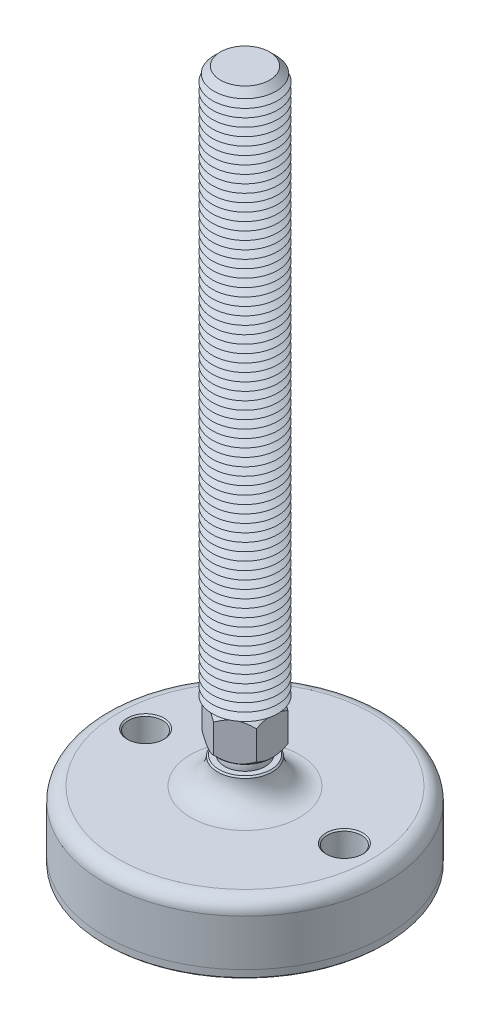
ISO-10303-21;
HEADER;
FILE_DESCRIPTION(('STEP AP214'),'2;1');
FILE_NAME('part.step','',(''),(''),'','','');
FILE_SCHEMA(('AUTOMOTIVE_DESIGN { 1 0 10303 214 1 1 1 1 }'));
ENDSEC;
DATA;
#1=APPLICATION_CONTEXT('core data for automotive mechanical design processes');
#2=APPLICATION_PROTOCOL_DEFINITION('international standard','automotive_design',2000,#1);
#3=PRODUCT_CONTEXT('',#1,'mechanical');
#4=PRODUCT('Part','Part','',(#3));
#5=PRODUCT_RELATED_PRODUCT_CATEGORY('part','',(#4));
#6=PRODUCT_DEFINITION_FORMATION('','',#4);
#7=PRODUCT_DEFINITION_CONTEXT('part definition',#1,'design');
#8=PRODUCT_DEFINITION('design','',#6,#7);
#9=PRODUCT_DEFINITION_SHAPE('','',#8);
#10=(LENGTH_UNIT() NAMED_UNIT(*) SI_UNIT(.MILLI.,.METRE.));
#11=(NAMED_UNIT(*) PLANE_ANGLE_UNIT() SI_UNIT($,.RADIAN.));
#12=(NAMED_UNIT(*) SI_UNIT($,.STERADIAN.) SOLID_ANGLE_UNIT());
#13=UNCERTAINTY_MEASURE_WITH_UNIT(LENGTH_MEASURE(1.E-05),#10,'distance_accuracy_value','');
#14=(GEOMETRIC_REPRESENTATION_CONTEXT(3) GLOBAL_UNCERTAINTY_ASSIGNED_CONTEXT((#13)) GLOBAL_UNIT_ASSIGNED_CONTEXT((#10,
#11,#12)) REPRESENTATION_CONTEXT('',''));
#15=CARTESIAN_POINT('',(0.,0.,0.));
#16=DIRECTION('',(0.,0.,1.));
#17=DIRECTION('',(1.,0.,0.));
#18=AXIS2_PLACEMENT_3D('',#15,#16,#17);
#19=CARTESIAN_POINT('',(0.,-32.,0.));
#20=DIRECTION('',(0.,1.,0.));
#21=DIRECTION('',(0.,0.,1.));
#22=AXIS2_PLACEMENT_3D('',#19,#20,#21);
#23=PLANE('',#22);
#24=CARTESIAN_POINT('',(-36.5,-32.,0.));
#25=DIRECTION('',(0.,1.,0.));
#26=DIRECTION('',(0.,0.,1.));
#27=AXIS2_PLACEMENT_3D('',#24,#25,#26);
#28=CIRCLE('',#27,6.25);
#29=CARTESIAN_POINT('',(-36.5,-32.,6.25));
#30=VERTEX_POINT('',#29);
#31=EDGE_CURVE('P0_E43',#30,#30,#28,.T.);
#32=ORIENTED_EDGE('',*,*,#31,.F.);
#33=EDGE_LOOP('',(#32));
#34=FACE_BOUND('',#33,.T.);
#35=CARTESIAN_POINT('',(36.5,-32.,0.));
#36=DIRECTION('',(0.,1.,0.));
#37=DIRECTION('',(0.,0.,1.));
#38=AXIS2_PLACEMENT_3D('',#35,#36,#37);
#39=CIRCLE('',#38,6.25);
#40=CARTESIAN_POINT('',(36.5,-32.,6.25));
#41=VERTEX_POINT('',#40);
#42=EDGE_CURVE('P0_E44',#41,#41,#39,.T.);
#43=ORIENTED_EDGE('',*,*,#42,.F.);
#44=EDGE_LOOP('',(#43));
#45=FACE_BOUND('',#44,.T.);
#46=CARTESIAN_POINT('',(0.,-32.,0.));
#47=DIRECTION('',(0.,1.,0.));
#48=DIRECTION('',(0.,0.,1.));
#49=AXIS2_PLACEMENT_3D('',#46,#47,#48);
#50=CIRCLE('',#49,51.5);
#51=CARTESIAN_POINT('',(0.,-32.,51.5));
#52=VERTEX_POINT('',#51);
#53=EDGE_CURVE('P0_E40',#52,#52,#50,.T.);
#54=ORIENTED_EDGE('',*,*,#53,.T.);
#55=EDGE_LOOP('',(#54));
#56=FACE_BOUND('',#55,.T.);
#57=ADVANCED_FACE('P0_F14',(#34,#45,#56),#23,.T.);
#58=CARTESIAN_POINT('',(0.,43.1654938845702,0.));
#59=DIRECTION('',(0.,1.,0.));
#60=DIRECTION('',(0.,0.,1.));
#61=AXIS2_PLACEMENT_3D('',#58,#59,#60);
#62=CYLINDRICAL_SURFACE('',#61,51.5);
#63=CARTESIAN_POINT('',(0.,-34.5,0.));
#64=DIRECTION('',(0.,-1.,0.));
#65=DIRECTION('',(0.,0.,-1.));
#66=AXIS2_PLACEMENT_3D('',#63,#64,#65);
#67=CIRCLE('',#66,51.5);
#68=CARTESIAN_POINT('',(0.,-34.5,-51.5));
#69=VERTEX_POINT('',#68);
#70=EDGE_CURVE('P0_E37',#69,#69,#67,.F.);
#71=ORIENTED_EDGE('',*,*,#70,.T.);
#72=EDGE_LOOP('',(#71));
#73=FACE_BOUND('',#72,.T.);
#74=ORIENTED_EDGE('',*,*,#53,.F.);
#75=EDGE_LOOP('',(#74));
#76=FACE_BOUND('',#75,.T.);
#77=ADVANCED_FACE('P0_F54',(#73,#76),#62,.T.);
#78=CARTESIAN_POINT('',(0.,-35.,51.5));
#79=DIRECTION('',(0.,-1.,0.));
#80=DIRECTION('',(0.,0.,-1.));
#81=AXIS2_PLACEMENT_3D('',#78,#79,#80);
#82=PLANE('',#81);
#83=CARTESIAN_POINT('',(36.5,-35.,0.));
#84=DIRECTION('',(0.,-1.,0.));
#85=DIRECTION('',(0.,0.,-1.));
#86=AXIS2_PLACEMENT_3D('',#83,#84,#85);
#87=CIRCLE('',#86,6.75000000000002);
#88=CARTESIAN_POINT('',(36.5,-35.,-6.75000000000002));
#89=VERTEX_POINT('',#88);
#90=EDGE_CURVE('P0_E25',#89,#89,#87,.F.);
#91=ORIENTED_EDGE('',*,*,#90,.T.);
#92=EDGE_LOOP('',(#91));
#93=FACE_BOUND('',#92,.T.);
#94=CARTESIAN_POINT('',(-36.5,-35.,0.));
#95=DIRECTION('',(0.,-1.,0.));
#96=DIRECTION('',(0.,0.,-1.));
#97=AXIS2_PLACEMENT_3D('',#94,#95,#96);
#98=CIRCLE('',#97,6.74999999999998);
#99=CARTESIAN_POINT('',(-36.5,-35.,-6.74999999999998));
#100=VERTEX_POINT('',#99);
#101=EDGE_CURVE('P0_E29',#100,#100,#98,.F.);
#102=ORIENTED_EDGE('',*,*,#101,.T.);
#103=EDGE_LOOP('',(#102));
#104=FACE_BOUND('',#103,.T.);
#105=CARTESIAN_POINT('',(0.,-35.,0.));
#106=DIRECTION('',(0.,-1.,0.));
#107=DIRECTION('',(0.,0.,-1.));
#108=AXIS2_PLACEMENT_3D('',#105,#106,#107);
#109=CIRCLE('',#108,51.);
#110=CARTESIAN_POINT('',(0.,-35.,-51.));
#111=VERTEX_POINT('',#110);
#112=EDGE_CURVE('P0_E34',#111,#111,#109,.T.);
#113=ORIENTED_EDGE('',*,*,#112,.T.);
#114=EDGE_LOOP('',(#113));
#115=FACE_BOUND('',#114,.T.);
#116=ADVANCED_FACE('P0_F61',(#93,#104,#115),#82,.T.);
#117=CARTESIAN_POINT('',(0.,-34.5,0.));
#118=DIRECTION('',(0.,1.,0.));
#119=DIRECTION('',(0.,0.,1.));
#120=AXIS2_PLACEMENT_3D('',#117,#118,#119);
#121=CONICAL_SURFACE('',#120,51.5,0.785398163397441);
#122=ORIENTED_EDGE('',*,*,#112,.F.);
#123=EDGE_LOOP('',(#122));
#124=FACE_BOUND('',#123,.T.);
#125=ORIENTED_EDGE('',*,*,#70,.F.);
#126=EDGE_LOOP('',(#125));
#127=FACE_BOUND('',#126,.T.);
#128=ADVANCED_FACE('P0_F68',(#124,#127),#121,.T.);
#129=CARTESIAN_POINT('',(36.5,-35.,0.));
#130=DIRECTION('',(0.,1.,0.));
#131=DIRECTION('',(0.,0.,1.));
#132=AXIS2_PLACEMENT_3D('',#129,#130,#131);
#133=CYLINDRICAL_SURFACE('',#132,6.25);
#134=CARTESIAN_POINT('',(36.5,-34.5,0.));
#135=DIRECTION('',(0.,-1.,0.));
#136=DIRECTION('',(0.,0.,-1.));
#137=AXIS2_PLACEMENT_3D('',#134,#135,#136);
#138=CIRCLE('',#137,6.25);
#139=CARTESIAN_POINT('',(36.5,-34.5,-6.25));
#140=VERTEX_POINT('',#139);
#141=EDGE_CURVE('P0_E21',#140,#140,#138,.T.);
#142=ORIENTED_EDGE('',*,*,#141,.T.);
#143=EDGE_LOOP('',(#142));
#144=FACE_BOUND('',#143,.T.);
#145=ORIENTED_EDGE('',*,*,#42,.T.);
#146=EDGE_LOOP('',(#145));
#147=FACE_BOUND('',#146,.T.);
#148=ADVANCED_FACE('P0_F74',(#144,#147),#133,.F.);
#149=CARTESIAN_POINT('',(-36.5,-35.,0.));
#150=DIRECTION('',(0.,1.,0.));
#151=DIRECTION('',(0.,0.,1.));
#152=AXIS2_PLACEMENT_3D('',#149,#150,#151);
#153=CYLINDRICAL_SURFACE('',#152,6.25);
#154=CARTESIAN_POINT('',(-36.5,-34.5,0.));
#155=DIRECTION('',(0.,-1.,0.));
#156=DIRECTION('',(0.,0.,-1.));
#157=AXIS2_PLACEMENT_3D('',#154,#155,#156);
#158=CIRCLE('',#157,6.25);
#159=CARTESIAN_POINT('',(-36.5,-34.5,-6.25));
#160=VERTEX_POINT('',#159);
#161=EDGE_CURVE('P0_E10',#160,#160,#158,.T.);
#162=ORIENTED_EDGE('',*,*,#161,.T.);
#163=EDGE_LOOP('',(#162));
#164=FACE_BOUND('',#163,.T.);
#165=ORIENTED_EDGE('',*,*,#31,.T.);
#166=EDGE_LOOP('',(#165));
#167=FACE_BOUND('',#166,.T.);
#168=ADVANCED_FACE('P0_F50',(#164,#167),#153,.F.);
#169=CARTESIAN_POINT('',(36.5,-35.,0.));
#170=DIRECTION('',(0.,-1.,0.));
#171=DIRECTION('',(0.,0.,-1.));
#172=AXIS2_PLACEMENT_3D('',#169,#170,#171);
#173=CONICAL_SURFACE('',#172,6.75000000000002,0.785398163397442);
#174=ORIENTED_EDGE('',*,*,#141,.F.);
#175=EDGE_LOOP('',(#174));
#176=FACE_BOUND('',#175,.T.);
#177=ORIENTED_EDGE('',*,*,#90,.F.);
#178=EDGE_LOOP('',(#177));
#179=FACE_BOUND('',#178,.T.);
#180=ADVANCED_FACE('P0_F76',(#176,#179),#173,.F.);
#181=CARTESIAN_POINT('',(-36.5,-35.,0.));
#182=DIRECTION('',(0.,-1.,0.));
#183=DIRECTION('',(0.,0.,-1.));
#184=AXIS2_PLACEMENT_3D('',#181,#182,#183);
#185=CONICAL_SURFACE('',#184,6.74999999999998,0.785398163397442);
#186=ORIENTED_EDGE('',*,*,#161,.F.);
#187=EDGE_LOOP('',(#186));
#188=FACE_BOUND('',#187,.T.);
#189=ORIENTED_EDGE('',*,*,#101,.F.);
#190=EDGE_LOOP('',(#189));
#191=FACE_BOUND('',#190,.T.);
#192=ADVANCED_FACE('P0_F16',(#188,#191),#185,.F.);
#193=CLOSED_SHELL('',(#57,#77,#116,#128,#148,#168,#180,#192));
#194=MANIFOLD_SOLID_BREP('P0_B1',#193);
#195=CARTESIAN_POINT('',(0.,3.75,0.));
#196=DIRECTION('',(0.,1.,0.));
#197=DIRECTION('',(0.,0.,1.));
#198=AXIS2_PLACEMENT_3D('',#195,#196,#197);
#199=PLANE('',#198);
#200=CARTESIAN_POINT('',(0.,3.75,0.));
#201=DIRECTION('',(0.,1.,0.));
#202=DIRECTION('',(0.,0.,1.));
#203=AXIS2_PLACEMENT_3D('',#200,#201,#202);
#204=CIRCLE('',#203,9.72829454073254);
#205=CARTESIAN_POINT('',(0.,3.75,9.72829454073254));
#206=VERTEX_POINT('',#205);
#207=EDGE_CURVE('P1_E213',#206,#206,#204,.T.);
#208=ORIENTED_EDGE('',*,*,#207,.F.);
#209=EDGE_LOOP('',(#208));
#210=FACE_BOUND('',#209,.T.);
#211=CARTESIAN_POINT('',(0.,3.75,0.));
#212=DIRECTION('',(0.,1.,0.));
#213=DIRECTION('',(0.,0.,1.));
#214=AXIS2_PLACEMENT_3D('',#211,#212,#213);
#215=CIRCLE('',#214,6.49519052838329);
#216=CARTESIAN_POINT('',(0.,3.75,6.49519052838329));
#217=VERTEX_POINT('',#216);
#218=EDGE_CURVE('P1_E25',#217,#217,#215,.F.);
#219=ORIENTED_EDGE('',*,*,#218,.F.);
#220=EDGE_LOOP('',(#219));
#221=FACE_BOUND('',#220,.T.);
#222=ADVANCED_FACE('P1_F16',(#210,#221),#199,.F.);
#223=CARTESIAN_POINT('',(0.,0.,0.));
#224=DIRECTION('',(0.,1.,0.));
#225=DIRECTION('',(0.,0.,-1.));
#226=AXIS2_PLACEMENT_3D('',#223,#224,#225);
#227=SPHERICAL_SURFACE('',#226,7.5);
#228=ORIENTED_EDGE('',*,*,#218,.T.);
#229=EDGE_LOOP('',(#228));
#230=FACE_BOUND('',#229,.T.);
#231=ADVANCED_FACE('P1_F203',(#230),#227,.T.);
#232=CARTESIAN_POINT('',(0.,3.75,0.));
#233=DIRECTION('',(0.,1.,0.));
#234=DIRECTION('',(0.,0.,1.));
#235=AXIS2_PLACEMENT_3D('',#232,#233,#234);
#236=CONICAL_SURFACE('',#235,9.72829454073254,0.785398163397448);
#237=ORIENTED_EDGE('',*,*,#207,.T.);
#238=EDGE_LOOP('',(#237));
#239=FACE_BOUND('',#238,.T.);
#240=CARTESIAN_POINT('',(-10.,9.59571642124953,-11.9394228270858));
#241=CARTESIAN_POINT('',(-10.,9.37430561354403,-11.6505452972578));
#242=CARTESIAN_POINT('',(-10.,9.15490936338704,-11.3600988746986));
#243=CARTESIAN_POINT('',(-10.,8.72106267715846,-10.7754314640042));
#244=CARTESIAN_POINT('',(-10.,8.50661343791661,-10.4812095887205));
#245=CARTESIAN_POINT('',(-10.,8.08205114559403,-9.88620330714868));
#246=CARTESIAN_POINT('',(-10.,7.87198437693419,-9.58538576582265));
#247=CARTESIAN_POINT('',(-10.,7.45926520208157,-8.97872312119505));
#248=CARTESIAN_POINT('',(-10.,7.25661228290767,-8.67287836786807));
#249=CARTESIAN_POINT('',(-10.,6.84809543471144,-8.03614350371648));
#250=CARTESIAN_POINT('',(-10.,6.64281401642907,-7.70487777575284));
#251=CARTESIAN_POINT('',(-10.,6.245142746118,-7.03457466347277));
#252=CARTESIAN_POINT('',(-10.,6.0527550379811,-6.69553599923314));
#253=CARTESIAN_POINT('',(-10.,5.68497951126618,-6.00961937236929));
#254=CARTESIAN_POINT('',(-10.,5.50954176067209,-5.66276839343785));
#255=CARTESIAN_POINT('',(-10.,5.17959635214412,-4.95932933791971));
#256=CARTESIAN_POINT('',(-10.,5.02507889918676,-4.60274591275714));
#257=CARTESIAN_POINT('',(-10.,4.75599518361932,-3.91353381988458));
#258=CARTESIAN_POINT('',(-10.,4.63902686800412,-3.58185263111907));
#259=CARTESIAN_POINT('',(-10.,4.43164927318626,-2.91013341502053));
#260=CARTESIAN_POINT('',(-10.,4.34124171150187,-2.57009484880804));
#261=CARTESIAN_POINT('',(-10.,4.19334931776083,-1.88955843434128));
#262=CARTESIAN_POINT('',(-10.,4.13527351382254,-1.54919119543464));
#263=CARTESIAN_POINT('',(-10.,4.05324021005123,-0.864347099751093));
#264=CARTESIAN_POINT('',(-10.,4.029275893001,-0.519871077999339));
#265=CARTESIAN_POINT('',(-10.,4.01745435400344,0.155191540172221));
#266=CARTESIAN_POINT('',(-10.,4.02812008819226,0.485752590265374));
#267=CARTESIAN_POINT('',(-10.,4.08160326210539,1.1442457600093));
#268=CARTESIAN_POINT('',(-10.,4.12442366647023,1.47217763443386));
#269=CARTESIAN_POINT('',(-10.,4.24054019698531,2.12859326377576));
#270=CARTESIAN_POINT('',(-10.,4.31437036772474,2.45698095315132));
#271=CARTESIAN_POINT('',(-10.,4.48844287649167,3.10654175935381));
#272=CARTESIAN_POINT('',(-10.,4.58868356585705,3.42771532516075));
#273=CARTESIAN_POINT('',(-10.,4.81839210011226,4.08271396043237));
#274=CARTESIAN_POINT('',(-10.,4.94932842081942,4.41601827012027));
#275=CARTESIAN_POINT('',(-10.,5.23140828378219,5.07403931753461));
#276=CARTESIAN_POINT('',(-10.,5.38256099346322,5.3987520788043));
#277=CARTESIAN_POINT('',(-10.,5.70148727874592,6.04113299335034));
#278=CARTESIAN_POINT('',(-10.,5.86931223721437,6.35877542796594));
#279=CARTESIAN_POINT('',(-10.,6.21788686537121,6.98677627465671));
#280=CARTESIAN_POINT('',(-10.,6.39863453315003,7.29713580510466));
#281=CARTESIAN_POINT('',(-10.,6.76133545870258,7.89633938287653));
#282=CARTESIAN_POINT('',(-10.,6.94278731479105,8.18548854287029));
#283=CARTESIAN_POINT('',(-10.,7.31339871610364,8.75881961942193));
#284=CARTESIAN_POINT('',(-10.,7.50255884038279,9.04300116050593));
#285=CARTESIAN_POINT('',(-10.,7.8856676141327,9.6047584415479));
#286=CARTESIAN_POINT('',(-10.,8.07956548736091,9.88236893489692));
#287=CARTESIAN_POINT('',(-10.,8.47254700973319,10.4337838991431));
#288=CARTESIAN_POINT('',(-10.,8.67162921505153,10.7075893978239));
#289=CARTESIAN_POINT('',(-10.,8.87283307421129,10.9797992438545));
#290=B_SPLINE_CURVE_WITH_KNOTS('',3,(#240,#241,#242,#243,#244,#245,#246,#247,#248,#249,#250,
#251,#252,#253,#254,#255,#256,#257,#258,#259,#260,#261,#262,#263,#264,#265,#266,#267,#268,#269,
#270,#271,#272,#273,#274,#275,#276,#277,#278,#279,#280,#281,#282,#283,#284,#285,#286,#287,#288,
#289),.UNSPECIFIED.,.F.,.F.,(4,2,2,2,2,2,2,2,2,2,2,2,2,2,2,2,2,2,2,2,2,2,2,2,4),(0.,
1.09192545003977,2.18411235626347,3.28473497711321,4.3852812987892,5.5541916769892,
6.72329593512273,7.88884387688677,9.05384420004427,10.1080362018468,11.1622963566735,
12.1965943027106,13.2306855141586,14.2212593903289,15.2119246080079,16.2203997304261,
17.2288119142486,18.3022883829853,19.3762532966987,20.4536373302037,21.5308548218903,
22.5548150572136,23.5788523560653,24.5946500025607,25.6101677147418),.UNSPECIFIED.);
#291=CARTESIAN_POINT('',(-10.,5.56871084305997,-5.77350269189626));
#292=VERTEX_POINT('',#291);
#293=CARTESIAN_POINT('',(-10.,5.56871084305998,5.77350269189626));
#294=VERTEX_POINT('',#293);
#295=EDGE_CURVE('P1_E187',#292,#294,#290,.T.);
#296=ORIENTED_EDGE('',*,*,#295,.F.);
#297=CARTESIAN_POINT('',(0.000199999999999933,5.56882631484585,-11.5471208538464));
#298=CARTESIAN_POINT('',(-0.171722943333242,5.4695807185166,-11.447861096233));
#299=CARTESIAN_POINT('',(-0.344992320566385,5.37336355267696,-11.3478239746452));
#300=CARTESIAN_POINT('',(-0.694433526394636,5.18794806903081,-11.1460740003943));
#301=CARTESIAN_POINT('',(-0.870606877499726,5.09875358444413,-11.0443602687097));
#302=CARTESIAN_POINT('',(-1.22689656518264,4.92796770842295,-10.8386563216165));
#303=CARTESIAN_POINT('',(-1.40702970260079,4.84642277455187,-10.7346564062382));
#304=CARTESIAN_POINT('',(-1.77025459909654,4.69270708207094,-10.52494841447));
#305=CARTESIAN_POINT('',(-1.95334590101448,4.62053489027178,-10.4192406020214));
#306=CARTESIAN_POINT('',(-2.31954331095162,4.4878482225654,-10.2078164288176));
#307=CARTESIAN_POINT('',(-2.50260441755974,4.42716910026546,-10.1021260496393));
#308=CARTESIAN_POINT('',(-2.87129282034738,4.31731511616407,-9.88926370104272));
#309=CARTESIAN_POINT('',(-3.05691983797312,4.26813901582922,-9.78209189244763));
#310=CARTESIAN_POINT('',(-3.42994608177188,4.1825291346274,-9.56672509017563));
#311=CARTESIAN_POINT('',(-3.61734032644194,4.14606667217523,-9.45853297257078));
#312=CARTESIAN_POINT('',(-3.99370204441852,4.08668528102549,-9.24124043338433));
#313=CARTESIAN_POINT('',(-4.1826692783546,4.06376432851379,-9.13214015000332));
#314=CARTESIAN_POINT('',(-4.64316633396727,4.0253323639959,-8.86627205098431));
#315=CARTESIAN_POINT('',(-4.91519388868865,4.01726744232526,-8.70921686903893));
#316=CARTESIAN_POINT('',(-5.45875701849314,4.03080424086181,-8.39539054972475));
#317=CARTESIAN_POINT('',(-5.7302923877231,4.05241636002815,-8.23861953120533));
#318=CARTESIAN_POINT('',(-6.27080349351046,4.12403157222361,-7.92655529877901));
#319=CARTESIAN_POINT('',(-6.53977602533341,4.17406641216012,-7.77126393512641));
#320=CARTESIAN_POINT('',(-7.07309796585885,4.29980733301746,-7.46335036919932));
#321=CARTESIAN_POINT('',(-7.33744772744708,4.3755114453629,-7.31072796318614));
#322=CARTESIAN_POINT('',(-7.80670351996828,4.53125365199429,-7.03980300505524));
#323=CARTESIAN_POINT('',(-8.01264886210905,4.60719488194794,-6.92090040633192));
#324=CARTESIAN_POINT('',(-8.42084280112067,4.77131434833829,-6.68522952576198));
#325=CARTESIAN_POINT('',(-8.62309128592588,4.85949295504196,-6.5684613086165));
#326=CARTESIAN_POINT('',(-9.02325448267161,5.04611070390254,-6.33742697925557));
#327=CARTESIAN_POINT('',(-9.22118057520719,5.1445175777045,-6.2231542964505));
#328=CARTESIAN_POINT('',(-9.61336795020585,5.35030005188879,-5.99672480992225));
#329=CARTESIAN_POINT('',(-9.80763139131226,5.45767015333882,-5.88456675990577));
#330=CARTESIAN_POINT('',(-10.0002,5.56882631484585,-5.77338722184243));
#331=B_SPLINE_CURVE_WITH_KNOTS('',3,(#297,#298,#299,#300,#301,#302,#303,#304,#305,#306,#307,
#308,#309,#310,#311,#312,#313,#314,#315,#316,#317,#318,#319,#320,#321,#322,#323,#324,#325,#326,
#327,#328,#329,#330),.UNSPECIFIED.,.F.,.F.,(4,2,2,2,2,2,2,2,2,2,2,2,2,2,2,2,4),(0.,
0.665863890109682,1.33208874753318,2.00212824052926,2.67206515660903,3.33152613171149,
3.99091606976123,4.64880867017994,5.30660292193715,6.24777541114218,7.18927777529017,
8.13183382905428,9.07431761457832,9.82287578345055,10.5714566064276,11.3177436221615,
12.0635761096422),.UNSPECIFIED.);
#332=CARTESIAN_POINT('',(0.,5.56871084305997,-11.5470053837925));
#333=VERTEX_POINT('',#332);
#334=EDGE_CURVE('P1_E181',#333,#292,#331,.T.);
#335=ORIENTED_EDGE('',*,*,#334,.F.);
#336=CARTESIAN_POINT('',(10.0002,5.56882631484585,-5.77338722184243));
#337=CARTESIAN_POINT('',(9.82827705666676,5.4695807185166,-5.87264697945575));
#338=CARTESIAN_POINT('',(9.65500767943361,5.37336355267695,-5.97268410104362));
#339=CARTESIAN_POINT('',(9.30556647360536,5.18794806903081,-6.17443407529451));
#340=CARTESIAN_POINT('',(9.12939312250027,5.09875358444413,-6.27614780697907));
#341=CARTESIAN_POINT('',(8.77310343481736,4.92796770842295,-6.48185175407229));
#342=CARTESIAN_POINT('',(8.59297029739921,4.84642277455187,-6.58585166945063));
#343=CARTESIAN_POINT('',(8.22974540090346,4.69270708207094,-6.79555966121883));
#344=CARTESIAN_POINT('',(8.04665409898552,4.62053489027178,-6.90126747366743));
#345=CARTESIAN_POINT('',(7.68045668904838,4.4878482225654,-7.11269164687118));
#346=CARTESIAN_POINT('',(7.49739558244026,4.42716910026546,-7.21838202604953));
#347=CARTESIAN_POINT('',(7.12870717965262,4.31731511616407,-7.43124437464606));
#348=CARTESIAN_POINT('',(6.94308016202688,4.26813901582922,-7.53841618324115));
#349=CARTESIAN_POINT('',(6.57005391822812,4.1825291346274,-7.75378298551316));
#350=CARTESIAN_POINT('',(6.38265967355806,4.14606667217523,-7.861975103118));
#351=CARTESIAN_POINT('',(6.00629795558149,4.08668528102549,-8.07926764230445));
#352=CARTESIAN_POINT('',(5.81733072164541,4.06376432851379,-8.18836792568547));
#353=CARTESIAN_POINT('',(5.35683366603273,4.0253323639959,-8.45423602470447));
#354=CARTESIAN_POINT('',(5.08480611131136,4.01726744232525,-8.61129120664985));
#355=CARTESIAN_POINT('',(4.54124298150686,4.03080424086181,-8.92511752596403));
#356=CARTESIAN_POINT('',(4.2697076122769,4.05241636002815,-9.08188854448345));
#357=CARTESIAN_POINT('',(3.72919650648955,4.12403157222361,-9.39395277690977));
#358=CARTESIAN_POINT('',(3.46022397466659,4.17406641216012,-9.54924414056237));
#359=CARTESIAN_POINT('',(2.92690203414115,4.29980733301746,-9.85715770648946));
#360=CARTESIAN_POINT('',(2.66255227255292,4.37551144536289,-10.0097801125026));
#361=CARTESIAN_POINT('',(2.19329648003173,4.53125365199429,-10.2807050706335));
#362=CARTESIAN_POINT('',(1.98735113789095,4.60719488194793,-10.3996076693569));
#363=CARTESIAN_POINT('',(1.57915719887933,4.77131434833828,-10.6352785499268));
#364=CARTESIAN_POINT('',(1.37690871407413,4.85949295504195,-10.7520467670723));
#365=CARTESIAN_POINT('',(0.976745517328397,5.04611070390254,-10.9830810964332));
#366=CARTESIAN_POINT('',(0.77881942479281,5.1445175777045,-11.0973537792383));
#367=CARTESIAN_POINT('',(0.386632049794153,5.35030005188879,-11.3237832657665));
#368=CARTESIAN_POINT('',(0.192368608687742,5.45767015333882,-11.435941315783));
#369=CARTESIAN_POINT('',(-0.000199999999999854,5.56882631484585,-11.5471208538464));
#370=B_SPLINE_CURVE_WITH_KNOTS('',3,(#336,#337,#338,#339,#340,#341,#342,#343,#344,#345,#346,
#347,#348,#349,#350,#351,#352,#353,#354,#355,#356,#357,#358,#359,#360,#361,#362,#363,#364,#365,
#366,#367,#368,#369),.UNSPECIFIED.,.F.,.F.,(4,2,2,2,2,2,2,2,2,2,2,2,2,2,2,2,4),(0.,
0.665863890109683,1.33208874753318,2.00212824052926,2.67206515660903,3.33152613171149,
3.99091606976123,4.64880867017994,5.30660292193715,6.24777541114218,7.18927777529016,
8.13183382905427,9.07431761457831,9.82287578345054,10.5714566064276,11.3177436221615,
12.0635761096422),.UNSPECIFIED.);
#371=CARTESIAN_POINT('',(9.99999999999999,5.56871084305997,-5.77350269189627));
#372=VERTEX_POINT('',#371);
#373=EDGE_CURVE('P1_E169',#372,#333,#370,.T.);
#374=ORIENTED_EDGE('',*,*,#373,.F.);
#375=CARTESIAN_POINT('',(10.,9.59571642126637,-11.9394228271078));
#376=CARTESIAN_POINT('',(10.,9.37430561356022,-11.6505452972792));
#377=CARTESIAN_POINT('',(10.,9.15490936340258,-11.3600988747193));
#378=CARTESIAN_POINT('',(10.,8.7210626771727,-10.7754314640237));
#379=CARTESIAN_POINT('',(10.,8.5066134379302,-10.4812095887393));
#380=CARTESIAN_POINT('',(10.,8.08205114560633,-9.88620330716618));
#381=CARTESIAN_POINT('',(10.,7.87198437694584,-9.58538576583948));
#382=CARTESIAN_POINT('',(10.,7.45926520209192,-8.97872312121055));
#383=CARTESIAN_POINT('',(10.,7.25661228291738,-8.67287836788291));
#384=CARTESIAN_POINT('',(10.,6.84809543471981,-8.03614350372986));
#385=CARTESIAN_POINT('',(10.,6.64281401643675,-7.70487777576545));
#386=CARTESIAN_POINT('',(10.,6.24514274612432,-7.03457466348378));
#387=CARTESIAN_POINT('',(10.,6.05275503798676,-6.69553599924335));
#388=CARTESIAN_POINT('',(10.,5.68497951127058,-6.00961937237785));
#389=CARTESIAN_POINT('',(10.,5.50954176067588,-5.66276839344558));
#390=CARTESIAN_POINT('',(10.,5.17959635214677,-4.95932933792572));
#391=CARTESIAN_POINT('',(10.,5.02507889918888,-4.60274591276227));
#392=CARTESIAN_POINT('',(10.,4.75599518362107,-3.91353381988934));
#393=CARTESIAN_POINT('',(10.,4.63902686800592,-3.58185263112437));
#394=CARTESIAN_POINT('',(10.,4.43164927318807,-2.91013341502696));
#395=CARTESIAN_POINT('',(10.,4.34124171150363,-2.57009484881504));
#396=CARTESIAN_POINT('',(10.,4.19334931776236,-1.8895584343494));
#397=CARTESIAN_POINT('',(10.,4.13527351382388,-1.54919119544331));
#398=CARTESIAN_POINT('',(10.,4.05324021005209,-0.86434709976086));
#399=CARTESIAN_POINT('',(10.,4.02927589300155,-0.519871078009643));
#400=CARTESIAN_POINT('',(10.,4.01745435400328,0.155191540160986));
#401=CARTESIAN_POINT('',(10.,4.0281200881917,0.485752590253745));
#402=CARTESIAN_POINT('',(10.,4.08160326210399,1.14424575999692));
#403=CARTESIAN_POINT('',(10.,4.12442366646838,1.47217763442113));
#404=CARTESIAN_POINT('',(10.,4.24054019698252,2.12859326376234));
#405=CARTESIAN_POINT('',(10.,4.31437036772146,2.45698095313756));
#406=CARTESIAN_POINT('',(10.,4.48844287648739,3.1065417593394));
#407=CARTESIAN_POINT('',(10.,4.58868356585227,3.42771532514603));
#408=CARTESIAN_POINT('',(10.,4.81839210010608,4.08271396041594));
#409=CARTESIAN_POINT('',(10.,4.94932842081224,4.41601827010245));
#410=CARTESIAN_POINT('',(10.,5.23140828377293,5.0740393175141));
#411=CARTESIAN_POINT('',(10.,5.38256099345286,5.39875207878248));
#412=CARTESIAN_POINT('',(10.,5.70148727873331,6.04113299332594));
#413=CARTESIAN_POINT('',(10.,5.86931223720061,6.35877542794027));
#414=CARTESIAN_POINT('',(10.,6.21788686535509,6.98677627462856));
#415=CARTESIAN_POINT('',(10.,6.39863453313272,7.29713580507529));
#416=CARTESIAN_POINT('',(10.,6.761335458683,7.89633938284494));
#417=CARTESIAN_POINT('',(10.,6.9427873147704,8.18548854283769));
#418=CARTESIAN_POINT('',(10.,7.31339871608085,8.75881961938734));
#419=CARTESIAN_POINT('',(10.,7.50255884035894,9.04300116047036));
#420=CARTESIAN_POINT('',(10.,7.88566761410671,9.60475844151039));
#421=CARTESIAN_POINT('',(10.,8.07956548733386,9.88236893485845));
#422=CARTESIAN_POINT('',(10.,8.47254700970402,10.4337838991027));
#423=CARTESIAN_POINT('',(10.,8.6716292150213,10.7075893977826));
#424=CARTESIAN_POINT('',(10.,8.87283307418,10.9797992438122));
#425=B_SPLINE_CURVE_WITH_KNOTS('',3,(#375,#376,#377,#378,#379,#380,#381,#382,#383,#384,#385,
#386,#387,#388,#389,#390,#391,#392,#393,#394,#395,#396,#397,#398,#399,#400,#401,#402,#403,#404,
#405,#406,#407,#408,#409,#410,#411,#412,#413,#414,#415,#416,#417,#418,#419,#420,#421,#422,#423,
#424),.UNSPECIFIED.,.F.,.F.,(4,2,2,2,2,2,2,2,2,2,2,2,2,2,2,2,2,2,2,2,2,2,2,2,4),(0.,
1.09192545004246,2.18411235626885,3.28473497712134,4.38528129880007,5.55419167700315,
6.72329593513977,7.88884387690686,9.05384420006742,10.1080362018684,11.1622963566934,
12.196594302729,13.2306855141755,14.2212593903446,15.2119246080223,16.2203997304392,
17.2288119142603,18.3022883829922,19.3762532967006,20.4536373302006,21.5308548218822,
22.5548150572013,23.5788523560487,24.5946500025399,25.6101677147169),.UNSPECIFIED.);
#426=CARTESIAN_POINT('',(10.,5.56871084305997,5.77350269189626));
#427=VERTEX_POINT('',#426);
#428=EDGE_CURVE('P1_E71',#427,#372,#425,.F.);
#429=ORIENTED_EDGE('',*,*,#428,.F.);
#430=CARTESIAN_POINT('',(-0.000200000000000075,5.56882631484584,11.5471208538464));
#431=CARTESIAN_POINT('',(0.171722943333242,5.4695807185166,11.447861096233));
#432=CARTESIAN_POINT('',(0.344992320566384,5.37336355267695,11.3478239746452));
#433=CARTESIAN_POINT('',(0.694433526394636,5.18794806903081,11.1460740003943));
#434=CARTESIAN_POINT('',(0.870606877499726,5.09875358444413,11.0443602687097));
#435=CARTESIAN_POINT('',(1.22689656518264,4.92796770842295,10.8386563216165));
#436=CARTESIAN_POINT('',(1.40702970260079,4.84642277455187,10.7346564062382));
#437=CARTESIAN_POINT('',(1.77025459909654,4.69270708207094,10.52494841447));
#438=CARTESIAN_POINT('',(1.95334590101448,4.62053489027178,10.4192406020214));
#439=CARTESIAN_POINT('',(2.31954331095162,4.4878482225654,10.2078164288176));
#440=CARTESIAN_POINT('',(2.50260441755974,4.42716910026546,10.1021260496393));
#441=CARTESIAN_POINT('',(2.87129282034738,4.31731511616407,9.88926370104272));
#442=CARTESIAN_POINT('',(3.05691983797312,4.26813901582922,9.78209189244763));
#443=CARTESIAN_POINT('',(3.42994608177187,4.18252913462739,9.56672509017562));
#444=CARTESIAN_POINT('',(3.61734032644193,4.14606667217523,9.45853297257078));
#445=CARTESIAN_POINT('',(3.99370204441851,4.08668528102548,9.24124043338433));
#446=CARTESIAN_POINT('',(4.18266927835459,4.06376432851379,9.13214015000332));
#447=CARTESIAN_POINT('',(4.64316633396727,4.0253323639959,8.86627205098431));
#448=CARTESIAN_POINT('',(4.91519388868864,4.01726744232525,8.70921686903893));
#449=CARTESIAN_POINT('',(5.45875701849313,4.03080424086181,8.39539054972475));
#450=CARTESIAN_POINT('',(5.7302923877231,4.05241636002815,8.23861953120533));
#451=CARTESIAN_POINT('',(6.27080349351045,4.1240315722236,7.92655529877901));
#452=CARTESIAN_POINT('',(6.53977602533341,4.17406641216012,7.77126393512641));
#453=CARTESIAN_POINT('',(7.07309796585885,4.29980733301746,7.46335036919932));
#454=CARTESIAN_POINT('',(7.33744772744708,4.37551144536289,7.31072796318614));
#455=CARTESIAN_POINT('',(7.80670351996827,4.53125365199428,7.03980300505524));
#456=CARTESIAN_POINT('',(8.01264886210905,4.60719488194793,6.92090040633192));
#457=CARTESIAN_POINT('',(8.42084280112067,4.77131434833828,6.68522952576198));
#458=CARTESIAN_POINT('',(8.62309128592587,4.85949295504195,6.5684613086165));
#459=CARTESIAN_POINT('',(9.0232544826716,5.04611070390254,6.33742697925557));
#460=CARTESIAN_POINT('',(9.22118057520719,5.1445175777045,6.2231542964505));
#461=CARTESIAN_POINT('',(9.61336795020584,5.35030005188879,5.99672480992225));
#462=CARTESIAN_POINT('',(9.80763139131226,5.45767015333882,5.88456675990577));
#463=CARTESIAN_POINT('',(10.0002,5.56882631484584,5.77338722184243));
#464=B_SPLINE_CURVE_WITH_KNOTS('',3,(#430,#431,#432,#433,#434,#435,#436,#437,#438,#439,#440,
#441,#442,#443,#444,#445,#446,#447,#448,#449,#450,#451,#452,#453,#454,#455,#456,#457,#458,#459,
#460,#461,#462,#463),.UNSPECIFIED.,.F.,.F.,(4,2,2,2,2,2,2,2,2,2,2,2,2,2,2,2,4),(0.,
0.665863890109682,1.33208874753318,2.00212824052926,2.67206515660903,3.33152613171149,
3.99091606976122,4.64880867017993,5.30660292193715,6.24777541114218,7.18927777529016,
8.13183382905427,9.07431761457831,9.82287578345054,10.5714566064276,11.3177436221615,
12.0635761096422),.UNSPECIFIED.);
#465=CARTESIAN_POINT('',(0.,5.56871084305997,11.5470053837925));
#466=VERTEX_POINT('',#465);
#467=EDGE_CURVE('P1_E68',#466,#427,#464,.T.);
#468=ORIENTED_EDGE('',*,*,#467,.F.);
#469=CARTESIAN_POINT('',(-10.0002,5.56882631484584,5.77338722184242));
#470=CARTESIAN_POINT('',(-9.82827705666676,5.4695807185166,5.87264697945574));
#471=CARTESIAN_POINT('',(-9.65500767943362,5.37336355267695,5.97268410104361));
#472=CARTESIAN_POINT('',(-9.30556647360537,5.18794806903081,6.1744340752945));
#473=CARTESIAN_POINT('',(-9.12939312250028,5.09875358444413,6.27614780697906));
#474=CARTESIAN_POINT('',(-8.77310343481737,4.92796770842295,6.48185175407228));
#475=CARTESIAN_POINT('',(-8.59297029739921,4.84642277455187,6.58585166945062));
#476=CARTESIAN_POINT('',(-8.22974540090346,4.69270708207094,6.79555966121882));
#477=CARTESIAN_POINT('',(-8.04665409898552,4.62053489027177,6.90126747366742));
#478=CARTESIAN_POINT('',(-7.68045668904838,4.48784822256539,7.11269164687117));
#479=CARTESIAN_POINT('',(-7.49739558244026,4.42716910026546,7.21838202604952));
#480=CARTESIAN_POINT('',(-7.12870717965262,4.31731511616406,7.43124437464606));
#481=CARTESIAN_POINT('',(-6.94308016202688,4.26813901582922,7.53841618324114));
#482=CARTESIAN_POINT('',(-6.57005391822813,4.18252913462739,7.75378298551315));
#483=CARTESIAN_POINT('',(-6.38265967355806,4.14606667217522,7.861975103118));
#484=CARTESIAN_POINT('',(-6.00629795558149,4.08668528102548,8.07926764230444));
#485=CARTESIAN_POINT('',(-5.81733072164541,4.06376432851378,8.18836792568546));
#486=CARTESIAN_POINT('',(-5.35683366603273,4.0253323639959,8.45423602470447));
#487=CARTESIAN_POINT('',(-5.08480611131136,4.01726744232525,8.61129120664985));
#488=CARTESIAN_POINT('',(-4.54124298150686,4.0308042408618,8.92511752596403));
#489=CARTESIAN_POINT('',(-4.2697076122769,4.05241636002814,9.08188854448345));
#490=CARTESIAN_POINT('',(-3.72919650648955,4.1240315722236,9.39395277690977));
#491=CARTESIAN_POINT('',(-3.46022397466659,4.17406641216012,9.54924414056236));
#492=CARTESIAN_POINT('',(-2.92690203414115,4.29980733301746,9.85715770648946));
#493=CARTESIAN_POINT('',(-2.66255227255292,4.37551144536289,10.0097801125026));
#494=CARTESIAN_POINT('',(-2.19329648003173,4.53125365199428,10.2807050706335));
#495=CARTESIAN_POINT('',(-1.98735113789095,4.60719488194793,10.3996076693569));
#496=CARTESIAN_POINT('',(-1.57915719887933,4.77131434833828,10.6352785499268));
#497=CARTESIAN_POINT('',(-1.37690871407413,4.85949295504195,10.7520467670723));
#498=CARTESIAN_POINT('',(-0.976745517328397,5.04611070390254,10.9830810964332));
#499=CARTESIAN_POINT('',(-0.778819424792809,5.1445175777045,11.0973537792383));
#500=CARTESIAN_POINT('',(-0.386632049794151,5.35030005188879,11.3237832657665));
#501=CARTESIAN_POINT('',(-0.192368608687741,5.45767015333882,11.435941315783));
#502=CARTESIAN_POINT('',(0.000199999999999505,5.56882631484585,11.5471208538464));
#503=B_SPLINE_CURVE_WITH_KNOTS('',3,(#469,#470,#471,#472,#473,#474,#475,#476,#477,#478,#479,
#480,#481,#482,#483,#484,#485,#486,#487,#488,#489,#490,#491,#492,#493,#494,#495,#496,#497,#498,
#499,#500,#501,#502),.UNSPECIFIED.,.F.,.F.,(4,2,2,2,2,2,2,2,2,2,2,2,2,2,2,2,4),(0.,
0.665863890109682,1.33208874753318,2.00212824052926,2.67206515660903,3.33152613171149,
3.99091606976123,4.64880867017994,5.30660292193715,6.24777541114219,7.18927777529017,
8.13183382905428,9.07431761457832,9.82287578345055,10.5714566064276,11.3177436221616,
12.0635761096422),.UNSPECIFIED.);
#504=EDGE_CURVE('P1_E40',#294,#466,#503,.T.);
#505=ORIENTED_EDGE('',*,*,#504,.F.);
#506=EDGE_LOOP('',(#296,#335,#374,#429,#468,#505));
#507=FACE_BOUND('',#506,.T.);
#508=ADVANCED_FACE('P1_F69',(#239,#507),#236,.T.);
#509=CARTESIAN_POINT('',(-10.,19.,-5.77350269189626));
#510=DIRECTION('',(1.,0.,0.));
#511=DIRECTION('',(0.,0.,-1.));
#512=AXIS2_PLACEMENT_3D('',#509,#510,#511);
#513=PLANE('',#512);
#514=DIRECTION('',(0.,-1.,0.));
#515=VECTOR('',#514,1.);
#516=CARTESIAN_POINT('',(-10.,19.,5.77350269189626));
#517=LINE('',#516,#515);
#518=CARTESIAN_POINT('',(-10.,16.1132486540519,5.77350269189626));
#519=VERTEX_POINT('',#518);
#520=EDGE_CURVE('P1_E84',#519,#294,#517,.T.);
#521=ORIENTED_EDGE('',*,*,#520,.F.);
#522=CARTESIAN_POINT('',(-10.,12.4093918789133,-11.5147208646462));
#523=CARTESIAN_POINT('',(-10.,12.6210295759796,-11.2343500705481));
#524=CARTESIAN_POINT('',(-10.,12.8306215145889,-10.9524094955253));
#525=CARTESIAN_POINT('',(-10.,13.2447979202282,-10.3847695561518));
#526=CARTESIAN_POINT('',(-10.,13.4493811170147,-10.0990692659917));
#527=CARTESIAN_POINT('',(-10.,13.8540786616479,-9.52120077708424));
#528=CARTESIAN_POINT('',(-10.,14.0541461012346,-9.22899961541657));
#529=CARTESIAN_POINT('',(-10.,14.4468132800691,-8.63963749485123));
#530=CARTESIAN_POINT('',(-10.,14.6394135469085,-8.34247688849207));
#531=CARTESIAN_POINT('',(-10.,15.0262335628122,-7.72525702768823));
#532=CARTESIAN_POINT('',(-10.,15.2199166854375,-7.40485974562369));
#533=CARTESIAN_POINT('',(-10.,15.5945399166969,-6.75658646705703));
#534=CARTESIAN_POINT('',(-10.,15.7754780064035,-6.4287092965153));
#535=CARTESIAN_POINT('',(-10.,16.1207071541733,-5.76550673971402));
#536=CARTESIAN_POINT('',(-10.,16.285047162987,-5.43020703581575));
#537=CARTESIAN_POINT('',(-10.,16.5934011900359,-4.75046311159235));
#538=CARTESIAN_POINT('',(-10.,16.7374244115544,-4.40602311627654));
#539=CARTESIAN_POINT('',(-10.,16.9894496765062,-3.73558113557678));
#540=CARTESIAN_POINT('',(-10.,17.0994177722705,-3.41032595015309));
#541=CARTESIAN_POINT('',(-10.,17.2932601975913,-2.75198473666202));
#542=CARTESIAN_POINT('',(-10.,17.377132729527,-2.4188981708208));
#543=CARTESIAN_POINT('',(-10.,17.5130086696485,-1.7524231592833));
#544=CARTESIAN_POINT('',(-10.,17.565558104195,-1.41914787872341));
#545=CARTESIAN_POINT('',(-10.,17.6377678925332,-0.749034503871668));
#546=CARTESIAN_POINT('',(-10.,17.6574338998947,-0.412197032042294));
#547=CARTESIAN_POINT('',(-10.,17.6624162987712,0.249527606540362));
#548=CARTESIAN_POINT('',(-10.,17.6489502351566,0.574406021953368));
#549=CARTESIAN_POINT('',(-10.,17.5910984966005,1.22138001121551));
#550=CARTESIAN_POINT('',(-10.,17.5467098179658,1.54347531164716));
#551=CARTESIAN_POINT('',(-10.,17.4286795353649,2.18799750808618));
#552=CARTESIAN_POINT('',(-10.,17.3545401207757,2.51033177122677));
#553=CARTESIAN_POINT('',(-10.,17.180962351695,3.14797698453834));
#554=CARTESIAN_POINT('',(-10.,17.0815261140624,3.46328851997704));
#555=CARTESIAN_POINT('',(-10.,16.8512186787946,4.11544298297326));
#556=CARTESIAN_POINT('',(-10.,16.7182795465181,4.45154819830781));
#557=CARTESIAN_POINT('',(-10.,16.431992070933,5.115028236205));
#558=CARTESIAN_POINT('',(-10.,16.2786342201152,5.4423989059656));
#559=CARTESIAN_POINT('',(-10.,15.9551580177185,6.09000973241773));
#560=CARTESIAN_POINT('',(-10.,15.7849870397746,6.41022338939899));
#561=CARTESIAN_POINT('',(-10.,15.4316458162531,7.04328175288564));
#562=CARTESIAN_POINT('',(-10.,15.2484776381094,7.35612762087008));
#563=CARTESIAN_POINT('',(-10.,14.8810750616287,7.96002022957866));
#564=CARTESIAN_POINT('',(-10.,14.6973474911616,8.25137695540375));
#565=CARTESIAN_POINT('',(-10.,14.3221662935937,8.82908851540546));
#566=CARTESIAN_POINT('',(-10.,14.1307120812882,9.1154429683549));
#567=CARTESIAN_POINT('',(-10.,13.7430400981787,9.68148259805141));
#568=CARTESIAN_POINT('',(-10.,13.5468736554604,9.96120305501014));
#569=CARTESIAN_POINT('',(-10.,13.149353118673,10.5168212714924));
#570=CARTESIAN_POINT('',(-10.,12.9480004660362,10.7927200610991));
#571=CARTESIAN_POINT('',(-10.,12.7445274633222,11.0670185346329));
#572=B_SPLINE_CURVE_WITH_KNOTS('',3,(#522,#523,#524,#525,#526,#527,#528,#529,#530,#531,#532,
#533,#534,#535,#536,#537,#538,#539,#540,#541,#542,#543,#544,#545,#546,#547,#548,#549,#550,#551,
#552,#553,#554,#555,#556,#557,#558,#559,#560,#561,#562,#563,#564,#565,#566,#567,#568,#569,#570,
#571),.UNSPECIFIED.,.F.,.F.,(4,2,2,2,2,2,2,2,2,2,2,2,2,2,2,2,2,2,2,2,2,2,2,2,4),(0.,
1.05386365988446,2.10799187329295,3.17028777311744,4.23250847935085,5.35544154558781,
6.47855209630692,7.5982472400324,8.71743353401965,9.74655549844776,10.7757483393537,
11.7864315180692,12.7969409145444,13.7708741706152,14.7449020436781,15.7359570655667,
16.7269291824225,17.8104078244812,18.8943927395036,19.981885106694,21.0692048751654,
22.1024062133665,23.1356859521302,24.1605722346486,25.1851766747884),.UNSPECIFIED.);
#573=CARTESIAN_POINT('',(-10.,16.1132486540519,-5.77350269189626));
#574=VERTEX_POINT('',#573);
#575=EDGE_CURVE('P1_E85',#519,#574,#572,.F.);
#576=ORIENTED_EDGE('',*,*,#575,.T.);
#577=DIRECTION('',(0.,-1.,0.));
#578=VECTOR('',#577,1.);
#579=CARTESIAN_POINT('',(-10.,19.,-5.77350269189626));
#580=LINE('',#579,#578);
#581=EDGE_CURVE('P1_E102',#574,#292,#580,.T.);
#582=ORIENTED_EDGE('',*,*,#581,.T.);
#583=ORIENTED_EDGE('',*,*,#295,.T.);
#584=EDGE_LOOP('',(#521,#576,#582,#583));
#585=FACE_BOUND('',#584,.T.);
#586=ADVANCED_FACE('P1_F195',(#585),#513,.F.);
#587=CARTESIAN_POINT('',(0.,19.,-11.5470053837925));
#588=DIRECTION('',(0.5,0.,0.866025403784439));
#589=DIRECTION('',(0.866025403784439,0.,-0.5));
#590=AXIS2_PLACEMENT_3D('',#587,#588,#589);
#591=PLANE('',#590);
#592=ORIENTED_EDGE('',*,*,#581,.F.);
#593=CARTESIAN_POINT('',(-10.0002,16.113133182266,-5.77338722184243));
#594=CARTESIAN_POINT('',(-9.82827705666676,16.2123787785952,-5.87264697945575));
#595=CARTESIAN_POINT('',(-9.65500767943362,16.3085959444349,-5.97268410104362));
#596=CARTESIAN_POINT('',(-9.30556647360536,16.494011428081,-6.17443407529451));
#597=CARTESIAN_POINT('',(-9.12939312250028,16.5832059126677,-6.27614780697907));
#598=CARTESIAN_POINT('',(-8.77310343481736,16.7539917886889,-6.48185175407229));
#599=CARTESIAN_POINT('',(-8.59297029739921,16.83553672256,-6.58585166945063));
#600=CARTESIAN_POINT('',(-8.22974540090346,16.9892524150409,-6.79555966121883));
#601=CARTESIAN_POINT('',(-8.04665409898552,17.0614246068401,-6.90126747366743));
#602=CARTESIAN_POINT('',(-7.68045668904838,17.1941112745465,-7.11269164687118));
#603=CARTESIAN_POINT('',(-7.49739558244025,17.2547903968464,-7.21838202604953));
#604=CARTESIAN_POINT('',(-7.12870717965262,17.3646443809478,-7.43124437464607));
#605=CARTESIAN_POINT('',(-6.94308016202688,17.4138204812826,-7.53841618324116));
#606=CARTESIAN_POINT('',(-6.57005391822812,17.4994303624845,-7.75378298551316));
#607=CARTESIAN_POINT('',(-6.38265967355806,17.5358928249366,-7.86197510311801));
#608=CARTESIAN_POINT('',(-6.00629795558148,17.5952742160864,-8.07926764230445));
#609=CARTESIAN_POINT('',(-5.8173307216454,17.6181951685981,-8.18836792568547));
#610=CARTESIAN_POINT('',(-5.35683366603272,17.6566271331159,-8.45423602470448));
#611=CARTESIAN_POINT('',(-5.08480611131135,17.6646920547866,-8.61129120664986));
#612=CARTESIAN_POINT('',(-4.54124298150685,17.65115525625,-8.92511752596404));
#613=CARTESIAN_POINT('',(-4.26970761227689,17.6295431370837,-9.08188854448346));
#614=CARTESIAN_POINT('',(-3.72919650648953,17.5579279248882,-9.39395277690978));
#615=CARTESIAN_POINT('',(-3.46022397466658,17.5078930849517,-9.54924414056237));
#616=CARTESIAN_POINT('',(-2.92690203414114,17.3821521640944,-9.85715770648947));
#617=CARTESIAN_POINT('',(-2.66255227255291,17.3064480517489,-10.0097801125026));
#618=CARTESIAN_POINT('',(-2.19329648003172,17.1507058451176,-10.2807050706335));
#619=CARTESIAN_POINT('',(-1.98735113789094,17.0747646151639,-10.3996076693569));
#620=CARTESIAN_POINT('',(-1.57915719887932,16.9106451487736,-10.6352785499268));
#621=CARTESIAN_POINT('',(-1.37690871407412,16.8224665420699,-10.7520467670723));
#622=CARTESIAN_POINT('',(-0.976745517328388,16.6358487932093,-10.9830810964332));
#623=CARTESIAN_POINT('',(-0.778819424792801,16.5374419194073,-11.0973537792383));
#624=CARTESIAN_POINT('',(-0.386632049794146,16.3316594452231,-11.3237832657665));
#625=CARTESIAN_POINT('',(-0.192368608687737,16.224289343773,-11.435941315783));
#626=CARTESIAN_POINT('',(0.000200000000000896,16.113133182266,-11.5471208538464));
#627=B_SPLINE_CURVE_WITH_KNOTS('',3,(#593,#594,#595,#596,#597,#598,#599,#600,#601,#602,#603,
#604,#605,#606,#607,#608,#609,#610,#611,#612,#613,#614,#615,#616,#617,#618,#619,#620,#621,#622,
#623,#624,#625,#626),.UNSPECIFIED.,.F.,.F.,(4,2,2,2,2,2,2,2,2,2,2,2,2,2,2,2,4),(0.,
0.665863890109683,1.33208874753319,2.00212824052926,2.67206515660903,3.3315261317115,
3.99091606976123,4.64880867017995,5.30660292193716,6.24777541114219,7.18927777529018,
8.13183382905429,9.07431761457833,9.82287578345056,10.5714566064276,11.3177436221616,
12.0635761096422),.UNSPECIFIED.);
#628=CARTESIAN_POINT('',(0.,16.1132486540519,-11.5470053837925));
#629=VERTEX_POINT('',#628);
#630=EDGE_CURVE('P1_E32',#574,#629,#627,.T.);
#631=ORIENTED_EDGE('',*,*,#630,.T.);
#632=DIRECTION('',(0.,-1.,0.));
#633=VECTOR('',#632,1.);
#634=CARTESIAN_POINT('',(0.,19.,-11.5470053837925));
#635=LINE('',#634,#633);
#636=EDGE_CURVE('P1_E99',#629,#333,#635,.T.);
#637=ORIENTED_EDGE('',*,*,#636,.T.);
#638=ORIENTED_EDGE('',*,*,#334,.T.);
#639=EDGE_LOOP('',(#592,#631,#637,#638));
#640=FACE_BOUND('',#639,.T.);
#641=ADVANCED_FACE('P1_F192',(#640),#591,.F.);
#642=CARTESIAN_POINT('',(10.,19.,-5.77350269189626));
#643=DIRECTION('',(-0.5,0.,0.866025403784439));
#644=DIRECTION('',(0.866025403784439,0.,0.5));
#645=AXIS2_PLACEMENT_3D('',#642,#643,#644);
#646=PLANE('',#645);
#647=ORIENTED_EDGE('',*,*,#636,.F.);
#648=CARTESIAN_POINT('',(-0.000199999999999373,16.113133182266,-11.5471208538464));
#649=CARTESIAN_POINT('',(0.171722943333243,16.2123787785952,-11.447861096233));
#650=CARTESIAN_POINT('',(0.344992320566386,16.3085959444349,-11.3478239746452));
#651=CARTESIAN_POINT('',(0.694433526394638,16.494011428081,-11.1460740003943));
#652=CARTESIAN_POINT('',(0.870606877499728,16.5832059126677,-11.0443602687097));
#653=CARTESIAN_POINT('',(1.22689656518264,16.7539917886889,-10.8386563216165));
#654=CARTESIAN_POINT('',(1.4070297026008,16.83553672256,-10.7346564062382));
#655=CARTESIAN_POINT('',(1.77025459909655,16.9892524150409,-10.52494841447));
#656=CARTESIAN_POINT('',(1.95334590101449,17.0614246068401,-10.4192406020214));
#657=CARTESIAN_POINT('',(2.31954331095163,17.1941112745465,-10.2078164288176));
#658=CARTESIAN_POINT('',(2.50260441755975,17.2547903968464,-10.1021260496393));
#659=CARTESIAN_POINT('',(2.87129282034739,17.3646443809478,-9.88926370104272));
#660=CARTESIAN_POINT('',(3.05691983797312,17.4138204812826,-9.78209189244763));
#661=CARTESIAN_POINT('',(3.42994608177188,17.4994303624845,-9.56672509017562));
#662=CARTESIAN_POINT('',(3.61734032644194,17.5358928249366,-9.45853297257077));
#663=CARTESIAN_POINT('',(3.99370204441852,17.5952742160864,-9.24124043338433));
#664=CARTESIAN_POINT('',(4.1826692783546,17.6181951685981,-9.13214015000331));
#665=CARTESIAN_POINT('',(4.64316633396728,17.6566271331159,-8.86627205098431));
#666=CARTESIAN_POINT('',(4.91519388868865,17.6646920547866,-8.70921686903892));
#667=CARTESIAN_POINT('',(5.45875701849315,17.65115525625,-8.39539054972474));
#668=CARTESIAN_POINT('',(5.73029238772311,17.6295431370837,-8.23861953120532));
#669=CARTESIAN_POINT('',(6.27080349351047,17.5579279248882,-7.92655529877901));
#670=CARTESIAN_POINT('',(6.53977602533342,17.5078930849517,-7.77126393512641));
#671=CARTESIAN_POINT('',(7.07309796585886,17.3821521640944,-7.46335036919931));
#672=CARTESIAN_POINT('',(7.33744772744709,17.3064480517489,-7.31072796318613));
#673=CARTESIAN_POINT('',(7.80670351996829,17.1507058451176,-7.03980300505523));
#674=CARTESIAN_POINT('',(8.01264886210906,17.0747646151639,-6.92090040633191));
#675=CARTESIAN_POINT('',(8.42084280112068,16.9106451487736,-6.68522952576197));
#676=CARTESIAN_POINT('',(8.62309128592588,16.8224665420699,-6.5684613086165));
#677=CARTESIAN_POINT('',(9.02325448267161,16.6358487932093,-6.33742697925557));
#678=CARTESIAN_POINT('',(9.2211805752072,16.5374419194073,-6.2231542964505));
#679=CARTESIAN_POINT('',(9.61336795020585,16.3316594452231,-5.99672480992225));
#680=CARTESIAN_POINT('',(9.80763139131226,16.224289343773,-5.88456675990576));
#681=CARTESIAN_POINT('',(10.0002,16.113133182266,-5.77338722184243));
#682=B_SPLINE_CURVE_WITH_KNOTS('',3,(#648,#649,#650,#651,#652,#653,#654,#655,#656,#657,#658,
#659,#660,#661,#662,#663,#664,#665,#666,#667,#668,#669,#670,#671,#672,#673,#674,#675,#676,#677,
#678,#679,#680,#681),.UNSPECIFIED.,.F.,.F.,(4,2,2,2,2,2,2,2,2,2,2,2,2,2,2,2,4),(0.,
0.665863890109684,1.33208874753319,2.00212824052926,2.67206515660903,3.3315261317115,
3.99091606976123,4.64880867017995,5.30660292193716,6.24777541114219,7.18927777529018,
8.13183382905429,9.07431761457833,9.82287578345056,10.5714566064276,11.3177436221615,
12.0635761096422),.UNSPECIFIED.);
#683=CARTESIAN_POINT('',(10.,16.1132486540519,-5.77350269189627));
#684=VERTEX_POINT('',#683);
#685=EDGE_CURVE('P1_E145',#629,#684,#682,.T.);
#686=ORIENTED_EDGE('',*,*,#685,.T.);
#687=DIRECTION('',(0.,-1.,0.));
#688=VECTOR('',#687,1.);
#689=CARTESIAN_POINT('',(10.,19.,-5.77350269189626));
#690=LINE('',#689,#688);
#691=EDGE_CURVE('P1_E94',#684,#372,#690,.T.);
#692=ORIENTED_EDGE('',*,*,#691,.T.);
#693=ORIENTED_EDGE('',*,*,#373,.T.);
#694=EDGE_LOOP('',(#647,#686,#692,#693));
#695=FACE_BOUND('',#694,.T.);
#696=ADVANCED_FACE('P1_F159',(#695),#646,.F.);
#697=CARTESIAN_POINT('',(10.,19.,5.77350269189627));
#698=DIRECTION('',(-1.,0.,0.));
#699=DIRECTION('',(0.,0.,1.));
#700=AXIS2_PLACEMENT_3D('',#697,#698,#699);
#701=PLANE('',#700);
#702=ORIENTED_EDGE('',*,*,#691,.F.);
#703=CARTESIAN_POINT('',(10.,12.4093918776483,-11.5147208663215));
#704=CARTESIAN_POINT('',(10.,12.6210295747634,-11.2343500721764));
#705=CARTESIAN_POINT('',(10.,12.8306215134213,-10.9524094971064));
#706=CARTESIAN_POINT('',(10.,13.2447979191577,-10.3847695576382));
#707=CARTESIAN_POINT('',(10.,13.4493811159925,-10.0990692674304));
#708=CARTESIAN_POINT('',(10.,13.8540786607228,-9.52120077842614));
#709=CARTESIAN_POINT('',(10.,14.0541461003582,-9.22899961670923));
#710=CARTESIAN_POINT('',(10.,14.4468132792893,-8.6396374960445));
#711=CARTESIAN_POINT('',(10.,14.6394135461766,-8.34247688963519));
#712=CARTESIAN_POINT('',(10.,15.02623356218,-7.72525702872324));
#713=CARTESIAN_POINT('',(10.,15.2199166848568,-7.40485974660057));
#714=CARTESIAN_POINT('',(10.,15.5945399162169,-6.75658646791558));
#715=CARTESIAN_POINT('',(10.,15.7754780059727,-6.42870929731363));
#716=CARTESIAN_POINT('',(10.,16.1207071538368,-5.76550674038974));
#717=CARTESIAN_POINT('',(10.,16.2850471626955,-5.4302070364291));
#718=CARTESIAN_POINT('',(10.,16.593401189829,-4.75046311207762));
#719=CARTESIAN_POINT('',(10.,16.7374244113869,-4.40602311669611));
#720=CARTESIAN_POINT('',(10.,16.9894496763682,-3.73558113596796));
#721=CARTESIAN_POINT('',(10.,17.09941777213,-3.41032595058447));
#722=CARTESIAN_POINT('',(10.,17.2932601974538,-2.75198473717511));
#723=CARTESIAN_POINT('',(10.,17.3771327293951,-2.4188981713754));
#724=CARTESIAN_POINT('',(10.,17.5130086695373,-1.75242315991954));
#725=CARTESIAN_POINT('',(10.,17.5655581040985,-1.41914787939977));
#726=CARTESIAN_POINT('',(10.,17.6377678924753,-0.749034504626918));
#727=CARTESIAN_POINT('',(10.,17.6574338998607,-0.41219703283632));
#728=CARTESIAN_POINT('',(10.,17.6624162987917,0.249527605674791));
#729=CARTESIAN_POINT('',(10.,17.6489502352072,0.574406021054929));
#730=CARTESIAN_POINT('',(10.,17.5910984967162,1.22138001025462));
#731=CARTESIAN_POINT('',(10.,17.5467098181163,1.5434753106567));
#732=CARTESIAN_POINT('',(10.,17.4286795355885,2.18799750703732));
#733=CARTESIAN_POINT('',(10.,17.3545401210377,2.51033177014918));
#734=CARTESIAN_POINT('',(10.,17.1809623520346,3.14797698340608));
#735=CARTESIAN_POINT('',(10.,17.0815261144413,3.46328851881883));
#736=CARTESIAN_POINT('',(10.,16.8512186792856,4.11544298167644));
#737=CARTESIAN_POINT('',(10.,16.7182795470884,4.45154819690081));
#738=CARTESIAN_POINT('',(10.,16.4319920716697,5.11502823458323));
#739=CARTESIAN_POINT('',(10.,16.2786342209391,5.44239890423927));
#740=CARTESIAN_POINT('',(10.,15.9551580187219,6.09000973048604));
#741=CARTESIAN_POINT('',(10.,15.7849870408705,6.41022338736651));
#742=CARTESIAN_POINT('',(10.,15.4316458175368,7.04328175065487));
#743=CARTESIAN_POINT('',(10.,15.2484776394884,7.35612761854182));
#744=CARTESIAN_POINT('',(10.,14.8810750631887,7.96002022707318));
#745=CARTESIAN_POINT('',(10.,14.6973474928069,8.25137695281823));
#746=CARTESIAN_POINT('',(10.,14.3221662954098,8.82908851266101));
#747=CARTESIAN_POINT('',(10.,14.13071208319,9.11544296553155));
#748=CARTESIAN_POINT('',(10.,13.7430401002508,9.68148259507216));
#749=CARTESIAN_POINT('',(10.,13.5468736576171,9.96120305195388));
#750=CARTESIAN_POINT('',(10.,13.149353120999,10.5168212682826));
#751=CARTESIAN_POINT('',(10.,12.9480004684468,10.7927200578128));
#752=CARTESIAN_POINT('',(10.,12.7445274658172,11.0670185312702));
#753=B_SPLINE_CURVE_WITH_KNOTS('',3,(#703,#704,#705,#706,#707,#708,#709,#710,#711,#712,#713,
#714,#715,#716,#717,#718,#719,#720,#721,#722,#723,#724,#725,#726,#727,#728,#729,#730,#731,#732,
#733,#734,#735,#736,#737,#738,#739,#740,#741,#742,#743,#744,#745,#746,#747,#748,#749,#750,#751,
#752),.UNSPECIFIED.,.F.,.F.,(4,2,2,2,2,2,2,2,2,2,2,2,2,2,2,2,2,2,2,2,2,2,2,2,4),(0.,
1.05386366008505,2.10799187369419,3.17028777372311,4.23250848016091,5.35544154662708,
6.47855209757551,7.59824724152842,8.71743353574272,9.74655550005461,10.7757483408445,
11.7864315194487,12.7969409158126,13.7708741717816,14.7449020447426,15.7359570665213,
16.7269291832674,17.8104078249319,18.8943927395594,19.9818851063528,21.0692048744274,
22.1024062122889,23.135685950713,24.1605722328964,25.1851766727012),.UNSPECIFIED.);
#754=CARTESIAN_POINT('',(10.,16.1132486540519,5.77350269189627));
#755=VERTEX_POINT('',#754);
#756=EDGE_CURVE('P1_E150',#684,#755,#753,.T.);
#757=ORIENTED_EDGE('',*,*,#756,.T.);
#758=DIRECTION('',(0.,-1.,0.));
#759=VECTOR('',#758,1.);
#760=CARTESIAN_POINT('',(10.,19.,5.77350269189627));
#761=LINE('',#760,#759);
#762=EDGE_CURVE('P1_E90',#755,#427,#761,.T.);
#763=ORIENTED_EDGE('',*,*,#762,.T.);
#764=ORIENTED_EDGE('',*,*,#428,.T.);
#765=EDGE_LOOP('',(#702,#757,#763,#764));
#766=FACE_BOUND('',#765,.T.);
#767=ADVANCED_FACE('P1_F156',(#766),#701,.F.);
#768=CARTESIAN_POINT('',(0.,19.,11.5470053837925));
#769=DIRECTION('',(-0.5,0.,-0.866025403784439));
#770=DIRECTION('',(-0.866025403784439,0.,0.5));
#771=AXIS2_PLACEMENT_3D('',#768,#769,#770);
#772=PLANE('',#771);
#773=ORIENTED_EDGE('',*,*,#762,.F.);
#774=CARTESIAN_POINT('',(10.0002,16.113133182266,5.77338722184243));
#775=CARTESIAN_POINT('',(9.82827705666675,16.2123787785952,5.87264697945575));
#776=CARTESIAN_POINT('',(9.65500767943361,16.3085959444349,5.97268410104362));
#777=CARTESIAN_POINT('',(9.30556647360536,16.494011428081,6.17443407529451));
#778=CARTESIAN_POINT('',(9.12939312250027,16.5832059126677,6.27614780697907));
#779=CARTESIAN_POINT('',(8.77310343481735,16.7539917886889,6.48185175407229));
#780=CARTESIAN_POINT('',(8.5929702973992,16.83553672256,6.58585166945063));
#781=CARTESIAN_POINT('',(8.22974540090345,16.9892524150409,6.79555966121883));
#782=CARTESIAN_POINT('',(8.04665409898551,17.0614246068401,6.90126747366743));
#783=CARTESIAN_POINT('',(7.68045668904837,17.1941112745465,7.11269164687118));
#784=CARTESIAN_POINT('',(7.49739558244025,17.2547903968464,7.21838202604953));
#785=CARTESIAN_POINT('',(7.12870717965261,17.3646443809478,7.43124437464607));
#786=CARTESIAN_POINT('',(6.94308016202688,17.4138204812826,7.53841618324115));
#787=CARTESIAN_POINT('',(6.57005391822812,17.4994303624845,7.75378298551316));
#788=CARTESIAN_POINT('',(6.38265967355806,17.5358928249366,7.86197510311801));
#789=CARTESIAN_POINT('',(6.00629795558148,17.5952742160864,8.07926764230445));
#790=CARTESIAN_POINT('',(5.8173307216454,17.6181951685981,8.18836792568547));
#791=CARTESIAN_POINT('',(5.35683366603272,17.6566271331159,8.45423602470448));
#792=CARTESIAN_POINT('',(5.08480611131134,17.6646920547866,8.61129120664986));
#793=CARTESIAN_POINT('',(4.54124298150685,17.65115525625,8.92511752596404));
#794=CARTESIAN_POINT('',(4.26970761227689,17.6295431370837,9.08188854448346));
#795=CARTESIAN_POINT('',(3.72919650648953,17.5579279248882,9.39395277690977));
#796=CARTESIAN_POINT('',(3.46022397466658,17.5078930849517,9.54924414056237));
#797=CARTESIAN_POINT('',(2.92690203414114,17.3821521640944,9.85715770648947));
#798=CARTESIAN_POINT('',(2.66255227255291,17.3064480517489,10.0097801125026));
#799=CARTESIAN_POINT('',(2.19329648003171,17.1507058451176,10.2807050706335));
#800=CARTESIAN_POINT('',(1.98735113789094,17.0747646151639,10.3996076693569));
#801=CARTESIAN_POINT('',(1.57915719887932,16.9106451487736,10.6352785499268));
#802=CARTESIAN_POINT('',(1.37690871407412,16.8224665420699,10.7520467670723));
#803=CARTESIAN_POINT('',(0.976745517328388,16.6358487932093,10.9830810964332));
#804=CARTESIAN_POINT('',(0.778819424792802,16.5374419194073,11.0973537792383));
#805=CARTESIAN_POINT('',(0.386632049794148,16.3316594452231,11.3237832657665));
#806=CARTESIAN_POINT('',(0.192368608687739,16.224289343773,11.435941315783));
#807=CARTESIAN_POINT('',(-0.000200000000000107,16.113133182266,11.5471208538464));
#808=B_SPLINE_CURVE_WITH_KNOTS('',3,(#774,#775,#776,#777,#778,#779,#780,#781,#782,#783,#784,
#785,#786,#787,#788,#789,#790,#791,#792,#793,#794,#795,#796,#797,#798,#799,#800,#801,#802,#803,
#804,#805,#806,#807),.UNSPECIFIED.,.F.,.F.,(4,2,2,2,2,2,2,2,2,2,2,2,2,2,2,2,4),(0.,
0.665863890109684,1.33208874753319,2.00212824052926,2.67206515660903,3.33152613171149,
3.99091606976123,4.64880867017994,5.30660292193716,6.24777541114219,7.18927777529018,
8.13183382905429,9.07431761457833,9.82287578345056,10.5714566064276,11.3177436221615,
12.0635761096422),.UNSPECIFIED.);
#809=CARTESIAN_POINT('',(0.,16.1132486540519,11.5470053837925));
#810=VERTEX_POINT('',#809);
#811=EDGE_CURVE('P1_E89',#755,#810,#808,.T.);
#812=ORIENTED_EDGE('',*,*,#811,.T.);
#813=DIRECTION('',(0.,-1.,0.));
#814=VECTOR('',#813,1.);
#815=CARTESIAN_POINT('',(0.,19.,11.5470053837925));
#816=LINE('',#815,#814);
#817=EDGE_CURVE('P1_E82',#810,#466,#816,.T.);
#818=ORIENTED_EDGE('',*,*,#817,.T.);
#819=ORIENTED_EDGE('',*,*,#467,.T.);
#820=EDGE_LOOP('',(#773,#812,#818,#819));
#821=FACE_BOUND('',#820,.T.);
#822=ADVANCED_FACE('P1_F88',(#821),#772,.F.);
#823=CARTESIAN_POINT('',(-10.,19.,5.77350269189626));
#824=DIRECTION('',(0.5,0.,-0.866025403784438));
#825=DIRECTION('',(-0.866025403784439,0.,-0.5));
#826=AXIS2_PLACEMENT_3D('',#823,#824,#825);
#827=PLANE('',#826);
#828=ORIENTED_EDGE('',*,*,#817,.F.);
#829=CARTESIAN_POINT('',(0.000200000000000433,16.113133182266,11.5471208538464));
#830=CARTESIAN_POINT('',(-0.171722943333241,16.2123787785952,11.447861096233));
#831=CARTESIAN_POINT('',(-0.344992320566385,16.3085959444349,11.3478239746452));
#832=CARTESIAN_POINT('',(-0.694433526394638,16.494011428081,11.1460740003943));
#833=CARTESIAN_POINT('',(-0.870606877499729,16.5832059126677,11.0443602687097));
#834=CARTESIAN_POINT('',(-1.22689656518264,16.7539917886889,10.8386563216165));
#835=CARTESIAN_POINT('',(-1.4070297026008,16.83553672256,10.7346564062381));
#836=CARTESIAN_POINT('',(-1.77025459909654,16.9892524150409,10.52494841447));
#837=CARTESIAN_POINT('',(-1.95334590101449,17.0614246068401,10.4192406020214));
#838=CARTESIAN_POINT('',(-2.31954331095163,17.1941112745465,10.2078164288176));
#839=CARTESIAN_POINT('',(-2.50260441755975,17.2547903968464,10.1021260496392));
#840=CARTESIAN_POINT('',(-2.87129282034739,17.3646443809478,9.88926370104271));
#841=CARTESIAN_POINT('',(-3.05691983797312,17.4138204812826,9.78209189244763));
#842=CARTESIAN_POINT('',(-3.42994608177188,17.4994303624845,9.56672509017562));
#843=CARTESIAN_POINT('',(-3.61734032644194,17.5358928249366,9.45853297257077));
#844=CARTESIAN_POINT('',(-3.99370204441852,17.5952742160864,9.24124043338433));
#845=CARTESIAN_POINT('',(-4.1826692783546,17.6181951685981,9.13214015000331));
#846=CARTESIAN_POINT('',(-4.64316633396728,17.6566271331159,8.8662720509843));
#847=CARTESIAN_POINT('',(-4.91519388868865,17.6646920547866,8.70921686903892));
#848=CARTESIAN_POINT('',(-5.45875701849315,17.65115525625,8.39539054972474));
#849=CARTESIAN_POINT('',(-5.73029238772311,17.6295431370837,8.23861953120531));
#850=CARTESIAN_POINT('',(-6.27080349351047,17.5579279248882,7.926555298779));
#851=CARTESIAN_POINT('',(-6.53977602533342,17.5078930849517,7.7712639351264));
#852=CARTESIAN_POINT('',(-7.07309796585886,17.3821521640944,7.46335036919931));
#853=CARTESIAN_POINT('',(-7.33744772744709,17.306448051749,7.31072796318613));
#854=CARTESIAN_POINT('',(-7.80670351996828,17.1507058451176,7.03980300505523));
#855=CARTESIAN_POINT('',(-8.01264886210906,17.0747646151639,6.9209004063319));
#856=CARTESIAN_POINT('',(-8.42084280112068,16.9106451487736,6.68522952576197));
#857=CARTESIAN_POINT('',(-8.62309128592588,16.8224665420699,6.56846130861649));
#858=CARTESIAN_POINT('',(-9.02325448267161,16.6358487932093,6.33742697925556));
#859=CARTESIAN_POINT('',(-9.2211805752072,16.5374419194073,6.22315429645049));
#860=CARTESIAN_POINT('',(-9.61336795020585,16.3316594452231,5.99672480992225));
#861=CARTESIAN_POINT('',(-9.80763139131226,16.224289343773,5.88456675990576));
#862=CARTESIAN_POINT('',(-10.0002,16.113133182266,5.77338722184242));
#863=B_SPLINE_CURVE_WITH_KNOTS('',3,(#829,#830,#831,#832,#833,#834,#835,#836,#837,#838,#839,
#840,#841,#842,#843,#844,#845,#846,#847,#848,#849,#850,#851,#852,#853,#854,#855,#856,#857,#858,
#859,#860,#861,#862),.UNSPECIFIED.,.F.,.F.,(4,2,2,2,2,2,2,2,2,2,2,2,2,2,2,2,4),(0.,
0.665863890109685,1.33208874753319,2.00212824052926,2.67206515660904,3.3315261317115,
3.99091606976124,4.64880867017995,5.30660292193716,6.24777541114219,7.18927777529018,
8.13183382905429,9.07431761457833,9.82287578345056,10.5714566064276,11.3177436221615,
12.0635761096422),.UNSPECIFIED.);
#864=EDGE_CURVE('P1_E106',#810,#519,#863,.T.);
#865=ORIENTED_EDGE('',*,*,#864,.T.);
#866=ORIENTED_EDGE('',*,*,#520,.T.);
#867=ORIENTED_EDGE('',*,*,#504,.T.);
#868=EDGE_LOOP('',(#828,#865,#866,#867));
#869=FACE_BOUND('',#868,.T.);
#870=ADVANCED_FACE('P1_F80',(#869),#827,.F.);
#871=CARTESIAN_POINT('',(0.,16.1132486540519,0.));
#872=DIRECTION('',(0.,-1.,0.));
#873=DIRECTION('',(0.,0.,-1.));
#874=AXIS2_PLACEMENT_3D('',#871,#872,#873);
#875=CONICAL_SURFACE('',#874,11.5470053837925,0.785398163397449);
#876=CARTESIAN_POINT('',(0.,19.,0.));
#877=DIRECTION('',(0.,1.,0.));
#878=DIRECTION('',(0.,0.,1.));
#879=AXIS2_PLACEMENT_3D('',#876,#877,#878);
#880=CIRCLE('',#879,8.66025403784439);
#881=CARTESIAN_POINT('',(0.,19.,8.66025403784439));
#882=VERTEX_POINT('',#881);
#883=EDGE_CURVE('P1_E216',#882,#882,#880,.T.);
#884=ORIENTED_EDGE('',*,*,#883,.F.);
#885=EDGE_LOOP('',(#884));
#886=FACE_BOUND('',#885,.T.);
#887=ORIENTED_EDGE('',*,*,#811,.F.);
#888=ORIENTED_EDGE('',*,*,#756,.F.);
#889=ORIENTED_EDGE('',*,*,#685,.F.);
#890=ORIENTED_EDGE('',*,*,#630,.F.);
#891=ORIENTED_EDGE('',*,*,#575,.F.);
#892=ORIENTED_EDGE('',*,*,#864,.F.);
#893=EDGE_LOOP('',(#887,#888,#889,#890,#891,#892));
#894=FACE_BOUND('',#893,.T.);
#895=ADVANCED_FACE('P1_F119',(#886,#894),#875,.T.);
#896=CARTESIAN_POINT('',(0.,19.,0.));
#897=DIRECTION('',(0.,1.,0.));
#898=DIRECTION('',(0.,0.,1.));
#899=AXIS2_PLACEMENT_3D('',#896,#897,#898);
#900=PLANE('',#899);
#901=ORIENTED_EDGE('',*,*,#883,.T.);
#902=EDGE_LOOP('',(#901));
#903=FACE_BOUND('',#902,.T.);
#904=CARTESIAN_POINT('',(0.,19.,0.));
#905=DIRECTION('',(0.,1.,0.));
#906=DIRECTION('',(0.,0.,1.));
#907=AXIS2_PLACEMENT_3D('',#904,#905,#906);
#908=CIRCLE('',#907,12.);
#909=CARTESIAN_POINT('',(0.,19.,12.));
#910=VERTEX_POINT('',#909);
#911=EDGE_CURVE('P1_E217',#910,#910,#908,.T.);
#912=ORIENTED_EDGE('',*,*,#911,.F.);
#913=EDGE_LOOP('',(#912));
#914=FACE_BOUND('',#913,.T.);
#915=ADVANCED_FACE('P1_F124',(#903,#914),#900,.F.);
#916=CARTESIAN_POINT('',(0.,19.,0.));
#917=DIRECTION('',(0.,-1.,0.));
#918=DIRECTION('',(0.,0.,-1.));
#919=AXIS2_PLACEMENT_3D('',#916,#917,#918);
#920=CONICAL_SURFACE('',#919,12.,1.0471975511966);
#921=CARTESIAN_POINT('',(0.,20.5,0.));
#922=DIRECTION('',(0.,1.,0.));
#923=DIRECTION('',(0.,0.,1.));
#924=AXIS2_PLACEMENT_3D('',#921,#922,#923);
#925=CIRCLE('',#924,9.40192378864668);
#926=CARTESIAN_POINT('',(0.,20.5,9.40192378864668));
#927=VERTEX_POINT('',#926);
#928=EDGE_CURVE('P1_E221',#927,#927,#925,.T.);
#929=ORIENTED_EDGE('',*,*,#928,.F.);
#930=EDGE_LOOP('',(#929));
#931=FACE_BOUND('',#930,.T.);
#932=ORIENTED_EDGE('',*,*,#911,.T.);
#933=EDGE_LOOP('',(#932));
#934=FACE_BOUND('',#933,.T.);
#935=ADVANCED_FACE('P1_F1396',(#931,#934),#920,.T.);
#936=CARTESIAN_POINT('',(0.,20.5,0.));
#937=DIRECTION('',(0.,1.,0.));
#938=DIRECTION('',(0.,0.,1.));
#939=AXIS2_PLACEMENT_3D('',#936,#937,#938);
#940=CONICAL_SURFACE('',#939,9.40192378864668,1.0471975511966);
#941=CARTESIAN_POINT('',(0.,22.,0.));
#942=DIRECTION('',(0.,1.,0.));
#943=DIRECTION('',(0.,0.,1.));
#944=AXIS2_PLACEMENT_3D('',#941,#942,#943);
#945=CIRCLE('',#944,12.);
#946=CARTESIAN_POINT('',(0.,22.,12.));
#947=VERTEX_POINT('',#946);
#948=EDGE_CURVE('P1_E226',#947,#947,#945,.T.);
#949=ORIENTED_EDGE('',*,*,#948,.F.);
#950=EDGE_LOOP('',(#949));
#951=FACE_BOUND('',#950,.T.);
#952=ORIENTED_EDGE('',*,*,#928,.T.);
#953=EDGE_LOOP('',(#952));
#954=FACE_BOUND('',#953,.T.);
#955=ADVANCED_FACE('P1_F1390',(#951,#954),#940,.T.);
#956=CARTESIAN_POINT('',(0.,22.,0.));
#957=DIRECTION('',(0.,-1.,0.));
#958=DIRECTION('',(0.,0.,-1.));
#959=AXIS2_PLACEMENT_3D('',#956,#957,#958);
#960=CONICAL_SURFACE('',#959,12.,1.0471975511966);
#961=CARTESIAN_POINT('',(0.,23.5,0.));
#962=DIRECTION('',(0.,1.,0.));
#963=DIRECTION('',(0.,0.,1.));
#964=AXIS2_PLACEMENT_3D('',#961,#962,#963);
#965=CIRCLE('',#964,9.40192378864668);
#966=CARTESIAN_POINT('',(0.,23.5,9.40192378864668));
#967=VERTEX_POINT('',#966);
#968=EDGE_CURVE('P1_E229',#967,#967,#965,.T.);
#969=ORIENTED_EDGE('',*,*,#968,.F.);
#970=EDGE_LOOP('',(#969));
#971=FACE_BOUND('',#970,.T.);
#972=ORIENTED_EDGE('',*,*,#948,.T.);
#973=EDGE_LOOP('',(#972));
#974=FACE_BOUND('',#973,.T.);
#975=ADVANCED_FACE('P1_F1384',(#971,#974),#960,.T.);
#976=CARTESIAN_POINT('',(0.,23.5,0.));
#977=DIRECTION('',(0.,1.,0.));
#978=DIRECTION('',(0.,0.,1.));
#979=AXIS2_PLACEMENT_3D('',#976,#977,#978);
#980=CONICAL_SURFACE('',#979,9.40192378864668,1.0471975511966);
#981=CARTESIAN_POINT('',(0.,25.,0.));
#982=DIRECTION('',(0.,1.,0.));
#983=DIRECTION('',(0.,0.,1.));
#984=AXIS2_PLACEMENT_3D('',#981,#982,#983);
#985=CIRCLE('',#984,12.);
#986=CARTESIAN_POINT('',(0.,25.,12.));
#987=VERTEX_POINT('',#986);
#988=EDGE_CURVE('P1_E232',#987,#987,#985,.T.);
#989=ORIENTED_EDGE('',*,*,#988,.F.);
#990=EDGE_LOOP('',(#989));
#991=FACE_BOUND('',#990,.T.);
#992=ORIENTED_EDGE('',*,*,#968,.T.);
#993=EDGE_LOOP('',(#992));
#994=FACE_BOUND('',#993,.T.);
#995=ADVANCED_FACE('P1_F1378',(#991,#994),#980,.T.);
#996=CARTESIAN_POINT('',(0.,25.,0.));
#997=DIRECTION('',(0.,-1.,0.));
#998=DIRECTION('',(0.,0.,-1.));
#999=AXIS2_PLACEMENT_3D('',#996,#997,#998);
#1000=CONICAL_SURFACE('',#999,12.,1.0471975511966);
#1001=CARTESIAN_POINT('',(0.,26.5,0.));
#1002=DIRECTION('',(0.,1.,0.));
#1003=DIRECTION('',(0.,0.,1.));
#1004=AXIS2_PLACEMENT_3D('',#1001,#1002,#1003);
#1005=CIRCLE('',#1004,9.40192378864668);
#1006=CARTESIAN_POINT('',(0.,26.5,9.40192378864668));
#1007=VERTEX_POINT('',#1006);
#1008=EDGE_CURVE('P1_E235',#1007,#1007,#1005,.T.);
#1009=ORIENTED_EDGE('',*,*,#1008,.F.);
#1010=EDGE_LOOP('',(#1009));
#1011=FACE_BOUND('',#1010,.T.);
#1012=ORIENTED_EDGE('',*,*,#988,.T.);
#1013=EDGE_LOOP('',(#1012));
#1014=FACE_BOUND('',#1013,.T.);
#1015=ADVANCED_FACE('P1_F1372',(#1011,#1014),#1000,.T.);
#1016=CARTESIAN_POINT('',(0.,26.5,0.));
#1017=DIRECTION('',(0.,1.,0.));
#1018=DIRECTION('',(0.,0.,1.));
#1019=AXIS2_PLACEMENT_3D('',#1016,#1017,#1018);
#1020=CONICAL_SURFACE('',#1019,9.40192378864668,1.0471975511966);
#1021=CARTESIAN_POINT('',(0.,28.,0.));
#1022=DIRECTION('',(0.,1.,0.));
#1023=DIRECTION('',(0.,0.,1.));
#1024=AXIS2_PLACEMENT_3D('',#1021,#1022,#1023);
#1025=CIRCLE('',#1024,12.);
#1026=CARTESIAN_POINT('',(0.,28.,12.));
#1027=VERTEX_POINT('',#1026);
#1028=EDGE_CURVE('P1_E238',#1027,#1027,#1025,.T.);
#1029=ORIENTED_EDGE('',*,*,#1028,.F.);
#1030=EDGE_LOOP('',(#1029));
#1031=FACE_BOUND('',#1030,.T.);
#1032=ORIENTED_EDGE('',*,*,#1008,.T.);
#1033=EDGE_LOOP('',(#1032));
#1034=FACE_BOUND('',#1033,.T.);
#1035=ADVANCED_FACE('P1_F1366',(#1031,#1034),#1020,.T.);
#1036=CARTESIAN_POINT('',(0.,28.,0.));
#1037=DIRECTION('',(0.,-1.,0.));
#1038=DIRECTION('',(0.,0.,-1.));
#1039=AXIS2_PLACEMENT_3D('',#1036,#1037,#1038);
#1040=CONICAL_SURFACE('',#1039,12.,1.0471975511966);
#1041=CARTESIAN_POINT('',(0.,29.5,0.));
#1042=DIRECTION('',(0.,1.,0.));
#1043=DIRECTION('',(0.,0.,1.));
#1044=AXIS2_PLACEMENT_3D('',#1041,#1042,#1043);
#1045=CIRCLE('',#1044,9.40192378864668);
#1046=CARTESIAN_POINT('',(0.,29.5,9.40192378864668));
#1047=VERTEX_POINT('',#1046);
#1048=EDGE_CURVE('P1_E241',#1047,#1047,#1045,.T.);
#1049=ORIENTED_EDGE('',*,*,#1048,.F.);
#1050=EDGE_LOOP('',(#1049));
#1051=FACE_BOUND('',#1050,.T.);
#1052=ORIENTED_EDGE('',*,*,#1028,.T.);
#1053=EDGE_LOOP('',(#1052));
#1054=FACE_BOUND('',#1053,.T.);
#1055=ADVANCED_FACE('P1_F1360',(#1051,#1054),#1040,.T.);
#1056=CARTESIAN_POINT('',(0.,29.5,0.));
#1057=DIRECTION('',(0.,1.,0.));
#1058=DIRECTION('',(0.,0.,1.));
#1059=AXIS2_PLACEMENT_3D('',#1056,#1057,#1058);
#1060=CONICAL_SURFACE('',#1059,9.40192378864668,1.0471975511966);
#1061=CARTESIAN_POINT('',(0.,31.,0.));
#1062=DIRECTION('',(0.,1.,0.));
#1063=DIRECTION('',(0.,0.,1.));
#1064=AXIS2_PLACEMENT_3D('',#1061,#1062,#1063);
#1065=CIRCLE('',#1064,12.);
#1066=CARTESIAN_POINT('',(0.,31.,12.));
#1067=VERTEX_POINT('',#1066);
#1068=EDGE_CURVE('P1_E244',#1067,#1067,#1065,.T.);
#1069=ORIENTED_EDGE('',*,*,#1068,.F.);
#1070=EDGE_LOOP('',(#1069));
#1071=FACE_BOUND('',#1070,.T.);
#1072=ORIENTED_EDGE('',*,*,#1048,.T.);
#1073=EDGE_LOOP('',(#1072));
#1074=FACE_BOUND('',#1073,.T.);
#1075=ADVANCED_FACE('P1_F1354',(#1071,#1074),#1060,.T.);
#1076=CARTESIAN_POINT('',(0.,31.,0.));
#1077=DIRECTION('',(0.,-1.,0.));
#1078=DIRECTION('',(0.,0.,-1.));
#1079=AXIS2_PLACEMENT_3D('',#1076,#1077,#1078);
#1080=CONICAL_SURFACE('',#1079,12.,1.0471975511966);
#1081=CARTESIAN_POINT('',(0.,32.5,0.));
#1082=DIRECTION('',(0.,1.,0.));
#1083=DIRECTION('',(0.,0.,1.));
#1084=AXIS2_PLACEMENT_3D('',#1081,#1082,#1083);
#1085=CIRCLE('',#1084,9.40192378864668);
#1086=CARTESIAN_POINT('',(0.,32.5,9.40192378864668));
#1087=VERTEX_POINT('',#1086);
#1088=EDGE_CURVE('P1_E247',#1087,#1087,#1085,.T.);
#1089=ORIENTED_EDGE('',*,*,#1088,.F.);
#1090=EDGE_LOOP('',(#1089));
#1091=FACE_BOUND('',#1090,.T.);
#1092=ORIENTED_EDGE('',*,*,#1068,.T.);
#1093=EDGE_LOOP('',(#1092));
#1094=FACE_BOUND('',#1093,.T.);
#1095=ADVANCED_FACE('P1_F1348',(#1091,#1094),#1080,.T.);
#1096=CARTESIAN_POINT('',(0.,32.5,0.));
#1097=DIRECTION('',(0.,1.,0.));
#1098=DIRECTION('',(0.,0.,1.));
#1099=AXIS2_PLACEMENT_3D('',#1096,#1097,#1098);
#1100=CONICAL_SURFACE('',#1099,9.40192378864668,1.0471975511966);
#1101=CARTESIAN_POINT('',(0.,34.,0.));
#1102=DIRECTION('',(0.,1.,0.));
#1103=DIRECTION('',(0.,0.,1.));
#1104=AXIS2_PLACEMENT_3D('',#1101,#1102,#1103);
#1105=CIRCLE('',#1104,12.);
#1106=CARTESIAN_POINT('',(0.,34.,12.));
#1107=VERTEX_POINT('',#1106);
#1108=EDGE_CURVE('P1_E250',#1107,#1107,#1105,.T.);
#1109=ORIENTED_EDGE('',*,*,#1108,.F.);
#1110=EDGE_LOOP('',(#1109));
#1111=FACE_BOUND('',#1110,.T.);
#1112=ORIENTED_EDGE('',*,*,#1088,.T.);
#1113=EDGE_LOOP('',(#1112));
#1114=FACE_BOUND('',#1113,.T.);
#1115=ADVANCED_FACE('P1_F1342',(#1111,#1114),#1100,.T.);
#1116=CARTESIAN_POINT('',(0.,34.,0.));
#1117=DIRECTION('',(0.,-1.,0.));
#1118=DIRECTION('',(0.,0.,-1.));
#1119=AXIS2_PLACEMENT_3D('',#1116,#1117,#1118);
#1120=CONICAL_SURFACE('',#1119,12.,1.0471975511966);
#1121=CARTESIAN_POINT('',(0.,35.5,0.));
#1122=DIRECTION('',(0.,1.,0.));
#1123=DIRECTION('',(0.,0.,1.));
#1124=AXIS2_PLACEMENT_3D('',#1121,#1122,#1123);
#1125=CIRCLE('',#1124,9.40192378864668);
#1126=CARTESIAN_POINT('',(0.,35.5,9.40192378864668));
#1127=VERTEX_POINT('',#1126);
#1128=EDGE_CURVE('P1_E253',#1127,#1127,#1125,.T.);
#1129=ORIENTED_EDGE('',*,*,#1128,.F.);
#1130=EDGE_LOOP('',(#1129));
#1131=FACE_BOUND('',#1130,.T.);
#1132=ORIENTED_EDGE('',*,*,#1108,.T.);
#1133=EDGE_LOOP('',(#1132));
#1134=FACE_BOUND('',#1133,.T.);
#1135=ADVANCED_FACE('P1_F1336',(#1131,#1134),#1120,.T.);
#1136=CARTESIAN_POINT('',(0.,35.5,0.));
#1137=DIRECTION('',(0.,1.,0.));
#1138=DIRECTION('',(0.,0.,1.));
#1139=AXIS2_PLACEMENT_3D('',#1136,#1137,#1138);
#1140=CONICAL_SURFACE('',#1139,9.40192378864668,1.0471975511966);
#1141=CARTESIAN_POINT('',(0.,37.,0.));
#1142=DIRECTION('',(0.,1.,0.));
#1143=DIRECTION('',(0.,0.,1.));
#1144=AXIS2_PLACEMENT_3D('',#1141,#1142,#1143);
#1145=CIRCLE('',#1144,12.);
#1146=CARTESIAN_POINT('',(0.,37.,12.));
#1147=VERTEX_POINT('',#1146);
#1148=EDGE_CURVE('P1_E256',#1147,#1147,#1145,.T.);
#1149=ORIENTED_EDGE('',*,*,#1148,.F.);
#1150=EDGE_LOOP('',(#1149));
#1151=FACE_BOUND('',#1150,.T.);
#1152=ORIENTED_EDGE('',*,*,#1128,.T.);
#1153=EDGE_LOOP('',(#1152));
#1154=FACE_BOUND('',#1153,.T.);
#1155=ADVANCED_FACE('P1_F1330',(#1151,#1154),#1140,.T.);
#1156=CARTESIAN_POINT('',(0.,37.,0.));
#1157=DIRECTION('',(0.,-1.,0.));
#1158=DIRECTION('',(0.,0.,-1.));
#1159=AXIS2_PLACEMENT_3D('',#1156,#1157,#1158);
#1160=CONICAL_SURFACE('',#1159,12.,1.0471975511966);
#1161=CARTESIAN_POINT('',(0.,38.5,0.));
#1162=DIRECTION('',(0.,1.,0.));
#1163=DIRECTION('',(0.,0.,1.));
#1164=AXIS2_PLACEMENT_3D('',#1161,#1162,#1163);
#1165=CIRCLE('',#1164,9.40192378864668);
#1166=CARTESIAN_POINT('',(0.,38.5,9.40192378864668));
#1167=VERTEX_POINT('',#1166);
#1168=EDGE_CURVE('P1_E259',#1167,#1167,#1165,.T.);
#1169=ORIENTED_EDGE('',*,*,#1168,.F.);
#1170=EDGE_LOOP('',(#1169));
#1171=FACE_BOUND('',#1170,.T.);
#1172=ORIENTED_EDGE('',*,*,#1148,.T.);
#1173=EDGE_LOOP('',(#1172));
#1174=FACE_BOUND('',#1173,.T.);
#1175=ADVANCED_FACE('P1_F1324',(#1171,#1174),#1160,.T.);
#1176=CARTESIAN_POINT('',(0.,38.5,0.));
#1177=DIRECTION('',(0.,1.,0.));
#1178=DIRECTION('',(0.,0.,1.));
#1179=AXIS2_PLACEMENT_3D('',#1176,#1177,#1178);
#1180=CONICAL_SURFACE('',#1179,9.40192378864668,1.0471975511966);
#1181=CARTESIAN_POINT('',(0.,40.,0.));
#1182=DIRECTION('',(0.,1.,0.));
#1183=DIRECTION('',(0.,0.,1.));
#1184=AXIS2_PLACEMENT_3D('',#1181,#1182,#1183);
#1185=CIRCLE('',#1184,12.);
#1186=CARTESIAN_POINT('',(0.,40.,12.));
#1187=VERTEX_POINT('',#1186);
#1188=EDGE_CURVE('P1_E262',#1187,#1187,#1185,.T.);
#1189=ORIENTED_EDGE('',*,*,#1188,.F.);
#1190=EDGE_LOOP('',(#1189));
#1191=FACE_BOUND('',#1190,.T.);
#1192=ORIENTED_EDGE('',*,*,#1168,.T.);
#1193=EDGE_LOOP('',(#1192));
#1194=FACE_BOUND('',#1193,.T.);
#1195=ADVANCED_FACE('P1_F1318',(#1191,#1194),#1180,.T.);
#1196=CARTESIAN_POINT('',(0.,40.,0.));
#1197=DIRECTION('',(0.,-1.,0.));
#1198=DIRECTION('',(0.,0.,-1.));
#1199=AXIS2_PLACEMENT_3D('',#1196,#1197,#1198);
#1200=CONICAL_SURFACE('',#1199,12.,1.0471975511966);
#1201=CARTESIAN_POINT('',(0.,41.5,0.));
#1202=DIRECTION('',(0.,1.,0.));
#1203=DIRECTION('',(0.,0.,1.));
#1204=AXIS2_PLACEMENT_3D('',#1201,#1202,#1203);
#1205=CIRCLE('',#1204,9.40192378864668);
#1206=CARTESIAN_POINT('',(0.,41.5,9.40192378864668));
#1207=VERTEX_POINT('',#1206);
#1208=EDGE_CURVE('P1_E265',#1207,#1207,#1205,.T.);
#1209=ORIENTED_EDGE('',*,*,#1208,.F.);
#1210=EDGE_LOOP('',(#1209));
#1211=FACE_BOUND('',#1210,.T.);
#1212=ORIENTED_EDGE('',*,*,#1188,.T.);
#1213=EDGE_LOOP('',(#1212));
#1214=FACE_BOUND('',#1213,.T.);
#1215=ADVANCED_FACE('P1_F1312',(#1211,#1214),#1200,.T.);
#1216=CARTESIAN_POINT('',(0.,41.5,0.));
#1217=DIRECTION('',(0.,1.,0.));
#1218=DIRECTION('',(0.,0.,1.));
#1219=AXIS2_PLACEMENT_3D('',#1216,#1217,#1218);
#1220=CONICAL_SURFACE('',#1219,9.40192378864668,1.0471975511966);
#1221=CARTESIAN_POINT('',(0.,43.,0.));
#1222=DIRECTION('',(0.,1.,0.));
#1223=DIRECTION('',(0.,0.,1.));
#1224=AXIS2_PLACEMENT_3D('',#1221,#1222,#1223);
#1225=CIRCLE('',#1224,12.);
#1226=CARTESIAN_POINT('',(0.,43.,12.));
#1227=VERTEX_POINT('',#1226);
#1228=EDGE_CURVE('P1_E268',#1227,#1227,#1225,.T.);
#1229=ORIENTED_EDGE('',*,*,#1228,.F.);
#1230=EDGE_LOOP('',(#1229));
#1231=FACE_BOUND('',#1230,.T.);
#1232=ORIENTED_EDGE('',*,*,#1208,.T.);
#1233=EDGE_LOOP('',(#1232));
#1234=FACE_BOUND('',#1233,.T.);
#1235=ADVANCED_FACE('P1_F1306',(#1231,#1234),#1220,.T.);
#1236=CARTESIAN_POINT('',(0.,43.,0.));
#1237=DIRECTION('',(0.,-1.,0.));
#1238=DIRECTION('',(0.,0.,-1.));
#1239=AXIS2_PLACEMENT_3D('',#1236,#1237,#1238);
#1240=CONICAL_SURFACE('',#1239,12.,1.0471975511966);
#1241=CARTESIAN_POINT('',(0.,44.5,0.));
#1242=DIRECTION('',(0.,1.,0.));
#1243=DIRECTION('',(0.,0.,1.));
#1244=AXIS2_PLACEMENT_3D('',#1241,#1242,#1243);
#1245=CIRCLE('',#1244,9.40192378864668);
#1246=CARTESIAN_POINT('',(0.,44.5,9.40192378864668));
#1247=VERTEX_POINT('',#1246);
#1248=EDGE_CURVE('P1_E271',#1247,#1247,#1245,.T.);
#1249=ORIENTED_EDGE('',*,*,#1248,.F.);
#1250=EDGE_LOOP('',(#1249));
#1251=FACE_BOUND('',#1250,.T.);
#1252=ORIENTED_EDGE('',*,*,#1228,.T.);
#1253=EDGE_LOOP('',(#1252));
#1254=FACE_BOUND('',#1253,.T.);
#1255=ADVANCED_FACE('P1_F1300',(#1251,#1254),#1240,.T.);
#1256=CARTESIAN_POINT('',(0.,44.5,0.));
#1257=DIRECTION('',(0.,1.,0.));
#1258=DIRECTION('',(0.,0.,1.));
#1259=AXIS2_PLACEMENT_3D('',#1256,#1257,#1258);
#1260=CONICAL_SURFACE('',#1259,9.40192378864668,1.0471975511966);
#1261=CARTESIAN_POINT('',(0.,46.,0.));
#1262=DIRECTION('',(0.,1.,0.));
#1263=DIRECTION('',(0.,0.,1.));
#1264=AXIS2_PLACEMENT_3D('',#1261,#1262,#1263);
#1265=CIRCLE('',#1264,12.);
#1266=CARTESIAN_POINT('',(0.,46.,12.));
#1267=VERTEX_POINT('',#1266);
#1268=EDGE_CURVE('P1_E274',#1267,#1267,#1265,.T.);
#1269=ORIENTED_EDGE('',*,*,#1268,.F.);
#1270=EDGE_LOOP('',(#1269));
#1271=FACE_BOUND('',#1270,.T.);
#1272=ORIENTED_EDGE('',*,*,#1248,.T.);
#1273=EDGE_LOOP('',(#1272));
#1274=FACE_BOUND('',#1273,.T.);
#1275=ADVANCED_FACE('P1_F1294',(#1271,#1274),#1260,.T.);
#1276=CARTESIAN_POINT('',(0.,46.,0.));
#1277=DIRECTION('',(0.,-1.,0.));
#1278=DIRECTION('',(0.,0.,-1.));
#1279=AXIS2_PLACEMENT_3D('',#1276,#1277,#1278);
#1280=CONICAL_SURFACE('',#1279,12.,1.0471975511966);
#1281=CARTESIAN_POINT('',(0.,47.5,0.));
#1282=DIRECTION('',(0.,1.,0.));
#1283=DIRECTION('',(0.,0.,1.));
#1284=AXIS2_PLACEMENT_3D('',#1281,#1282,#1283);
#1285=CIRCLE('',#1284,9.40192378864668);
#1286=CARTESIAN_POINT('',(0.,47.5,9.40192378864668));
#1287=VERTEX_POINT('',#1286);
#1288=EDGE_CURVE('P1_E277',#1287,#1287,#1285,.T.);
#1289=ORIENTED_EDGE('',*,*,#1288,.F.);
#1290=EDGE_LOOP('',(#1289));
#1291=FACE_BOUND('',#1290,.T.);
#1292=ORIENTED_EDGE('',*,*,#1268,.T.);
#1293=EDGE_LOOP('',(#1292));
#1294=FACE_BOUND('',#1293,.T.);
#1295=ADVANCED_FACE('P1_F1288',(#1291,#1294),#1280,.T.);
#1296=CARTESIAN_POINT('',(0.,47.5,0.));
#1297=DIRECTION('',(0.,1.,0.));
#1298=DIRECTION('',(0.,0.,1.));
#1299=AXIS2_PLACEMENT_3D('',#1296,#1297,#1298);
#1300=CONICAL_SURFACE('',#1299,9.40192378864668,1.0471975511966);
#1301=CARTESIAN_POINT('',(0.,49.,0.));
#1302=DIRECTION('',(0.,1.,0.));
#1303=DIRECTION('',(0.,0.,1.));
#1304=AXIS2_PLACEMENT_3D('',#1301,#1302,#1303);
#1305=CIRCLE('',#1304,12.);
#1306=CARTESIAN_POINT('',(0.,49.,12.));
#1307=VERTEX_POINT('',#1306);
#1308=EDGE_CURVE('P1_E280',#1307,#1307,#1305,.T.);
#1309=ORIENTED_EDGE('',*,*,#1308,.F.);
#1310=EDGE_LOOP('',(#1309));
#1311=FACE_BOUND('',#1310,.T.);
#1312=ORIENTED_EDGE('',*,*,#1288,.T.);
#1313=EDGE_LOOP('',(#1312));
#1314=FACE_BOUND('',#1313,.T.);
#1315=ADVANCED_FACE('P1_F1282',(#1311,#1314),#1300,.T.);
#1316=CARTESIAN_POINT('',(0.,49.,0.));
#1317=DIRECTION('',(0.,-1.,0.));
#1318=DIRECTION('',(0.,0.,-1.));
#1319=AXIS2_PLACEMENT_3D('',#1316,#1317,#1318);
#1320=CONICAL_SURFACE('',#1319,12.,1.0471975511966);
#1321=CARTESIAN_POINT('',(0.,50.5,0.));
#1322=DIRECTION('',(0.,1.,0.));
#1323=DIRECTION('',(0.,0.,1.));
#1324=AXIS2_PLACEMENT_3D('',#1321,#1322,#1323);
#1325=CIRCLE('',#1324,9.40192378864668);
#1326=CARTESIAN_POINT('',(0.,50.5,9.40192378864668));
#1327=VERTEX_POINT('',#1326);
#1328=EDGE_CURVE('P1_E283',#1327,#1327,#1325,.T.);
#1329=ORIENTED_EDGE('',*,*,#1328,.F.);
#1330=EDGE_LOOP('',(#1329));
#1331=FACE_BOUND('',#1330,.T.);
#1332=ORIENTED_EDGE('',*,*,#1308,.T.);
#1333=EDGE_LOOP('',(#1332));
#1334=FACE_BOUND('',#1333,.T.);
#1335=ADVANCED_FACE('P1_F1276',(#1331,#1334),#1320,.T.);
#1336=CARTESIAN_POINT('',(0.,50.5,0.));
#1337=DIRECTION('',(0.,1.,0.));
#1338=DIRECTION('',(0.,0.,1.));
#1339=AXIS2_PLACEMENT_3D('',#1336,#1337,#1338);
#1340=CONICAL_SURFACE('',#1339,9.40192378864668,1.0471975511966);
#1341=CARTESIAN_POINT('',(0.,52.,0.));
#1342=DIRECTION('',(0.,1.,0.));
#1343=DIRECTION('',(0.,0.,1.));
#1344=AXIS2_PLACEMENT_3D('',#1341,#1342,#1343);
#1345=CIRCLE('',#1344,12.);
#1346=CARTESIAN_POINT('',(0.,52.,12.));
#1347=VERTEX_POINT('',#1346);
#1348=EDGE_CURVE('P1_E286',#1347,#1347,#1345,.T.);
#1349=ORIENTED_EDGE('',*,*,#1348,.F.);
#1350=EDGE_LOOP('',(#1349));
#1351=FACE_BOUND('',#1350,.T.);
#1352=ORIENTED_EDGE('',*,*,#1328,.T.);
#1353=EDGE_LOOP('',(#1352));
#1354=FACE_BOUND('',#1353,.T.);
#1355=ADVANCED_FACE('P1_F1270',(#1351,#1354),#1340,.T.);
#1356=CARTESIAN_POINT('',(0.,52.,0.));
#1357=DIRECTION('',(0.,-1.,0.));
#1358=DIRECTION('',(0.,0.,-1.));
#1359=AXIS2_PLACEMENT_3D('',#1356,#1357,#1358);
#1360=CONICAL_SURFACE('',#1359,12.,1.0471975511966);
#1361=CARTESIAN_POINT('',(0.,53.5,0.));
#1362=DIRECTION('',(0.,1.,0.));
#1363=DIRECTION('',(0.,0.,1.));
#1364=AXIS2_PLACEMENT_3D('',#1361,#1362,#1363);
#1365=CIRCLE('',#1364,9.40192378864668);
#1366=CARTESIAN_POINT('',(0.,53.5,9.40192378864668));
#1367=VERTEX_POINT('',#1366);
#1368=EDGE_CURVE('P1_E289',#1367,#1367,#1365,.T.);
#1369=ORIENTED_EDGE('',*,*,#1368,.F.);
#1370=EDGE_LOOP('',(#1369));
#1371=FACE_BOUND('',#1370,.T.);
#1372=ORIENTED_EDGE('',*,*,#1348,.T.);
#1373=EDGE_LOOP('',(#1372));
#1374=FACE_BOUND('',#1373,.T.);
#1375=ADVANCED_FACE('P1_F1264',(#1371,#1374),#1360,.T.);
#1376=CARTESIAN_POINT('',(0.,53.5,0.));
#1377=DIRECTION('',(0.,1.,0.));
#1378=DIRECTION('',(0.,0.,1.));
#1379=AXIS2_PLACEMENT_3D('',#1376,#1377,#1378);
#1380=CONICAL_SURFACE('',#1379,9.40192378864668,1.0471975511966);
#1381=CARTESIAN_POINT('',(0.,55.,0.));
#1382=DIRECTION('',(0.,1.,0.));
#1383=DIRECTION('',(0.,0.,1.));
#1384=AXIS2_PLACEMENT_3D('',#1381,#1382,#1383);
#1385=CIRCLE('',#1384,12.);
#1386=CARTESIAN_POINT('',(0.,55.,12.));
#1387=VERTEX_POINT('',#1386);
#1388=EDGE_CURVE('P1_E292',#1387,#1387,#1385,.T.);
#1389=ORIENTED_EDGE('',*,*,#1388,.F.);
#1390=EDGE_LOOP('',(#1389));
#1391=FACE_BOUND('',#1390,.T.);
#1392=ORIENTED_EDGE('',*,*,#1368,.T.);
#1393=EDGE_LOOP('',(#1392));
#1394=FACE_BOUND('',#1393,.T.);
#1395=ADVANCED_FACE('P1_F1258',(#1391,#1394),#1380,.T.);
#1396=CARTESIAN_POINT('',(0.,55.,0.));
#1397=DIRECTION('',(0.,-1.,0.));
#1398=DIRECTION('',(0.,0.,-1.));
#1399=AXIS2_PLACEMENT_3D('',#1396,#1397,#1398);
#1400=CONICAL_SURFACE('',#1399,12.,1.0471975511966);
#1401=CARTESIAN_POINT('',(0.,56.5,0.));
#1402=DIRECTION('',(0.,1.,0.));
#1403=DIRECTION('',(0.,0.,1.));
#1404=AXIS2_PLACEMENT_3D('',#1401,#1402,#1403);
#1405=CIRCLE('',#1404,9.40192378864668);
#1406=CARTESIAN_POINT('',(0.,56.5,9.40192378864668));
#1407=VERTEX_POINT('',#1406);
#1408=EDGE_CURVE('P1_E295',#1407,#1407,#1405,.T.);
#1409=ORIENTED_EDGE('',*,*,#1408,.F.);
#1410=EDGE_LOOP('',(#1409));
#1411=FACE_BOUND('',#1410,.T.);
#1412=ORIENTED_EDGE('',*,*,#1388,.T.);
#1413=EDGE_LOOP('',(#1412));
#1414=FACE_BOUND('',#1413,.T.);
#1415=ADVANCED_FACE('P1_F1252',(#1411,#1414),#1400,.T.);
#1416=CARTESIAN_POINT('',(0.,56.5,0.));
#1417=DIRECTION('',(0.,1.,0.));
#1418=DIRECTION('',(0.,0.,1.));
#1419=AXIS2_PLACEMENT_3D('',#1416,#1417,#1418);
#1420=CONICAL_SURFACE('',#1419,9.40192378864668,1.0471975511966);
#1421=CARTESIAN_POINT('',(0.,58.,0.));
#1422=DIRECTION('',(0.,1.,0.));
#1423=DIRECTION('',(0.,0.,1.));
#1424=AXIS2_PLACEMENT_3D('',#1421,#1422,#1423);
#1425=CIRCLE('',#1424,12.);
#1426=CARTESIAN_POINT('',(0.,58.,12.));
#1427=VERTEX_POINT('',#1426);
#1428=EDGE_CURVE('P1_E298',#1427,#1427,#1425,.T.);
#1429=ORIENTED_EDGE('',*,*,#1428,.F.);
#1430=EDGE_LOOP('',(#1429));
#1431=FACE_BOUND('',#1430,.T.);
#1432=ORIENTED_EDGE('',*,*,#1408,.T.);
#1433=EDGE_LOOP('',(#1432));
#1434=FACE_BOUND('',#1433,.T.);
#1435=ADVANCED_FACE('P1_F1246',(#1431,#1434),#1420,.T.);
#1436=CARTESIAN_POINT('',(0.,58.,0.));
#1437=DIRECTION('',(0.,-1.,0.));
#1438=DIRECTION('',(0.,0.,-1.));
#1439=AXIS2_PLACEMENT_3D('',#1436,#1437,#1438);
#1440=CONICAL_SURFACE('',#1439,12.,1.0471975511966);
#1441=CARTESIAN_POINT('',(0.,59.5,0.));
#1442=DIRECTION('',(0.,1.,0.));
#1443=DIRECTION('',(0.,0.,1.));
#1444=AXIS2_PLACEMENT_3D('',#1441,#1442,#1443);
#1445=CIRCLE('',#1444,9.40192378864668);
#1446=CARTESIAN_POINT('',(0.,59.5,9.40192378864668));
#1447=VERTEX_POINT('',#1446);
#1448=EDGE_CURVE('P1_E301',#1447,#1447,#1445,.T.);
#1449=ORIENTED_EDGE('',*,*,#1448,.F.);
#1450=EDGE_LOOP('',(#1449));
#1451=FACE_BOUND('',#1450,.T.);
#1452=ORIENTED_EDGE('',*,*,#1428,.T.);
#1453=EDGE_LOOP('',(#1452));
#1454=FACE_BOUND('',#1453,.T.);
#1455=ADVANCED_FACE('P1_F1240',(#1451,#1454),#1440,.T.);
#1456=CARTESIAN_POINT('',(0.,59.5,0.));
#1457=DIRECTION('',(0.,1.,0.));
#1458=DIRECTION('',(0.,0.,1.));
#1459=AXIS2_PLACEMENT_3D('',#1456,#1457,#1458);
#1460=CONICAL_SURFACE('',#1459,9.40192378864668,1.0471975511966);
#1461=CARTESIAN_POINT('',(0.,61.,0.));
#1462=DIRECTION('',(0.,1.,0.));
#1463=DIRECTION('',(0.,0.,1.));
#1464=AXIS2_PLACEMENT_3D('',#1461,#1462,#1463);
#1465=CIRCLE('',#1464,12.);
#1466=CARTESIAN_POINT('',(0.,61.,12.));
#1467=VERTEX_POINT('',#1466);
#1468=EDGE_CURVE('P1_E304',#1467,#1467,#1465,.T.);
#1469=ORIENTED_EDGE('',*,*,#1468,.F.);
#1470=EDGE_LOOP('',(#1469));
#1471=FACE_BOUND('',#1470,.T.);
#1472=ORIENTED_EDGE('',*,*,#1448,.T.);
#1473=EDGE_LOOP('',(#1472));
#1474=FACE_BOUND('',#1473,.T.);
#1475=ADVANCED_FACE('P1_F1234',(#1471,#1474),#1460,.T.);
#1476=CARTESIAN_POINT('',(0.,61.,0.));
#1477=DIRECTION('',(0.,-1.,0.));
#1478=DIRECTION('',(0.,0.,-1.));
#1479=AXIS2_PLACEMENT_3D('',#1476,#1477,#1478);
#1480=CONICAL_SURFACE('',#1479,12.,1.0471975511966);
#1481=CARTESIAN_POINT('',(0.,62.5,0.));
#1482=DIRECTION('',(0.,1.,0.));
#1483=DIRECTION('',(0.,0.,1.));
#1484=AXIS2_PLACEMENT_3D('',#1481,#1482,#1483);
#1485=CIRCLE('',#1484,9.40192378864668);
#1486=CARTESIAN_POINT('',(0.,62.5,9.40192378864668));
#1487=VERTEX_POINT('',#1486);
#1488=EDGE_CURVE('P1_E307',#1487,#1487,#1485,.T.);
#1489=ORIENTED_EDGE('',*,*,#1488,.F.);
#1490=EDGE_LOOP('',(#1489));
#1491=FACE_BOUND('',#1490,.T.);
#1492=ORIENTED_EDGE('',*,*,#1468,.T.);
#1493=EDGE_LOOP('',(#1492));
#1494=FACE_BOUND('',#1493,.T.);
#1495=ADVANCED_FACE('P1_F1228',(#1491,#1494),#1480,.T.);
#1496=CARTESIAN_POINT('',(0.,62.5,0.));
#1497=DIRECTION('',(0.,1.,0.));
#1498=DIRECTION('',(0.,0.,1.));
#1499=AXIS2_PLACEMENT_3D('',#1496,#1497,#1498);
#1500=CONICAL_SURFACE('',#1499,9.40192378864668,1.0471975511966);
#1501=CARTESIAN_POINT('',(0.,64.,0.));
#1502=DIRECTION('',(0.,1.,0.));
#1503=DIRECTION('',(0.,0.,1.));
#1504=AXIS2_PLACEMENT_3D('',#1501,#1502,#1503);
#1505=CIRCLE('',#1504,12.);
#1506=CARTESIAN_POINT('',(0.,64.,12.));
#1507=VERTEX_POINT('',#1506);
#1508=EDGE_CURVE('P1_E310',#1507,#1507,#1505,.T.);
#1509=ORIENTED_EDGE('',*,*,#1508,.F.);
#1510=EDGE_LOOP('',(#1509));
#1511=FACE_BOUND('',#1510,.T.);
#1512=ORIENTED_EDGE('',*,*,#1488,.T.);
#1513=EDGE_LOOP('',(#1512));
#1514=FACE_BOUND('',#1513,.T.);
#1515=ADVANCED_FACE('P1_F1222',(#1511,#1514),#1500,.T.);
#1516=CARTESIAN_POINT('',(0.,64.,0.));
#1517=DIRECTION('',(0.,-1.,0.));
#1518=DIRECTION('',(0.,0.,-1.));
#1519=AXIS2_PLACEMENT_3D('',#1516,#1517,#1518);
#1520=CONICAL_SURFACE('',#1519,12.,1.0471975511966);
#1521=CARTESIAN_POINT('',(0.,65.5,0.));
#1522=DIRECTION('',(0.,1.,0.));
#1523=DIRECTION('',(0.,0.,1.));
#1524=AXIS2_PLACEMENT_3D('',#1521,#1522,#1523);
#1525=CIRCLE('',#1524,9.40192378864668);
#1526=CARTESIAN_POINT('',(0.,65.5,9.40192378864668));
#1527=VERTEX_POINT('',#1526);
#1528=EDGE_CURVE('P1_E313',#1527,#1527,#1525,.T.);
#1529=ORIENTED_EDGE('',*,*,#1528,.F.);
#1530=EDGE_LOOP('',(#1529));
#1531=FACE_BOUND('',#1530,.T.);
#1532=ORIENTED_EDGE('',*,*,#1508,.T.);
#1533=EDGE_LOOP('',(#1532));
#1534=FACE_BOUND('',#1533,.T.);
#1535=ADVANCED_FACE('P1_F1216',(#1531,#1534),#1520,.T.);
#1536=CARTESIAN_POINT('',(0.,65.5,0.));
#1537=DIRECTION('',(0.,1.,0.));
#1538=DIRECTION('',(0.,0.,1.));
#1539=AXIS2_PLACEMENT_3D('',#1536,#1537,#1538);
#1540=CONICAL_SURFACE('',#1539,9.40192378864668,1.0471975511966);
#1541=CARTESIAN_POINT('',(0.,67.,0.));
#1542=DIRECTION('',(0.,1.,0.));
#1543=DIRECTION('',(0.,0.,1.));
#1544=AXIS2_PLACEMENT_3D('',#1541,#1542,#1543);
#1545=CIRCLE('',#1544,12.);
#1546=CARTESIAN_POINT('',(0.,67.,12.));
#1547=VERTEX_POINT('',#1546);
#1548=EDGE_CURVE('P1_E316',#1547,#1547,#1545,.T.);
#1549=ORIENTED_EDGE('',*,*,#1548,.F.);
#1550=EDGE_LOOP('',(#1549));
#1551=FACE_BOUND('',#1550,.T.);
#1552=ORIENTED_EDGE('',*,*,#1528,.T.);
#1553=EDGE_LOOP('',(#1552));
#1554=FACE_BOUND('',#1553,.T.);
#1555=ADVANCED_FACE('P1_F1210',(#1551,#1554),#1540,.T.);
#1556=CARTESIAN_POINT('',(0.,67.,0.));
#1557=DIRECTION('',(0.,-1.,0.));
#1558=DIRECTION('',(0.,0.,-1.));
#1559=AXIS2_PLACEMENT_3D('',#1556,#1557,#1558);
#1560=CONICAL_SURFACE('',#1559,12.,1.0471975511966);
#1561=CARTESIAN_POINT('',(0.,68.5,0.));
#1562=DIRECTION('',(0.,1.,0.));
#1563=DIRECTION('',(0.,0.,1.));
#1564=AXIS2_PLACEMENT_3D('',#1561,#1562,#1563);
#1565=CIRCLE('',#1564,9.40192378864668);
#1566=CARTESIAN_POINT('',(0.,68.5,9.40192378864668));
#1567=VERTEX_POINT('',#1566);
#1568=EDGE_CURVE('P1_E319',#1567,#1567,#1565,.T.);
#1569=ORIENTED_EDGE('',*,*,#1568,.F.);
#1570=EDGE_LOOP('',(#1569));
#1571=FACE_BOUND('',#1570,.T.);
#1572=ORIENTED_EDGE('',*,*,#1548,.T.);
#1573=EDGE_LOOP('',(#1572));
#1574=FACE_BOUND('',#1573,.T.);
#1575=ADVANCED_FACE('P1_F1204',(#1571,#1574),#1560,.T.);
#1576=CARTESIAN_POINT('',(0.,68.5,0.));
#1577=DIRECTION('',(0.,1.,0.));
#1578=DIRECTION('',(0.,0.,1.));
#1579=AXIS2_PLACEMENT_3D('',#1576,#1577,#1578);
#1580=CONICAL_SURFACE('',#1579,9.40192378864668,1.0471975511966);
#1581=CARTESIAN_POINT('',(0.,70.,0.));
#1582=DIRECTION('',(0.,1.,0.));
#1583=DIRECTION('',(0.,0.,1.));
#1584=AXIS2_PLACEMENT_3D('',#1581,#1582,#1583);
#1585=CIRCLE('',#1584,12.);
#1586=CARTESIAN_POINT('',(0.,70.,12.));
#1587=VERTEX_POINT('',#1586);
#1588=EDGE_CURVE('P1_E322',#1587,#1587,#1585,.T.);
#1589=ORIENTED_EDGE('',*,*,#1588,.F.);
#1590=EDGE_LOOP('',(#1589));
#1591=FACE_BOUND('',#1590,.T.);
#1592=ORIENTED_EDGE('',*,*,#1568,.T.);
#1593=EDGE_LOOP('',(#1592));
#1594=FACE_BOUND('',#1593,.T.);
#1595=ADVANCED_FACE('P1_F1198',(#1591,#1594),#1580,.T.);
#1596=CARTESIAN_POINT('',(0.,70.,0.));
#1597=DIRECTION('',(0.,-1.,0.));
#1598=DIRECTION('',(0.,0.,-1.));
#1599=AXIS2_PLACEMENT_3D('',#1596,#1597,#1598);
#1600=CONICAL_SURFACE('',#1599,12.,1.0471975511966);
#1601=CARTESIAN_POINT('',(0.,71.5,0.));
#1602=DIRECTION('',(0.,1.,0.));
#1603=DIRECTION('',(0.,0.,1.));
#1604=AXIS2_PLACEMENT_3D('',#1601,#1602,#1603);
#1605=CIRCLE('',#1604,9.40192378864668);
#1606=CARTESIAN_POINT('',(0.,71.5,9.40192378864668));
#1607=VERTEX_POINT('',#1606);
#1608=EDGE_CURVE('P1_E325',#1607,#1607,#1605,.T.);
#1609=ORIENTED_EDGE('',*,*,#1608,.F.);
#1610=EDGE_LOOP('',(#1609));
#1611=FACE_BOUND('',#1610,.T.);
#1612=ORIENTED_EDGE('',*,*,#1588,.T.);
#1613=EDGE_LOOP('',(#1612));
#1614=FACE_BOUND('',#1613,.T.);
#1615=ADVANCED_FACE('P1_F1192',(#1611,#1614),#1600,.T.);
#1616=CARTESIAN_POINT('',(0.,71.5,0.));
#1617=DIRECTION('',(0.,1.,0.));
#1618=DIRECTION('',(0.,0.,1.));
#1619=AXIS2_PLACEMENT_3D('',#1616,#1617,#1618);
#1620=CONICAL_SURFACE('',#1619,9.40192378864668,1.0471975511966);
#1621=CARTESIAN_POINT('',(0.,73.,0.));
#1622=DIRECTION('',(0.,1.,0.));
#1623=DIRECTION('',(0.,0.,1.));
#1624=AXIS2_PLACEMENT_3D('',#1621,#1622,#1623);
#1625=CIRCLE('',#1624,12.);
#1626=CARTESIAN_POINT('',(0.,73.,12.));
#1627=VERTEX_POINT('',#1626);
#1628=EDGE_CURVE('P1_E328',#1627,#1627,#1625,.T.);
#1629=ORIENTED_EDGE('',*,*,#1628,.F.);
#1630=EDGE_LOOP('',(#1629));
#1631=FACE_BOUND('',#1630,.T.);
#1632=ORIENTED_EDGE('',*,*,#1608,.T.);
#1633=EDGE_LOOP('',(#1632));
#1634=FACE_BOUND('',#1633,.T.);
#1635=ADVANCED_FACE('P1_F1186',(#1631,#1634),#1620,.T.);
#1636=CARTESIAN_POINT('',(0.,73.,0.));
#1637=DIRECTION('',(0.,-1.,0.));
#1638=DIRECTION('',(0.,0.,-1.));
#1639=AXIS2_PLACEMENT_3D('',#1636,#1637,#1638);
#1640=CONICAL_SURFACE('',#1639,12.,1.0471975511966);
#1641=CARTESIAN_POINT('',(0.,74.5,0.));
#1642=DIRECTION('',(0.,1.,0.));
#1643=DIRECTION('',(0.,0.,1.));
#1644=AXIS2_PLACEMENT_3D('',#1641,#1642,#1643);
#1645=CIRCLE('',#1644,9.40192378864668);
#1646=CARTESIAN_POINT('',(0.,74.5,9.40192378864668));
#1647=VERTEX_POINT('',#1646);
#1648=EDGE_CURVE('P1_E331',#1647,#1647,#1645,.T.);
#1649=ORIENTED_EDGE('',*,*,#1648,.F.);
#1650=EDGE_LOOP('',(#1649));
#1651=FACE_BOUND('',#1650,.T.);
#1652=ORIENTED_EDGE('',*,*,#1628,.T.);
#1653=EDGE_LOOP('',(#1652));
#1654=FACE_BOUND('',#1653,.T.);
#1655=ADVANCED_FACE('P1_F1180',(#1651,#1654),#1640,.T.);
#1656=CARTESIAN_POINT('',(0.,74.5,0.));
#1657=DIRECTION('',(0.,1.,0.));
#1658=DIRECTION('',(0.,0.,1.));
#1659=AXIS2_PLACEMENT_3D('',#1656,#1657,#1658);
#1660=CONICAL_SURFACE('',#1659,9.40192378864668,1.0471975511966);
#1661=CARTESIAN_POINT('',(0.,76.,0.));
#1662=DIRECTION('',(0.,1.,0.));
#1663=DIRECTION('',(0.,0.,1.));
#1664=AXIS2_PLACEMENT_3D('',#1661,#1662,#1663);
#1665=CIRCLE('',#1664,12.);
#1666=CARTESIAN_POINT('',(0.,76.,12.));
#1667=VERTEX_POINT('',#1666);
#1668=EDGE_CURVE('P1_E334',#1667,#1667,#1665,.T.);
#1669=ORIENTED_EDGE('',*,*,#1668,.F.);
#1670=EDGE_LOOP('',(#1669));
#1671=FACE_BOUND('',#1670,.T.);
#1672=ORIENTED_EDGE('',*,*,#1648,.T.);
#1673=EDGE_LOOP('',(#1672));
#1674=FACE_BOUND('',#1673,.T.);
#1675=ADVANCED_FACE('P1_F1174',(#1671,#1674),#1660,.T.);
#1676=CARTESIAN_POINT('',(0.,76.,0.));
#1677=DIRECTION('',(0.,-1.,0.));
#1678=DIRECTION('',(0.,0.,-1.));
#1679=AXIS2_PLACEMENT_3D('',#1676,#1677,#1678);
#1680=CONICAL_SURFACE('',#1679,12.,1.0471975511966);
#1681=CARTESIAN_POINT('',(0.,77.5,0.));
#1682=DIRECTION('',(0.,1.,0.));
#1683=DIRECTION('',(0.,0.,1.));
#1684=AXIS2_PLACEMENT_3D('',#1681,#1682,#1683);
#1685=CIRCLE('',#1684,9.40192378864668);
#1686=CARTESIAN_POINT('',(0.,77.5,9.40192378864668));
#1687=VERTEX_POINT('',#1686);
#1688=EDGE_CURVE('P1_E337',#1687,#1687,#1685,.T.);
#1689=ORIENTED_EDGE('',*,*,#1688,.F.);
#1690=EDGE_LOOP('',(#1689));
#1691=FACE_BOUND('',#1690,.T.);
#1692=ORIENTED_EDGE('',*,*,#1668,.T.);
#1693=EDGE_LOOP('',(#1692));
#1694=FACE_BOUND('',#1693,.T.);
#1695=ADVANCED_FACE('P1_F1168',(#1691,#1694),#1680,.T.);
#1696=CARTESIAN_POINT('',(0.,77.5,0.));
#1697=DIRECTION('',(0.,1.,0.));
#1698=DIRECTION('',(0.,0.,1.));
#1699=AXIS2_PLACEMENT_3D('',#1696,#1697,#1698);
#1700=CONICAL_SURFACE('',#1699,9.40192378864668,1.0471975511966);
#1701=CARTESIAN_POINT('',(0.,79.,0.));
#1702=DIRECTION('',(0.,1.,0.));
#1703=DIRECTION('',(0.,0.,1.));
#1704=AXIS2_PLACEMENT_3D('',#1701,#1702,#1703);
#1705=CIRCLE('',#1704,12.);
#1706=CARTESIAN_POINT('',(0.,79.,12.));
#1707=VERTEX_POINT('',#1706);
#1708=EDGE_CURVE('P1_E340',#1707,#1707,#1705,.T.);
#1709=ORIENTED_EDGE('',*,*,#1708,.F.);
#1710=EDGE_LOOP('',(#1709));
#1711=FACE_BOUND('',#1710,.T.);
#1712=ORIENTED_EDGE('',*,*,#1688,.T.);
#1713=EDGE_LOOP('',(#1712));
#1714=FACE_BOUND('',#1713,.T.);
#1715=ADVANCED_FACE('P1_F1162',(#1711,#1714),#1700,.T.);
#1716=CARTESIAN_POINT('',(0.,79.,0.));
#1717=DIRECTION('',(0.,-1.,0.));
#1718=DIRECTION('',(0.,0.,-1.));
#1719=AXIS2_PLACEMENT_3D('',#1716,#1717,#1718);
#1720=CONICAL_SURFACE('',#1719,12.,1.0471975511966);
#1721=CARTESIAN_POINT('',(0.,80.5,0.));
#1722=DIRECTION('',(0.,1.,0.));
#1723=DIRECTION('',(0.,0.,1.));
#1724=AXIS2_PLACEMENT_3D('',#1721,#1722,#1723);
#1725=CIRCLE('',#1724,9.40192378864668);
#1726=CARTESIAN_POINT('',(0.,80.5,9.40192378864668));
#1727=VERTEX_POINT('',#1726);
#1728=EDGE_CURVE('P1_E343',#1727,#1727,#1725,.T.);
#1729=ORIENTED_EDGE('',*,*,#1728,.F.);
#1730=EDGE_LOOP('',(#1729));
#1731=FACE_BOUND('',#1730,.T.);
#1732=ORIENTED_EDGE('',*,*,#1708,.T.);
#1733=EDGE_LOOP('',(#1732));
#1734=FACE_BOUND('',#1733,.T.);
#1735=ADVANCED_FACE('P1_F1156',(#1731,#1734),#1720,.T.);
#1736=CARTESIAN_POINT('',(0.,80.5,0.));
#1737=DIRECTION('',(0.,1.,0.));
#1738=DIRECTION('',(0.,0.,1.));
#1739=AXIS2_PLACEMENT_3D('',#1736,#1737,#1738);
#1740=CONICAL_SURFACE('',#1739,9.40192378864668,1.0471975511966);
#1741=CARTESIAN_POINT('',(0.,82.,0.));
#1742=DIRECTION('',(0.,1.,0.));
#1743=DIRECTION('',(0.,0.,1.));
#1744=AXIS2_PLACEMENT_3D('',#1741,#1742,#1743);
#1745=CIRCLE('',#1744,12.);
#1746=CARTESIAN_POINT('',(0.,82.,12.));
#1747=VERTEX_POINT('',#1746);
#1748=EDGE_CURVE('P1_E346',#1747,#1747,#1745,.T.);
#1749=ORIENTED_EDGE('',*,*,#1748,.F.);
#1750=EDGE_LOOP('',(#1749));
#1751=FACE_BOUND('',#1750,.T.);
#1752=ORIENTED_EDGE('',*,*,#1728,.T.);
#1753=EDGE_LOOP('',(#1752));
#1754=FACE_BOUND('',#1753,.T.);
#1755=ADVANCED_FACE('P1_F1150',(#1751,#1754),#1740,.T.);
#1756=CARTESIAN_POINT('',(0.,82.,0.));
#1757=DIRECTION('',(0.,-1.,0.));
#1758=DIRECTION('',(0.,0.,-1.));
#1759=AXIS2_PLACEMENT_3D('',#1756,#1757,#1758);
#1760=CONICAL_SURFACE('',#1759,12.,1.0471975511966);
#1761=CARTESIAN_POINT('',(0.,83.5,0.));
#1762=DIRECTION('',(0.,1.,0.));
#1763=DIRECTION('',(0.,0.,1.));
#1764=AXIS2_PLACEMENT_3D('',#1761,#1762,#1763);
#1765=CIRCLE('',#1764,9.40192378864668);
#1766=CARTESIAN_POINT('',(0.,83.5,9.40192378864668));
#1767=VERTEX_POINT('',#1766);
#1768=EDGE_CURVE('P1_E349',#1767,#1767,#1765,.T.);
#1769=ORIENTED_EDGE('',*,*,#1768,.F.);
#1770=EDGE_LOOP('',(#1769));
#1771=FACE_BOUND('',#1770,.T.);
#1772=ORIENTED_EDGE('',*,*,#1748,.T.);
#1773=EDGE_LOOP('',(#1772));
#1774=FACE_BOUND('',#1773,.T.);
#1775=ADVANCED_FACE('P1_F1144',(#1771,#1774),#1760,.T.);
#1776=CARTESIAN_POINT('',(0.,83.5,0.));
#1777=DIRECTION('',(0.,1.,0.));
#1778=DIRECTION('',(0.,0.,1.));
#1779=AXIS2_PLACEMENT_3D('',#1776,#1777,#1778);
#1780=CONICAL_SURFACE('',#1779,9.40192378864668,1.0471975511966);
#1781=CARTESIAN_POINT('',(0.,85.,0.));
#1782=DIRECTION('',(0.,1.,0.));
#1783=DIRECTION('',(0.,0.,1.));
#1784=AXIS2_PLACEMENT_3D('',#1781,#1782,#1783);
#1785=CIRCLE('',#1784,12.);
#1786=CARTESIAN_POINT('',(0.,85.,12.));
#1787=VERTEX_POINT('',#1786);
#1788=EDGE_CURVE('P1_E352',#1787,#1787,#1785,.T.);
#1789=ORIENTED_EDGE('',*,*,#1788,.F.);
#1790=EDGE_LOOP('',(#1789));
#1791=FACE_BOUND('',#1790,.T.);
#1792=ORIENTED_EDGE('',*,*,#1768,.T.);
#1793=EDGE_LOOP('',(#1792));
#1794=FACE_BOUND('',#1793,.T.);
#1795=ADVANCED_FACE('P1_F1138',(#1791,#1794),#1780,.T.);
#1796=CARTESIAN_POINT('',(0.,85.,0.));
#1797=DIRECTION('',(0.,-1.,0.));
#1798=DIRECTION('',(0.,0.,-1.));
#1799=AXIS2_PLACEMENT_3D('',#1796,#1797,#1798);
#1800=CONICAL_SURFACE('',#1799,12.,1.0471975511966);
#1801=CARTESIAN_POINT('',(0.,86.5,0.));
#1802=DIRECTION('',(0.,1.,0.));
#1803=DIRECTION('',(0.,0.,1.));
#1804=AXIS2_PLACEMENT_3D('',#1801,#1802,#1803);
#1805=CIRCLE('',#1804,9.40192378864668);
#1806=CARTESIAN_POINT('',(0.,86.5,9.40192378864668));
#1807=VERTEX_POINT('',#1806);
#1808=EDGE_CURVE('P1_E355',#1807,#1807,#1805,.T.);
#1809=ORIENTED_EDGE('',*,*,#1808,.F.);
#1810=EDGE_LOOP('',(#1809));
#1811=FACE_BOUND('',#1810,.T.);
#1812=ORIENTED_EDGE('',*,*,#1788,.T.);
#1813=EDGE_LOOP('',(#1812));
#1814=FACE_BOUND('',#1813,.T.);
#1815=ADVANCED_FACE('P1_F1132',(#1811,#1814),#1800,.T.);
#1816=CARTESIAN_POINT('',(0.,86.5,0.));
#1817=DIRECTION('',(0.,1.,0.));
#1818=DIRECTION('',(0.,0.,1.));
#1819=AXIS2_PLACEMENT_3D('',#1816,#1817,#1818);
#1820=CONICAL_SURFACE('',#1819,9.40192378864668,1.0471975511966);
#1821=CARTESIAN_POINT('',(0.,88.,0.));
#1822=DIRECTION('',(0.,1.,0.));
#1823=DIRECTION('',(0.,0.,1.));
#1824=AXIS2_PLACEMENT_3D('',#1821,#1822,#1823);
#1825=CIRCLE('',#1824,12.);
#1826=CARTESIAN_POINT('',(0.,88.,12.));
#1827=VERTEX_POINT('',#1826);
#1828=EDGE_CURVE('P1_E358',#1827,#1827,#1825,.T.);
#1829=ORIENTED_EDGE('',*,*,#1828,.F.);
#1830=EDGE_LOOP('',(#1829));
#1831=FACE_BOUND('',#1830,.T.);
#1832=ORIENTED_EDGE('',*,*,#1808,.T.);
#1833=EDGE_LOOP('',(#1832));
#1834=FACE_BOUND('',#1833,.T.);
#1835=ADVANCED_FACE('P1_F1126',(#1831,#1834),#1820,.T.);
#1836=CARTESIAN_POINT('',(0.,88.,0.));
#1837=DIRECTION('',(0.,-1.,0.));
#1838=DIRECTION('',(0.,0.,-1.));
#1839=AXIS2_PLACEMENT_3D('',#1836,#1837,#1838);
#1840=CONICAL_SURFACE('',#1839,12.,1.0471975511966);
#1841=CARTESIAN_POINT('',(0.,89.5,0.));
#1842=DIRECTION('',(0.,1.,0.));
#1843=DIRECTION('',(0.,0.,1.));
#1844=AXIS2_PLACEMENT_3D('',#1841,#1842,#1843);
#1845=CIRCLE('',#1844,9.40192378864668);
#1846=CARTESIAN_POINT('',(0.,89.5,9.40192378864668));
#1847=VERTEX_POINT('',#1846);
#1848=EDGE_CURVE('P1_E361',#1847,#1847,#1845,.T.);
#1849=ORIENTED_EDGE('',*,*,#1848,.F.);
#1850=EDGE_LOOP('',(#1849));
#1851=FACE_BOUND('',#1850,.T.);
#1852=ORIENTED_EDGE('',*,*,#1828,.T.);
#1853=EDGE_LOOP('',(#1852));
#1854=FACE_BOUND('',#1853,.T.);
#1855=ADVANCED_FACE('P1_F1120',(#1851,#1854),#1840,.T.);
#1856=CARTESIAN_POINT('',(0.,89.5,0.));
#1857=DIRECTION('',(0.,1.,0.));
#1858=DIRECTION('',(0.,0.,1.));
#1859=AXIS2_PLACEMENT_3D('',#1856,#1857,#1858);
#1860=CONICAL_SURFACE('',#1859,9.40192378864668,1.0471975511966);
#1861=CARTESIAN_POINT('',(0.,91.,0.));
#1862=DIRECTION('',(0.,1.,0.));
#1863=DIRECTION('',(0.,0.,1.));
#1864=AXIS2_PLACEMENT_3D('',#1861,#1862,#1863);
#1865=CIRCLE('',#1864,12.);
#1866=CARTESIAN_POINT('',(0.,91.,12.));
#1867=VERTEX_POINT('',#1866);
#1868=EDGE_CURVE('P1_E364',#1867,#1867,#1865,.T.);
#1869=ORIENTED_EDGE('',*,*,#1868,.F.);
#1870=EDGE_LOOP('',(#1869));
#1871=FACE_BOUND('',#1870,.T.);
#1872=ORIENTED_EDGE('',*,*,#1848,.T.);
#1873=EDGE_LOOP('',(#1872));
#1874=FACE_BOUND('',#1873,.T.);
#1875=ADVANCED_FACE('P1_F1114',(#1871,#1874),#1860,.T.);
#1876=CARTESIAN_POINT('',(0.,91.,0.));
#1877=DIRECTION('',(0.,-1.,0.));
#1878=DIRECTION('',(0.,0.,-1.));
#1879=AXIS2_PLACEMENT_3D('',#1876,#1877,#1878);
#1880=CONICAL_SURFACE('',#1879,12.,1.0471975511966);
#1881=CARTESIAN_POINT('',(0.,92.5,0.));
#1882=DIRECTION('',(0.,1.,0.));
#1883=DIRECTION('',(0.,0.,1.));
#1884=AXIS2_PLACEMENT_3D('',#1881,#1882,#1883);
#1885=CIRCLE('',#1884,9.40192378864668);
#1886=CARTESIAN_POINT('',(0.,92.5,9.40192378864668));
#1887=VERTEX_POINT('',#1886);
#1888=EDGE_CURVE('P1_E367',#1887,#1887,#1885,.T.);
#1889=ORIENTED_EDGE('',*,*,#1888,.F.);
#1890=EDGE_LOOP('',(#1889));
#1891=FACE_BOUND('',#1890,.T.);
#1892=ORIENTED_EDGE('',*,*,#1868,.T.);
#1893=EDGE_LOOP('',(#1892));
#1894=FACE_BOUND('',#1893,.T.);
#1895=ADVANCED_FACE('P1_F1108',(#1891,#1894),#1880,.T.);
#1896=CARTESIAN_POINT('',(0.,92.5,0.));
#1897=DIRECTION('',(0.,1.,0.));
#1898=DIRECTION('',(0.,0.,1.));
#1899=AXIS2_PLACEMENT_3D('',#1896,#1897,#1898);
#1900=CONICAL_SURFACE('',#1899,9.40192378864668,1.0471975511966);
#1901=CARTESIAN_POINT('',(0.,94.,0.));
#1902=DIRECTION('',(0.,1.,0.));
#1903=DIRECTION('',(0.,0.,1.));
#1904=AXIS2_PLACEMENT_3D('',#1901,#1902,#1903);
#1905=CIRCLE('',#1904,12.);
#1906=CARTESIAN_POINT('',(0.,94.,12.));
#1907=VERTEX_POINT('',#1906);
#1908=EDGE_CURVE('P1_E370',#1907,#1907,#1905,.T.);
#1909=ORIENTED_EDGE('',*,*,#1908,.F.);
#1910=EDGE_LOOP('',(#1909));
#1911=FACE_BOUND('',#1910,.T.);
#1912=ORIENTED_EDGE('',*,*,#1888,.T.);
#1913=EDGE_LOOP('',(#1912));
#1914=FACE_BOUND('',#1913,.T.);
#1915=ADVANCED_FACE('P1_F1102',(#1911,#1914),#1900,.T.);
#1916=CARTESIAN_POINT('',(0.,94.,0.));
#1917=DIRECTION('',(0.,-1.,0.));
#1918=DIRECTION('',(0.,0.,-1.));
#1919=AXIS2_PLACEMENT_3D('',#1916,#1917,#1918);
#1920=CONICAL_SURFACE('',#1919,12.,1.0471975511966);
#1921=CARTESIAN_POINT('',(0.,95.5,0.));
#1922=DIRECTION('',(0.,1.,0.));
#1923=DIRECTION('',(0.,0.,1.));
#1924=AXIS2_PLACEMENT_3D('',#1921,#1922,#1923);
#1925=CIRCLE('',#1924,9.40192378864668);
#1926=CARTESIAN_POINT('',(0.,95.5,9.40192378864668));
#1927=VERTEX_POINT('',#1926);
#1928=EDGE_CURVE('P1_E373',#1927,#1927,#1925,.T.);
#1929=ORIENTED_EDGE('',*,*,#1928,.F.);
#1930=EDGE_LOOP('',(#1929));
#1931=FACE_BOUND('',#1930,.T.);
#1932=ORIENTED_EDGE('',*,*,#1908,.T.);
#1933=EDGE_LOOP('',(#1932));
#1934=FACE_BOUND('',#1933,.T.);
#1935=ADVANCED_FACE('P1_F1096',(#1931,#1934),#1920,.T.);
#1936=CARTESIAN_POINT('',(0.,95.5,0.));
#1937=DIRECTION('',(0.,1.,0.));
#1938=DIRECTION('',(0.,0.,1.));
#1939=AXIS2_PLACEMENT_3D('',#1936,#1937,#1938);
#1940=CONICAL_SURFACE('',#1939,9.40192378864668,1.0471975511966);
#1941=CARTESIAN_POINT('',(0.,97.,0.));
#1942=DIRECTION('',(0.,1.,0.));
#1943=DIRECTION('',(0.,0.,1.));
#1944=AXIS2_PLACEMENT_3D('',#1941,#1942,#1943);
#1945=CIRCLE('',#1944,12.);
#1946=CARTESIAN_POINT('',(0.,97.,12.));
#1947=VERTEX_POINT('',#1946);
#1948=EDGE_CURVE('P1_E376',#1947,#1947,#1945,.T.);
#1949=ORIENTED_EDGE('',*,*,#1948,.F.);
#1950=EDGE_LOOP('',(#1949));
#1951=FACE_BOUND('',#1950,.T.);
#1952=ORIENTED_EDGE('',*,*,#1928,.T.);
#1953=EDGE_LOOP('',(#1952));
#1954=FACE_BOUND('',#1953,.T.);
#1955=ADVANCED_FACE('P1_F1090',(#1951,#1954),#1940,.T.);
#1956=CARTESIAN_POINT('',(0.,97.,0.));
#1957=DIRECTION('',(0.,-1.,0.));
#1958=DIRECTION('',(0.,0.,-1.));
#1959=AXIS2_PLACEMENT_3D('',#1956,#1957,#1958);
#1960=CONICAL_SURFACE('',#1959,12.,1.0471975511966);
#1961=CARTESIAN_POINT('',(0.,98.5,0.));
#1962=DIRECTION('',(0.,1.,0.));
#1963=DIRECTION('',(0.,0.,1.));
#1964=AXIS2_PLACEMENT_3D('',#1961,#1962,#1963);
#1965=CIRCLE('',#1964,9.40192378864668);
#1966=CARTESIAN_POINT('',(0.,98.5,9.40192378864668));
#1967=VERTEX_POINT('',#1966);
#1968=EDGE_CURVE('P1_E379',#1967,#1967,#1965,.T.);
#1969=ORIENTED_EDGE('',*,*,#1968,.F.);
#1970=EDGE_LOOP('',(#1969));
#1971=FACE_BOUND('',#1970,.T.);
#1972=ORIENTED_EDGE('',*,*,#1948,.T.);
#1973=EDGE_LOOP('',(#1972));
#1974=FACE_BOUND('',#1973,.T.);
#1975=ADVANCED_FACE('P1_F1084',(#1971,#1974),#1960,.T.);
#1976=CARTESIAN_POINT('',(0.,98.5,0.));
#1977=DIRECTION('',(0.,1.,0.));
#1978=DIRECTION('',(0.,0.,1.));
#1979=AXIS2_PLACEMENT_3D('',#1976,#1977,#1978);
#1980=CONICAL_SURFACE('',#1979,9.40192378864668,1.0471975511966);
#1981=CARTESIAN_POINT('',(0.,100.,0.));
#1982=DIRECTION('',(0.,1.,0.));
#1983=DIRECTION('',(0.,0.,1.));
#1984=AXIS2_PLACEMENT_3D('',#1981,#1982,#1983);
#1985=CIRCLE('',#1984,12.);
#1986=CARTESIAN_POINT('',(0.,100.,12.));
#1987=VERTEX_POINT('',#1986);
#1988=EDGE_CURVE('P1_E382',#1987,#1987,#1985,.T.);
#1989=ORIENTED_EDGE('',*,*,#1988,.F.);
#1990=EDGE_LOOP('',(#1989));
#1991=FACE_BOUND('',#1990,.T.);
#1992=ORIENTED_EDGE('',*,*,#1968,.T.);
#1993=EDGE_LOOP('',(#1992));
#1994=FACE_BOUND('',#1993,.T.);
#1995=ADVANCED_FACE('P1_F1078',(#1991,#1994),#1980,.T.);
#1996=CARTESIAN_POINT('',(0.,100.,0.));
#1997=DIRECTION('',(0.,-1.,0.));
#1998=DIRECTION('',(0.,0.,-1.));
#1999=AXIS2_PLACEMENT_3D('',#1996,#1997,#1998);
#2000=CONICAL_SURFACE('',#1999,12.,1.0471975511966);
#2001=CARTESIAN_POINT('',(0.,101.5,0.));
#2002=DIRECTION('',(0.,1.,0.));
#2003=DIRECTION('',(0.,0.,1.));
#2004=AXIS2_PLACEMENT_3D('',#2001,#2002,#2003);
#2005=CIRCLE('',#2004,9.40192378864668);
#2006=CARTESIAN_POINT('',(0.,101.5,9.40192378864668));
#2007=VERTEX_POINT('',#2006);
#2008=EDGE_CURVE('P1_E385',#2007,#2007,#2005,.T.);
#2009=ORIENTED_EDGE('',*,*,#2008,.F.);
#2010=EDGE_LOOP('',(#2009));
#2011=FACE_BOUND('',#2010,.T.);
#2012=ORIENTED_EDGE('',*,*,#1988,.T.);
#2013=EDGE_LOOP('',(#2012));
#2014=FACE_BOUND('',#2013,.T.);
#2015=ADVANCED_FACE('P1_F1072',(#2011,#2014),#2000,.T.);
#2016=CARTESIAN_POINT('',(0.,101.5,0.));
#2017=DIRECTION('',(0.,1.,0.));
#2018=DIRECTION('',(0.,0.,1.));
#2019=AXIS2_PLACEMENT_3D('',#2016,#2017,#2018);
#2020=CONICAL_SURFACE('',#2019,9.40192378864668,1.0471975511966);
#2021=CARTESIAN_POINT('',(0.,103.,0.));
#2022=DIRECTION('',(0.,1.,0.));
#2023=DIRECTION('',(0.,0.,1.));
#2024=AXIS2_PLACEMENT_3D('',#2021,#2022,#2023);
#2025=CIRCLE('',#2024,12.);
#2026=CARTESIAN_POINT('',(0.,103.,12.));
#2027=VERTEX_POINT('',#2026);
#2028=EDGE_CURVE('P1_E388',#2027,#2027,#2025,.T.);
#2029=ORIENTED_EDGE('',*,*,#2028,.F.);
#2030=EDGE_LOOP('',(#2029));
#2031=FACE_BOUND('',#2030,.T.);
#2032=ORIENTED_EDGE('',*,*,#2008,.T.);
#2033=EDGE_LOOP('',(#2032));
#2034=FACE_BOUND('',#2033,.T.);
#2035=ADVANCED_FACE('P1_F1066',(#2031,#2034),#2020,.T.);
#2036=CARTESIAN_POINT('',(0.,103.,0.));
#2037=DIRECTION('',(0.,-1.,0.));
#2038=DIRECTION('',(0.,0.,-1.));
#2039=AXIS2_PLACEMENT_3D('',#2036,#2037,#2038);
#2040=CONICAL_SURFACE('',#2039,12.,1.0471975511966);
#2041=CARTESIAN_POINT('',(0.,104.5,0.));
#2042=DIRECTION('',(0.,1.,0.));
#2043=DIRECTION('',(0.,0.,1.));
#2044=AXIS2_PLACEMENT_3D('',#2041,#2042,#2043);
#2045=CIRCLE('',#2044,9.40192378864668);
#2046=CARTESIAN_POINT('',(0.,104.5,9.40192378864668));
#2047=VERTEX_POINT('',#2046);
#2048=EDGE_CURVE('P1_E391',#2047,#2047,#2045,.T.);
#2049=ORIENTED_EDGE('',*,*,#2048,.F.);
#2050=EDGE_LOOP('',(#2049));
#2051=FACE_BOUND('',#2050,.T.);
#2052=ORIENTED_EDGE('',*,*,#2028,.T.);
#2053=EDGE_LOOP('',(#2052));
#2054=FACE_BOUND('',#2053,.T.);
#2055=ADVANCED_FACE('P1_F1060',(#2051,#2054),#2040,.T.);
#2056=CARTESIAN_POINT('',(0.,104.5,0.));
#2057=DIRECTION('',(0.,1.,0.));
#2058=DIRECTION('',(0.,0.,1.));
#2059=AXIS2_PLACEMENT_3D('',#2056,#2057,#2058);
#2060=CONICAL_SURFACE('',#2059,9.40192378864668,1.0471975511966);
#2061=CARTESIAN_POINT('',(0.,106.,0.));
#2062=DIRECTION('',(0.,1.,0.));
#2063=DIRECTION('',(0.,0.,1.));
#2064=AXIS2_PLACEMENT_3D('',#2061,#2062,#2063);
#2065=CIRCLE('',#2064,12.);
#2066=CARTESIAN_POINT('',(0.,106.,12.));
#2067=VERTEX_POINT('',#2066);
#2068=EDGE_CURVE('P1_E394',#2067,#2067,#2065,.T.);
#2069=ORIENTED_EDGE('',*,*,#2068,.F.);
#2070=EDGE_LOOP('',(#2069));
#2071=FACE_BOUND('',#2070,.T.);
#2072=ORIENTED_EDGE('',*,*,#2048,.T.);
#2073=EDGE_LOOP('',(#2072));
#2074=FACE_BOUND('',#2073,.T.);
#2075=ADVANCED_FACE('P1_F1054',(#2071,#2074),#2060,.T.);
#2076=CARTESIAN_POINT('',(0.,106.,0.));
#2077=DIRECTION('',(0.,-1.,0.));
#2078=DIRECTION('',(0.,0.,-1.));
#2079=AXIS2_PLACEMENT_3D('',#2076,#2077,#2078);
#2080=CONICAL_SURFACE('',#2079,12.,1.0471975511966);
#2081=CARTESIAN_POINT('',(0.,107.5,0.));
#2082=DIRECTION('',(0.,1.,0.));
#2083=DIRECTION('',(0.,0.,1.));
#2084=AXIS2_PLACEMENT_3D('',#2081,#2082,#2083);
#2085=CIRCLE('',#2084,9.40192378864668);
#2086=CARTESIAN_POINT('',(0.,107.5,9.40192378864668));
#2087=VERTEX_POINT('',#2086);
#2088=EDGE_CURVE('P1_E397',#2087,#2087,#2085,.T.);
#2089=ORIENTED_EDGE('',*,*,#2088,.F.);
#2090=EDGE_LOOP('',(#2089));
#2091=FACE_BOUND('',#2090,.T.);
#2092=ORIENTED_EDGE('',*,*,#2068,.T.);
#2093=EDGE_LOOP('',(#2092));
#2094=FACE_BOUND('',#2093,.T.);
#2095=ADVANCED_FACE('P1_F1048',(#2091,#2094),#2080,.T.);
#2096=CARTESIAN_POINT('',(0.,107.5,0.));
#2097=DIRECTION('',(0.,1.,0.));
#2098=DIRECTION('',(0.,0.,1.));
#2099=AXIS2_PLACEMENT_3D('',#2096,#2097,#2098);
#2100=CONICAL_SURFACE('',#2099,9.40192378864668,1.0471975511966);
#2101=CARTESIAN_POINT('',(0.,109.,0.));
#2102=DIRECTION('',(0.,1.,0.));
#2103=DIRECTION('',(0.,0.,1.));
#2104=AXIS2_PLACEMENT_3D('',#2101,#2102,#2103);
#2105=CIRCLE('',#2104,12.);
#2106=CARTESIAN_POINT('',(0.,109.,12.));
#2107=VERTEX_POINT('',#2106);
#2108=EDGE_CURVE('P1_E400',#2107,#2107,#2105,.T.);
#2109=ORIENTED_EDGE('',*,*,#2108,.F.);
#2110=EDGE_LOOP('',(#2109));
#2111=FACE_BOUND('',#2110,.T.);
#2112=ORIENTED_EDGE('',*,*,#2088,.T.);
#2113=EDGE_LOOP('',(#2112));
#2114=FACE_BOUND('',#2113,.T.);
#2115=ADVANCED_FACE('P1_F1042',(#2111,#2114),#2100,.T.);
#2116=CARTESIAN_POINT('',(0.,109.,0.));
#2117=DIRECTION('',(0.,-1.,0.));
#2118=DIRECTION('',(0.,0.,-1.));
#2119=AXIS2_PLACEMENT_3D('',#2116,#2117,#2118);
#2120=CONICAL_SURFACE('',#2119,12.,1.0471975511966);
#2121=CARTESIAN_POINT('',(0.,110.5,0.));
#2122=DIRECTION('',(0.,1.,0.));
#2123=DIRECTION('',(0.,0.,1.));
#2124=AXIS2_PLACEMENT_3D('',#2121,#2122,#2123);
#2125=CIRCLE('',#2124,9.40192378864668);
#2126=CARTESIAN_POINT('',(0.,110.5,9.40192378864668));
#2127=VERTEX_POINT('',#2126);
#2128=EDGE_CURVE('P1_E403',#2127,#2127,#2125,.T.);
#2129=ORIENTED_EDGE('',*,*,#2128,.F.);
#2130=EDGE_LOOP('',(#2129));
#2131=FACE_BOUND('',#2130,.T.);
#2132=ORIENTED_EDGE('',*,*,#2108,.T.);
#2133=EDGE_LOOP('',(#2132));
#2134=FACE_BOUND('',#2133,.T.);
#2135=ADVANCED_FACE('P1_F1036',(#2131,#2134),#2120,.T.);
#2136=CARTESIAN_POINT('',(0.,110.5,0.));
#2137=DIRECTION('',(0.,1.,0.));
#2138=DIRECTION('',(0.,0.,1.));
#2139=AXIS2_PLACEMENT_3D('',#2136,#2137,#2138);
#2140=CONICAL_SURFACE('',#2139,9.40192378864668,1.0471975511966);
#2141=CARTESIAN_POINT('',(0.,112.,0.));
#2142=DIRECTION('',(0.,1.,0.));
#2143=DIRECTION('',(0.,0.,1.));
#2144=AXIS2_PLACEMENT_3D('',#2141,#2142,#2143);
#2145=CIRCLE('',#2144,12.);
#2146=CARTESIAN_POINT('',(0.,112.,12.));
#2147=VERTEX_POINT('',#2146);
#2148=EDGE_CURVE('P1_E406',#2147,#2147,#2145,.T.);
#2149=ORIENTED_EDGE('',*,*,#2148,.F.);
#2150=EDGE_LOOP('',(#2149));
#2151=FACE_BOUND('',#2150,.T.);
#2152=ORIENTED_EDGE('',*,*,#2128,.T.);
#2153=EDGE_LOOP('',(#2152));
#2154=FACE_BOUND('',#2153,.T.);
#2155=ADVANCED_FACE('P1_F1030',(#2151,#2154),#2140,.T.);
#2156=CARTESIAN_POINT('',(0.,112.,0.));
#2157=DIRECTION('',(0.,-1.,0.));
#2158=DIRECTION('',(0.,0.,-1.));
#2159=AXIS2_PLACEMENT_3D('',#2156,#2157,#2158);
#2160=CONICAL_SURFACE('',#2159,12.,1.0471975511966);
#2161=CARTESIAN_POINT('',(0.,113.5,0.));
#2162=DIRECTION('',(0.,1.,0.));
#2163=DIRECTION('',(0.,0.,1.));
#2164=AXIS2_PLACEMENT_3D('',#2161,#2162,#2163);
#2165=CIRCLE('',#2164,9.40192378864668);
#2166=CARTESIAN_POINT('',(0.,113.5,9.40192378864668));
#2167=VERTEX_POINT('',#2166);
#2168=EDGE_CURVE('P1_E409',#2167,#2167,#2165,.T.);
#2169=ORIENTED_EDGE('',*,*,#2168,.F.);
#2170=EDGE_LOOP('',(#2169));
#2171=FACE_BOUND('',#2170,.T.);
#2172=ORIENTED_EDGE('',*,*,#2148,.T.);
#2173=EDGE_LOOP('',(#2172));
#2174=FACE_BOUND('',#2173,.T.);
#2175=ADVANCED_FACE('P1_F1024',(#2171,#2174),#2160,.T.);
#2176=CARTESIAN_POINT('',(0.,113.5,0.));
#2177=DIRECTION('',(0.,1.,0.));
#2178=DIRECTION('',(0.,0.,1.));
#2179=AXIS2_PLACEMENT_3D('',#2176,#2177,#2178);
#2180=CONICAL_SURFACE('',#2179,9.40192378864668,1.0471975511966);
#2181=CARTESIAN_POINT('',(0.,115.,0.));
#2182=DIRECTION('',(0.,1.,0.));
#2183=DIRECTION('',(0.,0.,1.));
#2184=AXIS2_PLACEMENT_3D('',#2181,#2182,#2183);
#2185=CIRCLE('',#2184,12.);
#2186=CARTESIAN_POINT('',(0.,115.,12.));
#2187=VERTEX_POINT('',#2186);
#2188=EDGE_CURVE('P1_E412',#2187,#2187,#2185,.T.);
#2189=ORIENTED_EDGE('',*,*,#2188,.F.);
#2190=EDGE_LOOP('',(#2189));
#2191=FACE_BOUND('',#2190,.T.);
#2192=ORIENTED_EDGE('',*,*,#2168,.T.);
#2193=EDGE_LOOP('',(#2192));
#2194=FACE_BOUND('',#2193,.T.);
#2195=ADVANCED_FACE('P1_F1018',(#2191,#2194),#2180,.T.);
#2196=CARTESIAN_POINT('',(0.,115.,0.));
#2197=DIRECTION('',(0.,-1.,0.));
#2198=DIRECTION('',(0.,0.,-1.));
#2199=AXIS2_PLACEMENT_3D('',#2196,#2197,#2198);
#2200=CONICAL_SURFACE('',#2199,12.,1.0471975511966);
#2201=CARTESIAN_POINT('',(0.,116.5,0.));
#2202=DIRECTION('',(0.,1.,0.));
#2203=DIRECTION('',(0.,0.,1.));
#2204=AXIS2_PLACEMENT_3D('',#2201,#2202,#2203);
#2205=CIRCLE('',#2204,9.40192378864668);
#2206=CARTESIAN_POINT('',(0.,116.5,9.40192378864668));
#2207=VERTEX_POINT('',#2206);
#2208=EDGE_CURVE('P1_E415',#2207,#2207,#2205,.T.);
#2209=ORIENTED_EDGE('',*,*,#2208,.F.);
#2210=EDGE_LOOP('',(#2209));
#2211=FACE_BOUND('',#2210,.T.);
#2212=ORIENTED_EDGE('',*,*,#2188,.T.);
#2213=EDGE_LOOP('',(#2212));
#2214=FACE_BOUND('',#2213,.T.);
#2215=ADVANCED_FACE('P1_F1012',(#2211,#2214),#2200,.T.);
#2216=CARTESIAN_POINT('',(0.,116.5,0.));
#2217=DIRECTION('',(0.,1.,0.));
#2218=DIRECTION('',(0.,0.,1.));
#2219=AXIS2_PLACEMENT_3D('',#2216,#2217,#2218);
#2220=CONICAL_SURFACE('',#2219,9.40192378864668,1.0471975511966);
#2221=CARTESIAN_POINT('',(0.,118.,0.));
#2222=DIRECTION('',(0.,1.,0.));
#2223=DIRECTION('',(0.,0.,1.));
#2224=AXIS2_PLACEMENT_3D('',#2221,#2222,#2223);
#2225=CIRCLE('',#2224,12.);
#2226=CARTESIAN_POINT('',(0.,118.,12.));
#2227=VERTEX_POINT('',#2226);
#2228=EDGE_CURVE('P1_E418',#2227,#2227,#2225,.T.);
#2229=ORIENTED_EDGE('',*,*,#2228,.F.);
#2230=EDGE_LOOP('',(#2229));
#2231=FACE_BOUND('',#2230,.T.);
#2232=ORIENTED_EDGE('',*,*,#2208,.T.);
#2233=EDGE_LOOP('',(#2232));
#2234=FACE_BOUND('',#2233,.T.);
#2235=ADVANCED_FACE('P1_F1006',(#2231,#2234),#2220,.T.);
#2236=CARTESIAN_POINT('',(0.,118.,0.));
#2237=DIRECTION('',(0.,-1.,0.));
#2238=DIRECTION('',(0.,0.,-1.));
#2239=AXIS2_PLACEMENT_3D('',#2236,#2237,#2238);
#2240=CONICAL_SURFACE('',#2239,12.,1.0471975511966);
#2241=CARTESIAN_POINT('',(0.,119.5,0.));
#2242=DIRECTION('',(0.,1.,0.));
#2243=DIRECTION('',(0.,0.,1.));
#2244=AXIS2_PLACEMENT_3D('',#2241,#2242,#2243);
#2245=CIRCLE('',#2244,9.40192378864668);
#2246=CARTESIAN_POINT('',(0.,119.5,9.40192378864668));
#2247=VERTEX_POINT('',#2246);
#2248=EDGE_CURVE('P1_E421',#2247,#2247,#2245,.T.);
#2249=ORIENTED_EDGE('',*,*,#2248,.F.);
#2250=EDGE_LOOP('',(#2249));
#2251=FACE_BOUND('',#2250,.T.);
#2252=ORIENTED_EDGE('',*,*,#2228,.T.);
#2253=EDGE_LOOP('',(#2252));
#2254=FACE_BOUND('',#2253,.T.);
#2255=ADVANCED_FACE('P1_F1000',(#2251,#2254),#2240,.T.);
#2256=CARTESIAN_POINT('',(0.,119.5,0.));
#2257=DIRECTION('',(0.,1.,0.));
#2258=DIRECTION('',(0.,0.,1.));
#2259=AXIS2_PLACEMENT_3D('',#2256,#2257,#2258);
#2260=CONICAL_SURFACE('',#2259,9.40192378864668,1.0471975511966);
#2261=CARTESIAN_POINT('',(0.,121.,0.));
#2262=DIRECTION('',(0.,1.,0.));
#2263=DIRECTION('',(0.,0.,1.));
#2264=AXIS2_PLACEMENT_3D('',#2261,#2262,#2263);
#2265=CIRCLE('',#2264,12.);
#2266=CARTESIAN_POINT('',(0.,121.,12.));
#2267=VERTEX_POINT('',#2266);
#2268=EDGE_CURVE('P1_E424',#2267,#2267,#2265,.T.);
#2269=ORIENTED_EDGE('',*,*,#2268,.F.);
#2270=EDGE_LOOP('',(#2269));
#2271=FACE_BOUND('',#2270,.T.);
#2272=ORIENTED_EDGE('',*,*,#2248,.T.);
#2273=EDGE_LOOP('',(#2272));
#2274=FACE_BOUND('',#2273,.T.);
#2275=ADVANCED_FACE('P1_F994',(#2271,#2274),#2260,.T.);
#2276=CARTESIAN_POINT('',(0.,121.,0.));
#2277=DIRECTION('',(0.,-1.,0.));
#2278=DIRECTION('',(0.,0.,-1.));
#2279=AXIS2_PLACEMENT_3D('',#2276,#2277,#2278);
#2280=CONICAL_SURFACE('',#2279,12.,1.0471975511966);
#2281=CARTESIAN_POINT('',(0.,122.5,0.));
#2282=DIRECTION('',(0.,1.,0.));
#2283=DIRECTION('',(0.,0.,1.));
#2284=AXIS2_PLACEMENT_3D('',#2281,#2282,#2283);
#2285=CIRCLE('',#2284,9.40192378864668);
#2286=CARTESIAN_POINT('',(0.,122.5,9.40192378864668));
#2287=VERTEX_POINT('',#2286);
#2288=EDGE_CURVE('P1_E427',#2287,#2287,#2285,.T.);
#2289=ORIENTED_EDGE('',*,*,#2288,.F.);
#2290=EDGE_LOOP('',(#2289));
#2291=FACE_BOUND('',#2290,.T.);
#2292=ORIENTED_EDGE('',*,*,#2268,.T.);
#2293=EDGE_LOOP('',(#2292));
#2294=FACE_BOUND('',#2293,.T.);
#2295=ADVANCED_FACE('P1_F988',(#2291,#2294),#2280,.T.);
#2296=CARTESIAN_POINT('',(0.,122.5,0.));
#2297=DIRECTION('',(0.,1.,0.));
#2298=DIRECTION('',(0.,0.,1.));
#2299=AXIS2_PLACEMENT_3D('',#2296,#2297,#2298);
#2300=CONICAL_SURFACE('',#2299,9.40192378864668,1.0471975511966);
#2301=CARTESIAN_POINT('',(0.,124.,0.));
#2302=DIRECTION('',(0.,1.,0.));
#2303=DIRECTION('',(0.,0.,1.));
#2304=AXIS2_PLACEMENT_3D('',#2301,#2302,#2303);
#2305=CIRCLE('',#2304,12.);
#2306=CARTESIAN_POINT('',(0.,124.,12.));
#2307=VERTEX_POINT('',#2306);
#2308=EDGE_CURVE('P1_E430',#2307,#2307,#2305,.T.);
#2309=ORIENTED_EDGE('',*,*,#2308,.F.);
#2310=EDGE_LOOP('',(#2309));
#2311=FACE_BOUND('',#2310,.T.);
#2312=ORIENTED_EDGE('',*,*,#2288,.T.);
#2313=EDGE_LOOP('',(#2312));
#2314=FACE_BOUND('',#2313,.T.);
#2315=ADVANCED_FACE('P1_F982',(#2311,#2314),#2300,.T.);
#2316=CARTESIAN_POINT('',(0.,124.,0.));
#2317=DIRECTION('',(0.,-1.,0.));
#2318=DIRECTION('',(0.,0.,-1.));
#2319=AXIS2_PLACEMENT_3D('',#2316,#2317,#2318);
#2320=CONICAL_SURFACE('',#2319,12.,1.0471975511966);
#2321=CARTESIAN_POINT('',(0.,125.5,0.));
#2322=DIRECTION('',(0.,1.,0.));
#2323=DIRECTION('',(0.,0.,1.));
#2324=AXIS2_PLACEMENT_3D('',#2321,#2322,#2323);
#2325=CIRCLE('',#2324,9.40192378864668);
#2326=CARTESIAN_POINT('',(0.,125.5,9.40192378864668));
#2327=VERTEX_POINT('',#2326);
#2328=EDGE_CURVE('P1_E433',#2327,#2327,#2325,.T.);
#2329=ORIENTED_EDGE('',*,*,#2328,.F.);
#2330=EDGE_LOOP('',(#2329));
#2331=FACE_BOUND('',#2330,.T.);
#2332=ORIENTED_EDGE('',*,*,#2308,.T.);
#2333=EDGE_LOOP('',(#2332));
#2334=FACE_BOUND('',#2333,.T.);
#2335=ADVANCED_FACE('P1_F976',(#2331,#2334),#2320,.T.);
#2336=CARTESIAN_POINT('',(0.,125.5,0.));
#2337=DIRECTION('',(0.,1.,0.));
#2338=DIRECTION('',(0.,0.,1.));
#2339=AXIS2_PLACEMENT_3D('',#2336,#2337,#2338);
#2340=CONICAL_SURFACE('',#2339,9.40192378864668,1.0471975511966);
#2341=CARTESIAN_POINT('',(0.,127.,0.));
#2342=DIRECTION('',(0.,1.,0.));
#2343=DIRECTION('',(0.,0.,1.));
#2344=AXIS2_PLACEMENT_3D('',#2341,#2342,#2343);
#2345=CIRCLE('',#2344,12.);
#2346=CARTESIAN_POINT('',(0.,127.,12.));
#2347=VERTEX_POINT('',#2346);
#2348=EDGE_CURVE('P1_E436',#2347,#2347,#2345,.T.);
#2349=ORIENTED_EDGE('',*,*,#2348,.F.);
#2350=EDGE_LOOP('',(#2349));
#2351=FACE_BOUND('',#2350,.T.);
#2352=ORIENTED_EDGE('',*,*,#2328,.T.);
#2353=EDGE_LOOP('',(#2352));
#2354=FACE_BOUND('',#2353,.T.);
#2355=ADVANCED_FACE('P1_F970',(#2351,#2354),#2340,.T.);
#2356=CARTESIAN_POINT('',(0.,127.,0.));
#2357=DIRECTION('',(0.,-1.,0.));
#2358=DIRECTION('',(0.,0.,-1.));
#2359=AXIS2_PLACEMENT_3D('',#2356,#2357,#2358);
#2360=CONICAL_SURFACE('',#2359,12.,1.0471975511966);
#2361=CARTESIAN_POINT('',(0.,128.5,0.));
#2362=DIRECTION('',(0.,1.,0.));
#2363=DIRECTION('',(0.,0.,1.));
#2364=AXIS2_PLACEMENT_3D('',#2361,#2362,#2363);
#2365=CIRCLE('',#2364,9.40192378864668);
#2366=CARTESIAN_POINT('',(0.,128.5,9.40192378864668));
#2367=VERTEX_POINT('',#2366);
#2368=EDGE_CURVE('P1_E439',#2367,#2367,#2365,.T.);
#2369=ORIENTED_EDGE('',*,*,#2368,.F.);
#2370=EDGE_LOOP('',(#2369));
#2371=FACE_BOUND('',#2370,.T.);
#2372=ORIENTED_EDGE('',*,*,#2348,.T.);
#2373=EDGE_LOOP('',(#2372));
#2374=FACE_BOUND('',#2373,.T.);
#2375=ADVANCED_FACE('P1_F964',(#2371,#2374),#2360,.T.);
#2376=CARTESIAN_POINT('',(0.,128.5,0.));
#2377=DIRECTION('',(0.,1.,0.));
#2378=DIRECTION('',(0.,0.,1.));
#2379=AXIS2_PLACEMENT_3D('',#2376,#2377,#2378);
#2380=CONICAL_SURFACE('',#2379,9.40192378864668,1.0471975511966);
#2381=CARTESIAN_POINT('',(0.,130.,0.));
#2382=DIRECTION('',(0.,1.,0.));
#2383=DIRECTION('',(0.,0.,1.));
#2384=AXIS2_PLACEMENT_3D('',#2381,#2382,#2383);
#2385=CIRCLE('',#2384,12.);
#2386=CARTESIAN_POINT('',(0.,130.,12.));
#2387=VERTEX_POINT('',#2386);
#2388=EDGE_CURVE('P1_E442',#2387,#2387,#2385,.T.);
#2389=ORIENTED_EDGE('',*,*,#2388,.F.);
#2390=EDGE_LOOP('',(#2389));
#2391=FACE_BOUND('',#2390,.T.);
#2392=ORIENTED_EDGE('',*,*,#2368,.T.);
#2393=EDGE_LOOP('',(#2392));
#2394=FACE_BOUND('',#2393,.T.);
#2395=ADVANCED_FACE('P1_F958',(#2391,#2394),#2380,.T.);
#2396=CARTESIAN_POINT('',(0.,130.,0.));
#2397=DIRECTION('',(0.,-1.,0.));
#2398=DIRECTION('',(0.,0.,-1.));
#2399=AXIS2_PLACEMENT_3D('',#2396,#2397,#2398);
#2400=CONICAL_SURFACE('',#2399,12.,1.0471975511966);
#2401=CARTESIAN_POINT('',(0.,131.5,0.));
#2402=DIRECTION('',(0.,1.,0.));
#2403=DIRECTION('',(0.,0.,1.));
#2404=AXIS2_PLACEMENT_3D('',#2401,#2402,#2403);
#2405=CIRCLE('',#2404,9.40192378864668);
#2406=CARTESIAN_POINT('',(0.,131.5,9.40192378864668));
#2407=VERTEX_POINT('',#2406);
#2408=EDGE_CURVE('P1_E445',#2407,#2407,#2405,.T.);
#2409=ORIENTED_EDGE('',*,*,#2408,.F.);
#2410=EDGE_LOOP('',(#2409));
#2411=FACE_BOUND('',#2410,.T.);
#2412=ORIENTED_EDGE('',*,*,#2388,.T.);
#2413=EDGE_LOOP('',(#2412));
#2414=FACE_BOUND('',#2413,.T.);
#2415=ADVANCED_FACE('P1_F952',(#2411,#2414),#2400,.T.);
#2416=CARTESIAN_POINT('',(0.,131.5,0.));
#2417=DIRECTION('',(0.,1.,0.));
#2418=DIRECTION('',(0.,0.,1.));
#2419=AXIS2_PLACEMENT_3D('',#2416,#2417,#2418);
#2420=CONICAL_SURFACE('',#2419,9.40192378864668,1.0471975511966);
#2421=CARTESIAN_POINT('',(0.,133.,0.));
#2422=DIRECTION('',(0.,1.,0.));
#2423=DIRECTION('',(0.,0.,1.));
#2424=AXIS2_PLACEMENT_3D('',#2421,#2422,#2423);
#2425=CIRCLE('',#2424,12.);
#2426=CARTESIAN_POINT('',(0.,133.,12.));
#2427=VERTEX_POINT('',#2426);
#2428=EDGE_CURVE('P1_E448',#2427,#2427,#2425,.T.);
#2429=ORIENTED_EDGE('',*,*,#2428,.F.);
#2430=EDGE_LOOP('',(#2429));
#2431=FACE_BOUND('',#2430,.T.);
#2432=ORIENTED_EDGE('',*,*,#2408,.T.);
#2433=EDGE_LOOP('',(#2432));
#2434=FACE_BOUND('',#2433,.T.);
#2435=ADVANCED_FACE('P1_F946',(#2431,#2434),#2420,.T.);
#2436=CARTESIAN_POINT('',(0.,133.,0.));
#2437=DIRECTION('',(0.,-1.,0.));
#2438=DIRECTION('',(0.,0.,-1.));
#2439=AXIS2_PLACEMENT_3D('',#2436,#2437,#2438);
#2440=CONICAL_SURFACE('',#2439,12.,1.0471975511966);
#2441=CARTESIAN_POINT('',(0.,134.5,0.));
#2442=DIRECTION('',(0.,1.,0.));
#2443=DIRECTION('',(0.,0.,1.));
#2444=AXIS2_PLACEMENT_3D('',#2441,#2442,#2443);
#2445=CIRCLE('',#2444,9.40192378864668);
#2446=CARTESIAN_POINT('',(0.,134.5,9.40192378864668));
#2447=VERTEX_POINT('',#2446);
#2448=EDGE_CURVE('P1_E451',#2447,#2447,#2445,.T.);
#2449=ORIENTED_EDGE('',*,*,#2448,.F.);
#2450=EDGE_LOOP('',(#2449));
#2451=FACE_BOUND('',#2450,.T.);
#2452=ORIENTED_EDGE('',*,*,#2428,.T.);
#2453=EDGE_LOOP('',(#2452));
#2454=FACE_BOUND('',#2453,.T.);
#2455=ADVANCED_FACE('P1_F940',(#2451,#2454),#2440,.T.);
#2456=CARTESIAN_POINT('',(0.,134.5,0.));
#2457=DIRECTION('',(0.,1.,0.));
#2458=DIRECTION('',(0.,0.,1.));
#2459=AXIS2_PLACEMENT_3D('',#2456,#2457,#2458);
#2460=CONICAL_SURFACE('',#2459,9.40192378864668,1.0471975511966);
#2461=CARTESIAN_POINT('',(0.,136.,0.));
#2462=DIRECTION('',(0.,1.,0.));
#2463=DIRECTION('',(0.,0.,1.));
#2464=AXIS2_PLACEMENT_3D('',#2461,#2462,#2463);
#2465=CIRCLE('',#2464,12.);
#2466=CARTESIAN_POINT('',(0.,136.,12.));
#2467=VERTEX_POINT('',#2466);
#2468=EDGE_CURVE('P1_E454',#2467,#2467,#2465,.T.);
#2469=ORIENTED_EDGE('',*,*,#2468,.F.);
#2470=EDGE_LOOP('',(#2469));
#2471=FACE_BOUND('',#2470,.T.);
#2472=ORIENTED_EDGE('',*,*,#2448,.T.);
#2473=EDGE_LOOP('',(#2472));
#2474=FACE_BOUND('',#2473,.T.);
#2475=ADVANCED_FACE('P1_F934',(#2471,#2474),#2460,.T.);
#2476=CARTESIAN_POINT('',(0.,136.,0.));
#2477=DIRECTION('',(0.,-1.,0.));
#2478=DIRECTION('',(0.,0.,-1.));
#2479=AXIS2_PLACEMENT_3D('',#2476,#2477,#2478);
#2480=CONICAL_SURFACE('',#2479,12.,1.0471975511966);
#2481=CARTESIAN_POINT('',(0.,137.5,0.));
#2482=DIRECTION('',(0.,1.,0.));
#2483=DIRECTION('',(0.,0.,1.));
#2484=AXIS2_PLACEMENT_3D('',#2481,#2482,#2483);
#2485=CIRCLE('',#2484,9.40192378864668);
#2486=CARTESIAN_POINT('',(0.,137.5,9.40192378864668));
#2487=VERTEX_POINT('',#2486);
#2488=EDGE_CURVE('P1_E457',#2487,#2487,#2485,.T.);
#2489=ORIENTED_EDGE('',*,*,#2488,.F.);
#2490=EDGE_LOOP('',(#2489));
#2491=FACE_BOUND('',#2490,.T.);
#2492=ORIENTED_EDGE('',*,*,#2468,.T.);
#2493=EDGE_LOOP('',(#2492));
#2494=FACE_BOUND('',#2493,.T.);
#2495=ADVANCED_FACE('P1_F928',(#2491,#2494),#2480,.T.);
#2496=CARTESIAN_POINT('',(0.,137.5,0.));
#2497=DIRECTION('',(0.,1.,0.));
#2498=DIRECTION('',(0.,0.,1.));
#2499=AXIS2_PLACEMENT_3D('',#2496,#2497,#2498);
#2500=CONICAL_SURFACE('',#2499,9.40192378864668,1.0471975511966);
#2501=CARTESIAN_POINT('',(0.,139.,0.));
#2502=DIRECTION('',(0.,1.,0.));
#2503=DIRECTION('',(0.,0.,1.));
#2504=AXIS2_PLACEMENT_3D('',#2501,#2502,#2503);
#2505=CIRCLE('',#2504,12.);
#2506=CARTESIAN_POINT('',(0.,139.,12.));
#2507=VERTEX_POINT('',#2506);
#2508=EDGE_CURVE('P1_E460',#2507,#2507,#2505,.T.);
#2509=ORIENTED_EDGE('',*,*,#2508,.F.);
#2510=EDGE_LOOP('',(#2509));
#2511=FACE_BOUND('',#2510,.T.);
#2512=ORIENTED_EDGE('',*,*,#2488,.T.);
#2513=EDGE_LOOP('',(#2512));
#2514=FACE_BOUND('',#2513,.T.);
#2515=ADVANCED_FACE('P1_F922',(#2511,#2514),#2500,.T.);
#2516=CARTESIAN_POINT('',(0.,139.,0.));
#2517=DIRECTION('',(0.,-1.,0.));
#2518=DIRECTION('',(0.,0.,-1.));
#2519=AXIS2_PLACEMENT_3D('',#2516,#2517,#2518);
#2520=CONICAL_SURFACE('',#2519,12.,1.0471975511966);
#2521=CARTESIAN_POINT('',(0.,140.5,0.));
#2522=DIRECTION('',(0.,1.,0.));
#2523=DIRECTION('',(0.,0.,1.));
#2524=AXIS2_PLACEMENT_3D('',#2521,#2522,#2523);
#2525=CIRCLE('',#2524,9.40192378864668);
#2526=CARTESIAN_POINT('',(0.,140.5,9.40192378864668));
#2527=VERTEX_POINT('',#2526);
#2528=EDGE_CURVE('P1_E463',#2527,#2527,#2525,.T.);
#2529=ORIENTED_EDGE('',*,*,#2528,.F.);
#2530=EDGE_LOOP('',(#2529));
#2531=FACE_BOUND('',#2530,.T.);
#2532=ORIENTED_EDGE('',*,*,#2508,.T.);
#2533=EDGE_LOOP('',(#2532));
#2534=FACE_BOUND('',#2533,.T.);
#2535=ADVANCED_FACE('P1_F916',(#2531,#2534),#2520,.T.);
#2536=CARTESIAN_POINT('',(0.,140.5,0.));
#2537=DIRECTION('',(0.,1.,0.));
#2538=DIRECTION('',(0.,0.,1.));
#2539=AXIS2_PLACEMENT_3D('',#2536,#2537,#2538);
#2540=CONICAL_SURFACE('',#2539,9.40192378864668,1.0471975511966);
#2541=CARTESIAN_POINT('',(0.,142.,0.));
#2542=DIRECTION('',(0.,1.,0.));
#2543=DIRECTION('',(0.,0.,1.));
#2544=AXIS2_PLACEMENT_3D('',#2541,#2542,#2543);
#2545=CIRCLE('',#2544,12.);
#2546=CARTESIAN_POINT('',(0.,142.,12.));
#2547=VERTEX_POINT('',#2546);
#2548=EDGE_CURVE('P1_E466',#2547,#2547,#2545,.T.);
#2549=ORIENTED_EDGE('',*,*,#2548,.F.);
#2550=EDGE_LOOP('',(#2549));
#2551=FACE_BOUND('',#2550,.T.);
#2552=ORIENTED_EDGE('',*,*,#2528,.T.);
#2553=EDGE_LOOP('',(#2552));
#2554=FACE_BOUND('',#2553,.T.);
#2555=ADVANCED_FACE('P1_F910',(#2551,#2554),#2540,.T.);
#2556=CARTESIAN_POINT('',(0.,142.,0.));
#2557=DIRECTION('',(0.,-1.,0.));
#2558=DIRECTION('',(0.,0.,-1.));
#2559=AXIS2_PLACEMENT_3D('',#2556,#2557,#2558);
#2560=CONICAL_SURFACE('',#2559,12.,1.0471975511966);
#2561=CARTESIAN_POINT('',(0.,143.5,0.));
#2562=DIRECTION('',(0.,1.,0.));
#2563=DIRECTION('',(0.,0.,1.));
#2564=AXIS2_PLACEMENT_3D('',#2561,#2562,#2563);
#2565=CIRCLE('',#2564,9.40192378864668);
#2566=CARTESIAN_POINT('',(0.,143.5,9.40192378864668));
#2567=VERTEX_POINT('',#2566);
#2568=EDGE_CURVE('P1_E469',#2567,#2567,#2565,.T.);
#2569=ORIENTED_EDGE('',*,*,#2568,.F.);
#2570=EDGE_LOOP('',(#2569));
#2571=FACE_BOUND('',#2570,.T.);
#2572=ORIENTED_EDGE('',*,*,#2548,.T.);
#2573=EDGE_LOOP('',(#2572));
#2574=FACE_BOUND('',#2573,.T.);
#2575=ADVANCED_FACE('P1_F904',(#2571,#2574),#2560,.T.);
#2576=CARTESIAN_POINT('',(0.,143.5,0.));
#2577=DIRECTION('',(0.,1.,0.));
#2578=DIRECTION('',(0.,0.,1.));
#2579=AXIS2_PLACEMENT_3D('',#2576,#2577,#2578);
#2580=CONICAL_SURFACE('',#2579,9.40192378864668,1.0471975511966);
#2581=CARTESIAN_POINT('',(0.,145.,0.));
#2582=DIRECTION('',(0.,1.,0.));
#2583=DIRECTION('',(0.,0.,1.));
#2584=AXIS2_PLACEMENT_3D('',#2581,#2582,#2583);
#2585=CIRCLE('',#2584,12.);
#2586=CARTESIAN_POINT('',(0.,145.,12.));
#2587=VERTEX_POINT('',#2586);
#2588=EDGE_CURVE('P1_E472',#2587,#2587,#2585,.T.);
#2589=ORIENTED_EDGE('',*,*,#2588,.F.);
#2590=EDGE_LOOP('',(#2589));
#2591=FACE_BOUND('',#2590,.T.);
#2592=ORIENTED_EDGE('',*,*,#2568,.T.);
#2593=EDGE_LOOP('',(#2592));
#2594=FACE_BOUND('',#2593,.T.);
#2595=ADVANCED_FACE('P1_F898',(#2591,#2594),#2580,.T.);
#2596=CARTESIAN_POINT('',(0.,145.,0.));
#2597=DIRECTION('',(0.,-1.,0.));
#2598=DIRECTION('',(0.,0.,-1.));
#2599=AXIS2_PLACEMENT_3D('',#2596,#2597,#2598);
#2600=CONICAL_SURFACE('',#2599,12.,1.0471975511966);
#2601=CARTESIAN_POINT('',(0.,146.5,0.));
#2602=DIRECTION('',(0.,1.,0.));
#2603=DIRECTION('',(0.,0.,1.));
#2604=AXIS2_PLACEMENT_3D('',#2601,#2602,#2603);
#2605=CIRCLE('',#2604,9.40192378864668);
#2606=CARTESIAN_POINT('',(0.,146.5,9.40192378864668));
#2607=VERTEX_POINT('',#2606);
#2608=EDGE_CURVE('P1_E475',#2607,#2607,#2605,.T.);
#2609=ORIENTED_EDGE('',*,*,#2608,.F.);
#2610=EDGE_LOOP('',(#2609));
#2611=FACE_BOUND('',#2610,.T.);
#2612=ORIENTED_EDGE('',*,*,#2588,.T.);
#2613=EDGE_LOOP('',(#2612));
#2614=FACE_BOUND('',#2613,.T.);
#2615=ADVANCED_FACE('P1_F892',(#2611,#2614),#2600,.T.);
#2616=CARTESIAN_POINT('',(0.,146.5,0.));
#2617=DIRECTION('',(0.,1.,0.));
#2618=DIRECTION('',(0.,0.,1.));
#2619=AXIS2_PLACEMENT_3D('',#2616,#2617,#2618);
#2620=CONICAL_SURFACE('',#2619,9.40192378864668,1.0471975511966);
#2621=CARTESIAN_POINT('',(0.,148.,0.));
#2622=DIRECTION('',(0.,1.,0.));
#2623=DIRECTION('',(0.,0.,1.));
#2624=AXIS2_PLACEMENT_3D('',#2621,#2622,#2623);
#2625=CIRCLE('',#2624,12.);
#2626=CARTESIAN_POINT('',(0.,148.,12.));
#2627=VERTEX_POINT('',#2626);
#2628=EDGE_CURVE('P1_E478',#2627,#2627,#2625,.T.);
#2629=ORIENTED_EDGE('',*,*,#2628,.F.);
#2630=EDGE_LOOP('',(#2629));
#2631=FACE_BOUND('',#2630,.T.);
#2632=ORIENTED_EDGE('',*,*,#2608,.T.);
#2633=EDGE_LOOP('',(#2632));
#2634=FACE_BOUND('',#2633,.T.);
#2635=ADVANCED_FACE('P1_F886',(#2631,#2634),#2620,.T.);
#2636=CARTESIAN_POINT('',(0.,148.,0.));
#2637=DIRECTION('',(0.,-1.,0.));
#2638=DIRECTION('',(0.,0.,-1.));
#2639=AXIS2_PLACEMENT_3D('',#2636,#2637,#2638);
#2640=CONICAL_SURFACE('',#2639,12.,1.0471975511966);
#2641=CARTESIAN_POINT('',(0.,149.5,0.));
#2642=DIRECTION('',(0.,1.,0.));
#2643=DIRECTION('',(0.,0.,1.));
#2644=AXIS2_PLACEMENT_3D('',#2641,#2642,#2643);
#2645=CIRCLE('',#2644,9.40192378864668);
#2646=CARTESIAN_POINT('',(0.,149.5,9.40192378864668));
#2647=VERTEX_POINT('',#2646);
#2648=EDGE_CURVE('P1_E481',#2647,#2647,#2645,.T.);
#2649=ORIENTED_EDGE('',*,*,#2648,.F.);
#2650=EDGE_LOOP('',(#2649));
#2651=FACE_BOUND('',#2650,.T.);
#2652=ORIENTED_EDGE('',*,*,#2628,.T.);
#2653=EDGE_LOOP('',(#2652));
#2654=FACE_BOUND('',#2653,.T.);
#2655=ADVANCED_FACE('P1_F880',(#2651,#2654),#2640,.T.);
#2656=CARTESIAN_POINT('',(0.,149.5,0.));
#2657=DIRECTION('',(0.,1.,0.));
#2658=DIRECTION('',(0.,0.,1.));
#2659=AXIS2_PLACEMENT_3D('',#2656,#2657,#2658);
#2660=CONICAL_SURFACE('',#2659,9.40192378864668,1.0471975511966);
#2661=CARTESIAN_POINT('',(0.,151.,0.));
#2662=DIRECTION('',(0.,1.,0.));
#2663=DIRECTION('',(0.,0.,1.));
#2664=AXIS2_PLACEMENT_3D('',#2661,#2662,#2663);
#2665=CIRCLE('',#2664,12.);
#2666=CARTESIAN_POINT('',(0.,151.,12.));
#2667=VERTEX_POINT('',#2666);
#2668=EDGE_CURVE('P1_E484',#2667,#2667,#2665,.T.);
#2669=ORIENTED_EDGE('',*,*,#2668,.F.);
#2670=EDGE_LOOP('',(#2669));
#2671=FACE_BOUND('',#2670,.T.);
#2672=ORIENTED_EDGE('',*,*,#2648,.T.);
#2673=EDGE_LOOP('',(#2672));
#2674=FACE_BOUND('',#2673,.T.);
#2675=ADVANCED_FACE('P1_F874',(#2671,#2674),#2660,.T.);
#2676=CARTESIAN_POINT('',(0.,151.,0.));
#2677=DIRECTION('',(0.,-1.,0.));
#2678=DIRECTION('',(0.,0.,-1.));
#2679=AXIS2_PLACEMENT_3D('',#2676,#2677,#2678);
#2680=CONICAL_SURFACE('',#2679,12.,1.0471975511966);
#2681=CARTESIAN_POINT('',(0.,152.5,0.));
#2682=DIRECTION('',(0.,1.,0.));
#2683=DIRECTION('',(0.,0.,1.));
#2684=AXIS2_PLACEMENT_3D('',#2681,#2682,#2683);
#2685=CIRCLE('',#2684,9.40192378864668);
#2686=CARTESIAN_POINT('',(0.,152.5,9.40192378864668));
#2687=VERTEX_POINT('',#2686);
#2688=EDGE_CURVE('P1_E487',#2687,#2687,#2685,.T.);
#2689=ORIENTED_EDGE('',*,*,#2688,.F.);
#2690=EDGE_LOOP('',(#2689));
#2691=FACE_BOUND('',#2690,.T.);
#2692=ORIENTED_EDGE('',*,*,#2668,.T.);
#2693=EDGE_LOOP('',(#2692));
#2694=FACE_BOUND('',#2693,.T.);
#2695=ADVANCED_FACE('P1_F868',(#2691,#2694),#2680,.T.);
#2696=CARTESIAN_POINT('',(0.,152.5,0.));
#2697=DIRECTION('',(0.,1.,0.));
#2698=DIRECTION('',(0.,0.,1.));
#2699=AXIS2_PLACEMENT_3D('',#2696,#2697,#2698);
#2700=CONICAL_SURFACE('',#2699,9.40192378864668,1.0471975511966);
#2701=CARTESIAN_POINT('',(0.,154.,0.));
#2702=DIRECTION('',(0.,1.,0.));
#2703=DIRECTION('',(0.,0.,1.));
#2704=AXIS2_PLACEMENT_3D('',#2701,#2702,#2703);
#2705=CIRCLE('',#2704,12.);
#2706=CARTESIAN_POINT('',(0.,154.,12.));
#2707=VERTEX_POINT('',#2706);
#2708=EDGE_CURVE('P1_E490',#2707,#2707,#2705,.T.);
#2709=ORIENTED_EDGE('',*,*,#2708,.F.);
#2710=EDGE_LOOP('',(#2709));
#2711=FACE_BOUND('',#2710,.T.);
#2712=ORIENTED_EDGE('',*,*,#2688,.T.);
#2713=EDGE_LOOP('',(#2712));
#2714=FACE_BOUND('',#2713,.T.);
#2715=ADVANCED_FACE('P1_F862',(#2711,#2714),#2700,.T.);
#2716=CARTESIAN_POINT('',(0.,154.,0.));
#2717=DIRECTION('',(0.,-1.,0.));
#2718=DIRECTION('',(0.,0.,-1.));
#2719=AXIS2_PLACEMENT_3D('',#2716,#2717,#2718);
#2720=CONICAL_SURFACE('',#2719,12.,1.0471975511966);
#2721=CARTESIAN_POINT('',(0.,155.5,0.));
#2722=DIRECTION('',(0.,1.,0.));
#2723=DIRECTION('',(0.,0.,1.));
#2724=AXIS2_PLACEMENT_3D('',#2721,#2722,#2723);
#2725=CIRCLE('',#2724,9.40192378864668);
#2726=CARTESIAN_POINT('',(0.,155.5,9.40192378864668));
#2727=VERTEX_POINT('',#2726);
#2728=EDGE_CURVE('P1_E493',#2727,#2727,#2725,.T.);
#2729=ORIENTED_EDGE('',*,*,#2728,.F.);
#2730=EDGE_LOOP('',(#2729));
#2731=FACE_BOUND('',#2730,.T.);
#2732=ORIENTED_EDGE('',*,*,#2708,.T.);
#2733=EDGE_LOOP('',(#2732));
#2734=FACE_BOUND('',#2733,.T.);
#2735=ADVANCED_FACE('P1_F856',(#2731,#2734),#2720,.T.);
#2736=CARTESIAN_POINT('',(0.,155.5,0.));
#2737=DIRECTION('',(0.,1.,0.));
#2738=DIRECTION('',(0.,0.,1.));
#2739=AXIS2_PLACEMENT_3D('',#2736,#2737,#2738);
#2740=CONICAL_SURFACE('',#2739,9.40192378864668,1.0471975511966);
#2741=CARTESIAN_POINT('',(0.,157.,0.));
#2742=DIRECTION('',(0.,1.,0.));
#2743=DIRECTION('',(0.,0.,1.));
#2744=AXIS2_PLACEMENT_3D('',#2741,#2742,#2743);
#2745=CIRCLE('',#2744,12.);
#2746=CARTESIAN_POINT('',(0.,157.,12.));
#2747=VERTEX_POINT('',#2746);
#2748=EDGE_CURVE('P1_E496',#2747,#2747,#2745,.T.);
#2749=ORIENTED_EDGE('',*,*,#2748,.F.);
#2750=EDGE_LOOP('',(#2749));
#2751=FACE_BOUND('',#2750,.T.);
#2752=ORIENTED_EDGE('',*,*,#2728,.T.);
#2753=EDGE_LOOP('',(#2752));
#2754=FACE_BOUND('',#2753,.T.);
#2755=ADVANCED_FACE('P1_F850',(#2751,#2754),#2740,.T.);
#2756=CARTESIAN_POINT('',(0.,157.,0.));
#2757=DIRECTION('',(0.,-1.,0.));
#2758=DIRECTION('',(0.,0.,-1.));
#2759=AXIS2_PLACEMENT_3D('',#2756,#2757,#2758);
#2760=CONICAL_SURFACE('',#2759,12.,1.0471975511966);
#2761=CARTESIAN_POINT('',(0.,158.5,0.));
#2762=DIRECTION('',(0.,1.,0.));
#2763=DIRECTION('',(0.,0.,1.));
#2764=AXIS2_PLACEMENT_3D('',#2761,#2762,#2763);
#2765=CIRCLE('',#2764,9.40192378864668);
#2766=CARTESIAN_POINT('',(0.,158.5,9.40192378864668));
#2767=VERTEX_POINT('',#2766);
#2768=EDGE_CURVE('P1_E499',#2767,#2767,#2765,.T.);
#2769=ORIENTED_EDGE('',*,*,#2768,.F.);
#2770=EDGE_LOOP('',(#2769));
#2771=FACE_BOUND('',#2770,.T.);
#2772=ORIENTED_EDGE('',*,*,#2748,.T.);
#2773=EDGE_LOOP('',(#2772));
#2774=FACE_BOUND('',#2773,.T.);
#2775=ADVANCED_FACE('P1_F844',(#2771,#2774),#2760,.T.);
#2776=CARTESIAN_POINT('',(0.,158.5,0.));
#2777=DIRECTION('',(0.,1.,0.));
#2778=DIRECTION('',(0.,0.,1.));
#2779=AXIS2_PLACEMENT_3D('',#2776,#2777,#2778);
#2780=CONICAL_SURFACE('',#2779,9.40192378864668,1.0471975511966);
#2781=CARTESIAN_POINT('',(0.,160.,0.));
#2782=DIRECTION('',(0.,1.,0.));
#2783=DIRECTION('',(0.,0.,1.));
#2784=AXIS2_PLACEMENT_3D('',#2781,#2782,#2783);
#2785=CIRCLE('',#2784,12.);
#2786=CARTESIAN_POINT('',(0.,160.,12.));
#2787=VERTEX_POINT('',#2786);
#2788=EDGE_CURVE('P1_E502',#2787,#2787,#2785,.T.);
#2789=ORIENTED_EDGE('',*,*,#2788,.F.);
#2790=EDGE_LOOP('',(#2789));
#2791=FACE_BOUND('',#2790,.T.);
#2792=ORIENTED_EDGE('',*,*,#2768,.T.);
#2793=EDGE_LOOP('',(#2792));
#2794=FACE_BOUND('',#2793,.T.);
#2795=ADVANCED_FACE('P1_F838',(#2791,#2794),#2780,.T.);
#2796=CARTESIAN_POINT('',(0.,160.,0.));
#2797=DIRECTION('',(0.,-1.,0.));
#2798=DIRECTION('',(0.,0.,-1.));
#2799=AXIS2_PLACEMENT_3D('',#2796,#2797,#2798);
#2800=CONICAL_SURFACE('',#2799,12.,1.0471975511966);
#2801=CARTESIAN_POINT('',(0.,161.5,0.));
#2802=DIRECTION('',(0.,1.,0.));
#2803=DIRECTION('',(0.,0.,1.));
#2804=AXIS2_PLACEMENT_3D('',#2801,#2802,#2803);
#2805=CIRCLE('',#2804,9.40192378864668);
#2806=CARTESIAN_POINT('',(0.,161.5,9.40192378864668));
#2807=VERTEX_POINT('',#2806);
#2808=EDGE_CURVE('P1_E505',#2807,#2807,#2805,.T.);
#2809=ORIENTED_EDGE('',*,*,#2808,.F.);
#2810=EDGE_LOOP('',(#2809));
#2811=FACE_BOUND('',#2810,.T.);
#2812=ORIENTED_EDGE('',*,*,#2788,.T.);
#2813=EDGE_LOOP('',(#2812));
#2814=FACE_BOUND('',#2813,.T.);
#2815=ADVANCED_FACE('P1_F832',(#2811,#2814),#2800,.T.);
#2816=CARTESIAN_POINT('',(0.,161.5,0.));
#2817=DIRECTION('',(0.,1.,0.));
#2818=DIRECTION('',(0.,0.,1.));
#2819=AXIS2_PLACEMENT_3D('',#2816,#2817,#2818);
#2820=CONICAL_SURFACE('',#2819,9.40192378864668,1.0471975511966);
#2821=CARTESIAN_POINT('',(0.,163.,0.));
#2822=DIRECTION('',(0.,1.,0.));
#2823=DIRECTION('',(0.,0.,1.));
#2824=AXIS2_PLACEMENT_3D('',#2821,#2822,#2823);
#2825=CIRCLE('',#2824,12.);
#2826=CARTESIAN_POINT('',(0.,163.,12.));
#2827=VERTEX_POINT('',#2826);
#2828=EDGE_CURVE('P1_E508',#2827,#2827,#2825,.T.);
#2829=ORIENTED_EDGE('',*,*,#2828,.F.);
#2830=EDGE_LOOP('',(#2829));
#2831=FACE_BOUND('',#2830,.T.);
#2832=ORIENTED_EDGE('',*,*,#2808,.T.);
#2833=EDGE_LOOP('',(#2832));
#2834=FACE_BOUND('',#2833,.T.);
#2835=ADVANCED_FACE('P1_F826',(#2831,#2834),#2820,.T.);
#2836=CARTESIAN_POINT('',(0.,163.,0.));
#2837=DIRECTION('',(0.,-1.,0.));
#2838=DIRECTION('',(0.,0.,-1.));
#2839=AXIS2_PLACEMENT_3D('',#2836,#2837,#2838);
#2840=CONICAL_SURFACE('',#2839,12.,1.0471975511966);
#2841=CARTESIAN_POINT('',(0.,164.5,0.));
#2842=DIRECTION('',(0.,1.,0.));
#2843=DIRECTION('',(0.,0.,1.));
#2844=AXIS2_PLACEMENT_3D('',#2841,#2842,#2843);
#2845=CIRCLE('',#2844,9.40192378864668);
#2846=CARTESIAN_POINT('',(0.,164.5,9.40192378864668));
#2847=VERTEX_POINT('',#2846);
#2848=EDGE_CURVE('P1_E511',#2847,#2847,#2845,.T.);
#2849=ORIENTED_EDGE('',*,*,#2848,.F.);
#2850=EDGE_LOOP('',(#2849));
#2851=FACE_BOUND('',#2850,.T.);
#2852=ORIENTED_EDGE('',*,*,#2828,.T.);
#2853=EDGE_LOOP('',(#2852));
#2854=FACE_BOUND('',#2853,.T.);
#2855=ADVANCED_FACE('P1_F820',(#2851,#2854),#2840,.T.);
#2856=CARTESIAN_POINT('',(0.,164.5,0.));
#2857=DIRECTION('',(0.,1.,0.));
#2858=DIRECTION('',(0.,0.,1.));
#2859=AXIS2_PLACEMENT_3D('',#2856,#2857,#2858);
#2860=CONICAL_SURFACE('',#2859,9.40192378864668,1.0471975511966);
#2861=CARTESIAN_POINT('',(0.,166.,0.));
#2862=DIRECTION('',(0.,1.,0.));
#2863=DIRECTION('',(0.,0.,1.));
#2864=AXIS2_PLACEMENT_3D('',#2861,#2862,#2863);
#2865=CIRCLE('',#2864,12.);
#2866=CARTESIAN_POINT('',(0.,166.,12.));
#2867=VERTEX_POINT('',#2866);
#2868=EDGE_CURVE('P1_E514',#2867,#2867,#2865,.T.);
#2869=ORIENTED_EDGE('',*,*,#2868,.F.);
#2870=EDGE_LOOP('',(#2869));
#2871=FACE_BOUND('',#2870,.T.);
#2872=ORIENTED_EDGE('',*,*,#2848,.T.);
#2873=EDGE_LOOP('',(#2872));
#2874=FACE_BOUND('',#2873,.T.);
#2875=ADVANCED_FACE('P1_F814',(#2871,#2874),#2860,.T.);
#2876=CARTESIAN_POINT('',(0.,166.,0.));
#2877=DIRECTION('',(0.,-1.,0.));
#2878=DIRECTION('',(0.,0.,-1.));
#2879=AXIS2_PLACEMENT_3D('',#2876,#2877,#2878);
#2880=CONICAL_SURFACE('',#2879,12.,1.0471975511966);
#2881=CARTESIAN_POINT('',(0.,167.5,0.));
#2882=DIRECTION('',(0.,1.,0.));
#2883=DIRECTION('',(0.,0.,1.));
#2884=AXIS2_PLACEMENT_3D('',#2881,#2882,#2883);
#2885=CIRCLE('',#2884,9.40192378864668);
#2886=CARTESIAN_POINT('',(0.,167.5,9.40192378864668));
#2887=VERTEX_POINT('',#2886);
#2888=EDGE_CURVE('P1_E517',#2887,#2887,#2885,.T.);
#2889=ORIENTED_EDGE('',*,*,#2888,.F.);
#2890=EDGE_LOOP('',(#2889));
#2891=FACE_BOUND('',#2890,.T.);
#2892=ORIENTED_EDGE('',*,*,#2868,.T.);
#2893=EDGE_LOOP('',(#2892));
#2894=FACE_BOUND('',#2893,.T.);
#2895=ADVANCED_FACE('P1_F808',(#2891,#2894),#2880,.T.);
#2896=CARTESIAN_POINT('',(0.,167.5,0.));
#2897=DIRECTION('',(0.,1.,0.));
#2898=DIRECTION('',(0.,0.,1.));
#2899=AXIS2_PLACEMENT_3D('',#2896,#2897,#2898);
#2900=CONICAL_SURFACE('',#2899,9.40192378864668,1.0471975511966);
#2901=CARTESIAN_POINT('',(0.,169.,0.));
#2902=DIRECTION('',(0.,1.,0.));
#2903=DIRECTION('',(0.,0.,1.));
#2904=AXIS2_PLACEMENT_3D('',#2901,#2902,#2903);
#2905=CIRCLE('',#2904,12.);
#2906=CARTESIAN_POINT('',(0.,169.,12.));
#2907=VERTEX_POINT('',#2906);
#2908=EDGE_CURVE('P1_E520',#2907,#2907,#2905,.T.);
#2909=ORIENTED_EDGE('',*,*,#2908,.F.);
#2910=EDGE_LOOP('',(#2909));
#2911=FACE_BOUND('',#2910,.T.);
#2912=ORIENTED_EDGE('',*,*,#2888,.T.);
#2913=EDGE_LOOP('',(#2912));
#2914=FACE_BOUND('',#2913,.T.);
#2915=ADVANCED_FACE('P1_F802',(#2911,#2914),#2900,.T.);
#2916=CARTESIAN_POINT('',(0.,169.,0.));
#2917=DIRECTION('',(0.,-1.,0.));
#2918=DIRECTION('',(0.,0.,-1.));
#2919=AXIS2_PLACEMENT_3D('',#2916,#2917,#2918);
#2920=CONICAL_SURFACE('',#2919,12.,1.0471975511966);
#2921=CARTESIAN_POINT('',(0.,170.5,0.));
#2922=DIRECTION('',(0.,1.,0.));
#2923=DIRECTION('',(0.,0.,1.));
#2924=AXIS2_PLACEMENT_3D('',#2921,#2922,#2923);
#2925=CIRCLE('',#2924,9.40192378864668);
#2926=CARTESIAN_POINT('',(0.,170.5,9.40192378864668));
#2927=VERTEX_POINT('',#2926);
#2928=EDGE_CURVE('P1_E523',#2927,#2927,#2925,.T.);
#2929=ORIENTED_EDGE('',*,*,#2928,.F.);
#2930=EDGE_LOOP('',(#2929));
#2931=FACE_BOUND('',#2930,.T.);
#2932=ORIENTED_EDGE('',*,*,#2908,.T.);
#2933=EDGE_LOOP('',(#2932));
#2934=FACE_BOUND('',#2933,.T.);
#2935=ADVANCED_FACE('P1_F796',(#2931,#2934),#2920,.T.);
#2936=CARTESIAN_POINT('',(0.,170.5,0.));
#2937=DIRECTION('',(0.,1.,0.));
#2938=DIRECTION('',(0.,0.,1.));
#2939=AXIS2_PLACEMENT_3D('',#2936,#2937,#2938);
#2940=CONICAL_SURFACE('',#2939,9.40192378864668,1.0471975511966);
#2941=CARTESIAN_POINT('',(0.,172.,0.));
#2942=DIRECTION('',(0.,1.,0.));
#2943=DIRECTION('',(0.,0.,1.));
#2944=AXIS2_PLACEMENT_3D('',#2941,#2942,#2943);
#2945=CIRCLE('',#2944,12.);
#2946=CARTESIAN_POINT('',(0.,172.,12.));
#2947=VERTEX_POINT('',#2946);
#2948=EDGE_CURVE('P1_E526',#2947,#2947,#2945,.T.);
#2949=ORIENTED_EDGE('',*,*,#2948,.F.);
#2950=EDGE_LOOP('',(#2949));
#2951=FACE_BOUND('',#2950,.T.);
#2952=ORIENTED_EDGE('',*,*,#2928,.T.);
#2953=EDGE_LOOP('',(#2952));
#2954=FACE_BOUND('',#2953,.T.);
#2955=ADVANCED_FACE('P1_F790',(#2951,#2954),#2940,.T.);
#2956=CARTESIAN_POINT('',(0.,172.,0.));
#2957=DIRECTION('',(0.,-1.,0.));
#2958=DIRECTION('',(0.,0.,-1.));
#2959=AXIS2_PLACEMENT_3D('',#2956,#2957,#2958);
#2960=CONICAL_SURFACE('',#2959,12.,1.0471975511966);
#2961=CARTESIAN_POINT('',(0.,173.5,0.));
#2962=DIRECTION('',(0.,1.,0.));
#2963=DIRECTION('',(0.,0.,1.));
#2964=AXIS2_PLACEMENT_3D('',#2961,#2962,#2963);
#2965=CIRCLE('',#2964,9.40192378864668);
#2966=CARTESIAN_POINT('',(0.,173.5,9.40192378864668));
#2967=VERTEX_POINT('',#2966);
#2968=EDGE_CURVE('P1_E529',#2967,#2967,#2965,.T.);
#2969=ORIENTED_EDGE('',*,*,#2968,.F.);
#2970=EDGE_LOOP('',(#2969));
#2971=FACE_BOUND('',#2970,.T.);
#2972=ORIENTED_EDGE('',*,*,#2948,.T.);
#2973=EDGE_LOOP('',(#2972));
#2974=FACE_BOUND('',#2973,.T.);
#2975=ADVANCED_FACE('P1_F784',(#2971,#2974),#2960,.T.);
#2976=CARTESIAN_POINT('',(0.,173.5,0.));
#2977=DIRECTION('',(0.,1.,0.));
#2978=DIRECTION('',(0.,0.,1.));
#2979=AXIS2_PLACEMENT_3D('',#2976,#2977,#2978);
#2980=CONICAL_SURFACE('',#2979,9.40192378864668,1.0471975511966);
#2981=CARTESIAN_POINT('',(0.,175.,0.));
#2982=DIRECTION('',(0.,1.,0.));
#2983=DIRECTION('',(0.,0.,1.));
#2984=AXIS2_PLACEMENT_3D('',#2981,#2982,#2983);
#2985=CIRCLE('',#2984,12.);
#2986=CARTESIAN_POINT('',(0.,175.,12.));
#2987=VERTEX_POINT('',#2986);
#2988=EDGE_CURVE('P1_E532',#2987,#2987,#2985,.T.);
#2989=ORIENTED_EDGE('',*,*,#2988,.F.);
#2990=EDGE_LOOP('',(#2989));
#2991=FACE_BOUND('',#2990,.T.);
#2992=ORIENTED_EDGE('',*,*,#2968,.T.);
#2993=EDGE_LOOP('',(#2992));
#2994=FACE_BOUND('',#2993,.T.);
#2995=ADVANCED_FACE('P1_F778',(#2991,#2994),#2980,.T.);
#2996=CARTESIAN_POINT('',(0.,175.,0.));
#2997=DIRECTION('',(0.,-1.,0.));
#2998=DIRECTION('',(0.,0.,-1.));
#2999=AXIS2_PLACEMENT_3D('',#2996,#2997,#2998);
#3000=CONICAL_SURFACE('',#2999,12.,1.0471975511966);
#3001=CARTESIAN_POINT('',(0.,176.5,0.));
#3002=DIRECTION('',(0.,1.,0.));
#3003=DIRECTION('',(0.,0.,1.));
#3004=AXIS2_PLACEMENT_3D('',#3001,#3002,#3003);
#3005=CIRCLE('',#3004,9.40192378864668);
#3006=CARTESIAN_POINT('',(0.,176.5,9.40192378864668));
#3007=VERTEX_POINT('',#3006);
#3008=EDGE_CURVE('P1_E535',#3007,#3007,#3005,.T.);
#3009=ORIENTED_EDGE('',*,*,#3008,.F.);
#3010=EDGE_LOOP('',(#3009));
#3011=FACE_BOUND('',#3010,.T.);
#3012=ORIENTED_EDGE('',*,*,#2988,.T.);
#3013=EDGE_LOOP('',(#3012));
#3014=FACE_BOUND('',#3013,.T.);
#3015=ADVANCED_FACE('P1_F772',(#3011,#3014),#3000,.T.);
#3016=CARTESIAN_POINT('',(0.,176.5,0.));
#3017=DIRECTION('',(0.,1.,0.));
#3018=DIRECTION('',(0.,0.,1.));
#3019=AXIS2_PLACEMENT_3D('',#3016,#3017,#3018);
#3020=CONICAL_SURFACE('',#3019,9.40192378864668,1.0471975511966);
#3021=CARTESIAN_POINT('',(0.,178.,0.));
#3022=DIRECTION('',(0.,1.,0.));
#3023=DIRECTION('',(0.,0.,1.));
#3024=AXIS2_PLACEMENT_3D('',#3021,#3022,#3023);
#3025=CIRCLE('',#3024,12.);
#3026=CARTESIAN_POINT('',(0.,178.,12.));
#3027=VERTEX_POINT('',#3026);
#3028=EDGE_CURVE('P1_E538',#3027,#3027,#3025,.T.);
#3029=ORIENTED_EDGE('',*,*,#3028,.F.);
#3030=EDGE_LOOP('',(#3029));
#3031=FACE_BOUND('',#3030,.T.);
#3032=ORIENTED_EDGE('',*,*,#3008,.T.);
#3033=EDGE_LOOP('',(#3032));
#3034=FACE_BOUND('',#3033,.T.);
#3035=ADVANCED_FACE('P1_F766',(#3031,#3034),#3020,.T.);
#3036=CARTESIAN_POINT('',(0.,178.,0.));
#3037=DIRECTION('',(0.,-1.,0.));
#3038=DIRECTION('',(0.,0.,-1.));
#3039=AXIS2_PLACEMENT_3D('',#3036,#3037,#3038);
#3040=CONICAL_SURFACE('',#3039,12.,1.0471975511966);
#3041=CARTESIAN_POINT('',(0.,179.5,0.));
#3042=DIRECTION('',(0.,1.,0.));
#3043=DIRECTION('',(0.,0.,1.));
#3044=AXIS2_PLACEMENT_3D('',#3041,#3042,#3043);
#3045=CIRCLE('',#3044,9.40192378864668);
#3046=CARTESIAN_POINT('',(0.,179.5,9.40192378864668));
#3047=VERTEX_POINT('',#3046);
#3048=EDGE_CURVE('P1_E541',#3047,#3047,#3045,.T.);
#3049=ORIENTED_EDGE('',*,*,#3048,.F.);
#3050=EDGE_LOOP('',(#3049));
#3051=FACE_BOUND('',#3050,.T.);
#3052=ORIENTED_EDGE('',*,*,#3028,.T.);
#3053=EDGE_LOOP('',(#3052));
#3054=FACE_BOUND('',#3053,.T.);
#3055=ADVANCED_FACE('P1_F760',(#3051,#3054),#3040,.T.);
#3056=CARTESIAN_POINT('',(0.,179.5,0.));
#3057=DIRECTION('',(0.,1.,0.));
#3058=DIRECTION('',(0.,0.,1.));
#3059=AXIS2_PLACEMENT_3D('',#3056,#3057,#3058);
#3060=CONICAL_SURFACE('',#3059,9.40192378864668,1.0471975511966);
#3061=CARTESIAN_POINT('',(0.,181.,0.));
#3062=DIRECTION('',(0.,1.,0.));
#3063=DIRECTION('',(0.,0.,1.));
#3064=AXIS2_PLACEMENT_3D('',#3061,#3062,#3063);
#3065=CIRCLE('',#3064,12.);
#3066=CARTESIAN_POINT('',(0.,181.,12.));
#3067=VERTEX_POINT('',#3066);
#3068=EDGE_CURVE('P1_E544',#3067,#3067,#3065,.T.);
#3069=ORIENTED_EDGE('',*,*,#3068,.F.);
#3070=EDGE_LOOP('',(#3069));
#3071=FACE_BOUND('',#3070,.T.);
#3072=ORIENTED_EDGE('',*,*,#3048,.T.);
#3073=EDGE_LOOP('',(#3072));
#3074=FACE_BOUND('',#3073,.T.);
#3075=ADVANCED_FACE('P1_F754',(#3071,#3074),#3060,.T.);
#3076=CARTESIAN_POINT('',(0.,181.,0.));
#3077=DIRECTION('',(0.,-1.,0.));
#3078=DIRECTION('',(0.,0.,-1.));
#3079=AXIS2_PLACEMENT_3D('',#3076,#3077,#3078);
#3080=CONICAL_SURFACE('',#3079,12.,1.0471975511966);
#3081=CARTESIAN_POINT('',(0.,182.5,0.));
#3082=DIRECTION('',(0.,1.,0.));
#3083=DIRECTION('',(0.,0.,1.));
#3084=AXIS2_PLACEMENT_3D('',#3081,#3082,#3083);
#3085=CIRCLE('',#3084,9.40192378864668);
#3086=CARTESIAN_POINT('',(0.,182.5,9.40192378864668));
#3087=VERTEX_POINT('',#3086);
#3088=EDGE_CURVE('P1_E547',#3087,#3087,#3085,.T.);
#3089=ORIENTED_EDGE('',*,*,#3088,.F.);
#3090=EDGE_LOOP('',(#3089));
#3091=FACE_BOUND('',#3090,.T.);
#3092=ORIENTED_EDGE('',*,*,#3068,.T.);
#3093=EDGE_LOOP('',(#3092));
#3094=FACE_BOUND('',#3093,.T.);
#3095=ADVANCED_FACE('P1_F748',(#3091,#3094),#3080,.T.);
#3096=CARTESIAN_POINT('',(0.,182.5,0.));
#3097=DIRECTION('',(0.,1.,0.));
#3098=DIRECTION('',(0.,0.,1.));
#3099=AXIS2_PLACEMENT_3D('',#3096,#3097,#3098);
#3100=CONICAL_SURFACE('',#3099,9.40192378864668,1.0471975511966);
#3101=CARTESIAN_POINT('',(0.,184.,0.));
#3102=DIRECTION('',(0.,1.,0.));
#3103=DIRECTION('',(0.,0.,1.));
#3104=AXIS2_PLACEMENT_3D('',#3101,#3102,#3103);
#3105=CIRCLE('',#3104,12.);
#3106=CARTESIAN_POINT('',(0.,184.,12.));
#3107=VERTEX_POINT('',#3106);
#3108=EDGE_CURVE('P1_E550',#3107,#3107,#3105,.T.);
#3109=ORIENTED_EDGE('',*,*,#3108,.F.);
#3110=EDGE_LOOP('',(#3109));
#3111=FACE_BOUND('',#3110,.T.);
#3112=ORIENTED_EDGE('',*,*,#3088,.T.);
#3113=EDGE_LOOP('',(#3112));
#3114=FACE_BOUND('',#3113,.T.);
#3115=ADVANCED_FACE('P1_F742',(#3111,#3114),#3100,.T.);
#3116=CARTESIAN_POINT('',(0.,184.,0.));
#3117=DIRECTION('',(0.,-1.,0.));
#3118=DIRECTION('',(0.,0.,-1.));
#3119=AXIS2_PLACEMENT_3D('',#3116,#3117,#3118);
#3120=CONICAL_SURFACE('',#3119,12.,1.0471975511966);
#3121=CARTESIAN_POINT('',(0.,185.5,0.));
#3122=DIRECTION('',(0.,1.,0.));
#3123=DIRECTION('',(0.,0.,1.));
#3124=AXIS2_PLACEMENT_3D('',#3121,#3122,#3123);
#3125=CIRCLE('',#3124,9.40192378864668);
#3126=CARTESIAN_POINT('',(0.,185.5,9.40192378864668));
#3127=VERTEX_POINT('',#3126);
#3128=EDGE_CURVE('P1_E553',#3127,#3127,#3125,.T.);
#3129=ORIENTED_EDGE('',*,*,#3128,.F.);
#3130=EDGE_LOOP('',(#3129));
#3131=FACE_BOUND('',#3130,.T.);
#3132=ORIENTED_EDGE('',*,*,#3108,.T.);
#3133=EDGE_LOOP('',(#3132));
#3134=FACE_BOUND('',#3133,.T.);
#3135=ADVANCED_FACE('P1_F736',(#3131,#3134),#3120,.T.);
#3136=CARTESIAN_POINT('',(0.,185.5,0.));
#3137=DIRECTION('',(0.,1.,0.));
#3138=DIRECTION('',(0.,0.,1.));
#3139=AXIS2_PLACEMENT_3D('',#3136,#3137,#3138);
#3140=CONICAL_SURFACE('',#3139,9.40192378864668,1.0471975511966);
#3141=CARTESIAN_POINT('',(0.,187.,0.));
#3142=DIRECTION('',(0.,1.,0.));
#3143=DIRECTION('',(0.,0.,1.));
#3144=AXIS2_PLACEMENT_3D('',#3141,#3142,#3143);
#3145=CIRCLE('',#3144,12.);
#3146=CARTESIAN_POINT('',(0.,187.,12.));
#3147=VERTEX_POINT('',#3146);
#3148=EDGE_CURVE('P1_E556',#3147,#3147,#3145,.T.);
#3149=ORIENTED_EDGE('',*,*,#3148,.F.);
#3150=EDGE_LOOP('',(#3149));
#3151=FACE_BOUND('',#3150,.T.);
#3152=ORIENTED_EDGE('',*,*,#3128,.T.);
#3153=EDGE_LOOP('',(#3152));
#3154=FACE_BOUND('',#3153,.T.);
#3155=ADVANCED_FACE('P1_F730',(#3151,#3154),#3140,.T.);
#3156=CARTESIAN_POINT('',(0.,187.,0.));
#3157=DIRECTION('',(0.,-1.,0.));
#3158=DIRECTION('',(0.,0.,-1.));
#3159=AXIS2_PLACEMENT_3D('',#3156,#3157,#3158);
#3160=CONICAL_SURFACE('',#3159,12.,1.0471975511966);
#3161=CARTESIAN_POINT('',(0.,188.5,0.));
#3162=DIRECTION('',(0.,1.,0.));
#3163=DIRECTION('',(0.,0.,1.));
#3164=AXIS2_PLACEMENT_3D('',#3161,#3162,#3163);
#3165=CIRCLE('',#3164,9.40192378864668);
#3166=CARTESIAN_POINT('',(0.,188.5,9.40192378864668));
#3167=VERTEX_POINT('',#3166);
#3168=EDGE_CURVE('P1_E559',#3167,#3167,#3165,.T.);
#3169=ORIENTED_EDGE('',*,*,#3168,.F.);
#3170=EDGE_LOOP('',(#3169));
#3171=FACE_BOUND('',#3170,.T.);
#3172=ORIENTED_EDGE('',*,*,#3148,.T.);
#3173=EDGE_LOOP('',(#3172));
#3174=FACE_BOUND('',#3173,.T.);
#3175=ADVANCED_FACE('P1_F724',(#3171,#3174),#3160,.T.);
#3176=CARTESIAN_POINT('',(0.,188.5,0.));
#3177=DIRECTION('',(0.,1.,0.));
#3178=DIRECTION('',(0.,0.,1.));
#3179=AXIS2_PLACEMENT_3D('',#3176,#3177,#3178);
#3180=CONICAL_SURFACE('',#3179,9.40192378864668,1.0471975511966);
#3181=CARTESIAN_POINT('',(0.,190.,0.));
#3182=DIRECTION('',(0.,1.,0.));
#3183=DIRECTION('',(0.,0.,1.));
#3184=AXIS2_PLACEMENT_3D('',#3181,#3182,#3183);
#3185=CIRCLE('',#3184,12.);
#3186=CARTESIAN_POINT('',(0.,190.,12.));
#3187=VERTEX_POINT('',#3186);
#3188=EDGE_CURVE('P1_E562',#3187,#3187,#3185,.T.);
#3189=ORIENTED_EDGE('',*,*,#3188,.F.);
#3190=EDGE_LOOP('',(#3189));
#3191=FACE_BOUND('',#3190,.T.);
#3192=ORIENTED_EDGE('',*,*,#3168,.T.);
#3193=EDGE_LOOP('',(#3192));
#3194=FACE_BOUND('',#3193,.T.);
#3195=ADVANCED_FACE('P1_F718',(#3191,#3194),#3180,.T.);
#3196=CARTESIAN_POINT('',(0.,190.,0.));
#3197=DIRECTION('',(0.,-1.,0.));
#3198=DIRECTION('',(0.,0.,-1.));
#3199=AXIS2_PLACEMENT_3D('',#3196,#3197,#3198);
#3200=CONICAL_SURFACE('',#3199,12.,1.0471975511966);
#3201=CARTESIAN_POINT('',(0.,191.5,0.));
#3202=DIRECTION('',(0.,1.,0.));
#3203=DIRECTION('',(0.,0.,1.));
#3204=AXIS2_PLACEMENT_3D('',#3201,#3202,#3203);
#3205=CIRCLE('',#3204,9.40192378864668);
#3206=CARTESIAN_POINT('',(0.,191.5,9.40192378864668));
#3207=VERTEX_POINT('',#3206);
#3208=EDGE_CURVE('P1_E565',#3207,#3207,#3205,.T.);
#3209=ORIENTED_EDGE('',*,*,#3208,.F.);
#3210=EDGE_LOOP('',(#3209));
#3211=FACE_BOUND('',#3210,.T.);
#3212=ORIENTED_EDGE('',*,*,#3188,.T.);
#3213=EDGE_LOOP('',(#3212));
#3214=FACE_BOUND('',#3213,.T.);
#3215=ADVANCED_FACE('P1_F712',(#3211,#3214),#3200,.T.);
#3216=CARTESIAN_POINT('',(0.,191.5,0.));
#3217=DIRECTION('',(0.,1.,0.));
#3218=DIRECTION('',(0.,0.,1.));
#3219=AXIS2_PLACEMENT_3D('',#3216,#3217,#3218);
#3220=CONICAL_SURFACE('',#3219,9.40192378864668,1.0471975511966);
#3221=CARTESIAN_POINT('',(0.,193.,0.));
#3222=DIRECTION('',(0.,1.,0.));
#3223=DIRECTION('',(0.,0.,1.));
#3224=AXIS2_PLACEMENT_3D('',#3221,#3222,#3223);
#3225=CIRCLE('',#3224,12.);
#3226=CARTESIAN_POINT('',(0.,193.,12.));
#3227=VERTEX_POINT('',#3226);
#3228=EDGE_CURVE('P1_E568',#3227,#3227,#3225,.T.);
#3229=ORIENTED_EDGE('',*,*,#3228,.F.);
#3230=EDGE_LOOP('',(#3229));
#3231=FACE_BOUND('',#3230,.T.);
#3232=ORIENTED_EDGE('',*,*,#3208,.T.);
#3233=EDGE_LOOP('',(#3232));
#3234=FACE_BOUND('',#3233,.T.);
#3235=ADVANCED_FACE('P1_F706',(#3231,#3234),#3220,.T.);
#3236=CARTESIAN_POINT('',(0.,193.,0.));
#3237=DIRECTION('',(0.,-1.,0.));
#3238=DIRECTION('',(0.,0.,-1.));
#3239=AXIS2_PLACEMENT_3D('',#3236,#3237,#3238);
#3240=CONICAL_SURFACE('',#3239,12.,1.0471975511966);
#3241=CARTESIAN_POINT('',(0.,194.5,0.));
#3242=DIRECTION('',(0.,1.,0.));
#3243=DIRECTION('',(0.,0.,1.));
#3244=AXIS2_PLACEMENT_3D('',#3241,#3242,#3243);
#3245=CIRCLE('',#3244,9.40192378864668);
#3246=CARTESIAN_POINT('',(0.,194.5,9.40192378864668));
#3247=VERTEX_POINT('',#3246);
#3248=EDGE_CURVE('P1_E571',#3247,#3247,#3245,.T.);
#3249=ORIENTED_EDGE('',*,*,#3248,.F.);
#3250=EDGE_LOOP('',(#3249));
#3251=FACE_BOUND('',#3250,.T.);
#3252=ORIENTED_EDGE('',*,*,#3228,.T.);
#3253=EDGE_LOOP('',(#3252));
#3254=FACE_BOUND('',#3253,.T.);
#3255=ADVANCED_FACE('P1_F700',(#3251,#3254),#3240,.T.);
#3256=CARTESIAN_POINT('',(0.,194.5,0.));
#3257=DIRECTION('',(0.,1.,0.));
#3258=DIRECTION('',(0.,0.,1.));
#3259=AXIS2_PLACEMENT_3D('',#3256,#3257,#3258);
#3260=CONICAL_SURFACE('',#3259,9.40192378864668,1.0471975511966);
#3261=CARTESIAN_POINT('',(0.,196.,0.));
#3262=DIRECTION('',(0.,1.,0.));
#3263=DIRECTION('',(0.,0.,1.));
#3264=AXIS2_PLACEMENT_3D('',#3261,#3262,#3263);
#3265=CIRCLE('',#3264,12.);
#3266=CARTESIAN_POINT('',(0.,196.,12.));
#3267=VERTEX_POINT('',#3266);
#3268=EDGE_CURVE('P1_E574',#3267,#3267,#3265,.T.);
#3269=ORIENTED_EDGE('',*,*,#3268,.F.);
#3270=EDGE_LOOP('',(#3269));
#3271=FACE_BOUND('',#3270,.T.);
#3272=ORIENTED_EDGE('',*,*,#3248,.T.);
#3273=EDGE_LOOP('',(#3272));
#3274=FACE_BOUND('',#3273,.T.);
#3275=ADVANCED_FACE('P1_F694',(#3271,#3274),#3260,.T.);
#3276=CARTESIAN_POINT('',(0.,196.,0.));
#3277=DIRECTION('',(0.,-1.,0.));
#3278=DIRECTION('',(0.,0.,-1.));
#3279=AXIS2_PLACEMENT_3D('',#3276,#3277,#3278);
#3280=CONICAL_SURFACE('',#3279,12.,1.0471975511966);
#3281=CARTESIAN_POINT('',(0.,197.5,0.));
#3282=DIRECTION('',(0.,1.,0.));
#3283=DIRECTION('',(0.,0.,1.));
#3284=AXIS2_PLACEMENT_3D('',#3281,#3282,#3283);
#3285=CIRCLE('',#3284,9.40192378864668);
#3286=CARTESIAN_POINT('',(0.,197.5,9.40192378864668));
#3287=VERTEX_POINT('',#3286);
#3288=EDGE_CURVE('P1_E577',#3287,#3287,#3285,.T.);
#3289=ORIENTED_EDGE('',*,*,#3288,.F.);
#3290=EDGE_LOOP('',(#3289));
#3291=FACE_BOUND('',#3290,.T.);
#3292=ORIENTED_EDGE('',*,*,#3268,.T.);
#3293=EDGE_LOOP('',(#3292));
#3294=FACE_BOUND('',#3293,.T.);
#3295=ADVANCED_FACE('P1_F688',(#3291,#3294),#3280,.T.);
#3296=CARTESIAN_POINT('',(0.,197.5,0.));
#3297=DIRECTION('',(0.,1.,0.));
#3298=DIRECTION('',(0.,0.,1.));
#3299=AXIS2_PLACEMENT_3D('',#3296,#3297,#3298);
#3300=CONICAL_SURFACE('',#3299,9.40192378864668,1.0471975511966);
#3301=CARTESIAN_POINT('',(0.,199.,0.));
#3302=DIRECTION('',(0.,1.,0.));
#3303=DIRECTION('',(0.,0.,1.));
#3304=AXIS2_PLACEMENT_3D('',#3301,#3302,#3303);
#3305=CIRCLE('',#3304,12.);
#3306=CARTESIAN_POINT('',(0.,199.,12.));
#3307=VERTEX_POINT('',#3306);
#3308=EDGE_CURVE('P1_E580',#3307,#3307,#3305,.T.);
#3309=ORIENTED_EDGE('',*,*,#3308,.F.);
#3310=EDGE_LOOP('',(#3309));
#3311=FACE_BOUND('',#3310,.T.);
#3312=ORIENTED_EDGE('',*,*,#3288,.T.);
#3313=EDGE_LOOP('',(#3312));
#3314=FACE_BOUND('',#3313,.T.);
#3315=ADVANCED_FACE('P1_F682',(#3311,#3314),#3300,.T.);
#3316=CARTESIAN_POINT('',(0.,199.,0.));
#3317=DIRECTION('',(0.,-1.,0.));
#3318=DIRECTION('',(0.,0.,-1.));
#3319=AXIS2_PLACEMENT_3D('',#3316,#3317,#3318);
#3320=CONICAL_SURFACE('',#3319,12.,1.0471975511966);
#3321=CARTESIAN_POINT('',(0.,200.5,0.));
#3322=DIRECTION('',(0.,1.,0.));
#3323=DIRECTION('',(0.,0.,1.));
#3324=AXIS2_PLACEMENT_3D('',#3321,#3322,#3323);
#3325=CIRCLE('',#3324,9.40192378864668);
#3326=CARTESIAN_POINT('',(0.,200.5,9.40192378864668));
#3327=VERTEX_POINT('',#3326);
#3328=EDGE_CURVE('P1_E583',#3327,#3327,#3325,.T.);
#3329=ORIENTED_EDGE('',*,*,#3328,.F.);
#3330=EDGE_LOOP('',(#3329));
#3331=FACE_BOUND('',#3330,.T.);
#3332=ORIENTED_EDGE('',*,*,#3308,.T.);
#3333=EDGE_LOOP('',(#3332));
#3334=FACE_BOUND('',#3333,.T.);
#3335=ADVANCED_FACE('P1_F676',(#3331,#3334),#3320,.T.);
#3336=CARTESIAN_POINT('',(0.,200.5,0.));
#3337=DIRECTION('',(0.,1.,0.));
#3338=DIRECTION('',(0.,0.,1.));
#3339=AXIS2_PLACEMENT_3D('',#3336,#3337,#3338);
#3340=CONICAL_SURFACE('',#3339,9.40192378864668,1.0471975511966);
#3341=CARTESIAN_POINT('',(0.,202.,0.));
#3342=DIRECTION('',(0.,1.,0.));
#3343=DIRECTION('',(0.,0.,1.));
#3344=AXIS2_PLACEMENT_3D('',#3341,#3342,#3343);
#3345=CIRCLE('',#3344,12.);
#3346=CARTESIAN_POINT('',(0.,202.,12.));
#3347=VERTEX_POINT('',#3346);
#3348=EDGE_CURVE('P1_E586',#3347,#3347,#3345,.T.);
#3349=ORIENTED_EDGE('',*,*,#3348,.F.);
#3350=EDGE_LOOP('',(#3349));
#3351=FACE_BOUND('',#3350,.T.);
#3352=ORIENTED_EDGE('',*,*,#3328,.T.);
#3353=EDGE_LOOP('',(#3352));
#3354=FACE_BOUND('',#3353,.T.);
#3355=ADVANCED_FACE('P1_F670',(#3351,#3354),#3340,.T.);
#3356=CARTESIAN_POINT('',(0.,202.,0.));
#3357=DIRECTION('',(0.,-1.,0.));
#3358=DIRECTION('',(0.,0.,-1.));
#3359=AXIS2_PLACEMENT_3D('',#3356,#3357,#3358);
#3360=CONICAL_SURFACE('',#3359,12.,1.0471975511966);
#3361=CARTESIAN_POINT('',(0.,203.5,0.));
#3362=DIRECTION('',(0.,1.,0.));
#3363=DIRECTION('',(0.,0.,1.));
#3364=AXIS2_PLACEMENT_3D('',#3361,#3362,#3363);
#3365=CIRCLE('',#3364,9.40192378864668);
#3366=CARTESIAN_POINT('',(0.,203.5,9.40192378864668));
#3367=VERTEX_POINT('',#3366);
#3368=EDGE_CURVE('P1_E589',#3367,#3367,#3365,.T.);
#3369=ORIENTED_EDGE('',*,*,#3368,.F.);
#3370=EDGE_LOOP('',(#3369));
#3371=FACE_BOUND('',#3370,.T.);
#3372=ORIENTED_EDGE('',*,*,#3348,.T.);
#3373=EDGE_LOOP('',(#3372));
#3374=FACE_BOUND('',#3373,.T.);
#3375=ADVANCED_FACE('P1_F664',(#3371,#3374),#3360,.T.);
#3376=CARTESIAN_POINT('',(0.,203.5,0.));
#3377=DIRECTION('',(0.,1.,0.));
#3378=DIRECTION('',(0.,0.,1.));
#3379=AXIS2_PLACEMENT_3D('',#3376,#3377,#3378);
#3380=CONICAL_SURFACE('',#3379,9.40192378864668,1.0471975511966);
#3381=CARTESIAN_POINT('',(0.,205.,0.));
#3382=DIRECTION('',(0.,1.,0.));
#3383=DIRECTION('',(0.,0.,1.));
#3384=AXIS2_PLACEMENT_3D('',#3381,#3382,#3383);
#3385=CIRCLE('',#3384,12.);
#3386=CARTESIAN_POINT('',(0.,205.,12.));
#3387=VERTEX_POINT('',#3386);
#3388=EDGE_CURVE('P1_E592',#3387,#3387,#3385,.T.);
#3389=ORIENTED_EDGE('',*,*,#3388,.F.);
#3390=EDGE_LOOP('',(#3389));
#3391=FACE_BOUND('',#3390,.T.);
#3392=ORIENTED_EDGE('',*,*,#3368,.T.);
#3393=EDGE_LOOP('',(#3392));
#3394=FACE_BOUND('',#3393,.T.);
#3395=ADVANCED_FACE('P1_F658',(#3391,#3394),#3380,.T.);
#3396=CARTESIAN_POINT('',(0.,205.,0.));
#3397=DIRECTION('',(0.,-1.,0.));
#3398=DIRECTION('',(0.,0.,-1.));
#3399=AXIS2_PLACEMENT_3D('',#3396,#3397,#3398);
#3400=CONICAL_SURFACE('',#3399,12.,1.0471975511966);
#3401=CARTESIAN_POINT('',(0.,206.5,0.));
#3402=DIRECTION('',(0.,1.,0.));
#3403=DIRECTION('',(0.,0.,1.));
#3404=AXIS2_PLACEMENT_3D('',#3401,#3402,#3403);
#3405=CIRCLE('',#3404,9.40192378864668);
#3406=CARTESIAN_POINT('',(0.,206.5,9.40192378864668));
#3407=VERTEX_POINT('',#3406);
#3408=EDGE_CURVE('P1_E595',#3407,#3407,#3405,.T.);
#3409=ORIENTED_EDGE('',*,*,#3408,.F.);
#3410=EDGE_LOOP('',(#3409));
#3411=FACE_BOUND('',#3410,.T.);
#3412=ORIENTED_EDGE('',*,*,#3388,.T.);
#3413=EDGE_LOOP('',(#3412));
#3414=FACE_BOUND('',#3413,.T.);
#3415=ADVANCED_FACE('P1_F652',(#3411,#3414),#3400,.T.);
#3416=CARTESIAN_POINT('',(0.,206.5,0.));
#3417=DIRECTION('',(0.,1.,0.));
#3418=DIRECTION('',(0.,0.,1.));
#3419=AXIS2_PLACEMENT_3D('',#3416,#3417,#3418);
#3420=CONICAL_SURFACE('',#3419,9.40192378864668,1.0471975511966);
#3421=CARTESIAN_POINT('',(0.,208.,0.));
#3422=DIRECTION('',(0.,1.,0.));
#3423=DIRECTION('',(0.,0.,1.));
#3424=AXIS2_PLACEMENT_3D('',#3421,#3422,#3423);
#3425=CIRCLE('',#3424,12.);
#3426=CARTESIAN_POINT('',(0.,208.,12.));
#3427=VERTEX_POINT('',#3426);
#3428=EDGE_CURVE('P1_E598',#3427,#3427,#3425,.T.);
#3429=ORIENTED_EDGE('',*,*,#3428,.F.);
#3430=EDGE_LOOP('',(#3429));
#3431=FACE_BOUND('',#3430,.T.);
#3432=ORIENTED_EDGE('',*,*,#3408,.T.);
#3433=EDGE_LOOP('',(#3432));
#3434=FACE_BOUND('',#3433,.T.);
#3435=ADVANCED_FACE('P1_F646',(#3431,#3434),#3420,.T.);
#3436=CARTESIAN_POINT('',(0.,208.,0.));
#3437=DIRECTION('',(0.,-1.,0.));
#3438=DIRECTION('',(0.,0.,-1.));
#3439=AXIS2_PLACEMENT_3D('',#3436,#3437,#3438);
#3440=CONICAL_SURFACE('',#3439,12.,1.0471975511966);
#3441=CARTESIAN_POINT('',(0.,209.5,0.));
#3442=DIRECTION('',(0.,1.,0.));
#3443=DIRECTION('',(0.,0.,1.));
#3444=AXIS2_PLACEMENT_3D('',#3441,#3442,#3443);
#3445=CIRCLE('',#3444,9.40192378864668);
#3446=CARTESIAN_POINT('',(0.,209.5,9.40192378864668));
#3447=VERTEX_POINT('',#3446);
#3448=EDGE_CURVE('P1_E601',#3447,#3447,#3445,.T.);
#3449=ORIENTED_EDGE('',*,*,#3448,.F.);
#3450=EDGE_LOOP('',(#3449));
#3451=FACE_BOUND('',#3450,.T.);
#3452=ORIENTED_EDGE('',*,*,#3428,.T.);
#3453=EDGE_LOOP('',(#3452));
#3454=FACE_BOUND('',#3453,.T.);
#3455=ADVANCED_FACE('P1_F640',(#3451,#3454),#3440,.T.);
#3456=CARTESIAN_POINT('',(0.,209.5,0.));
#3457=DIRECTION('',(0.,1.,0.));
#3458=DIRECTION('',(0.,0.,1.));
#3459=AXIS2_PLACEMENT_3D('',#3456,#3457,#3458);
#3460=CONICAL_SURFACE('',#3459,9.40192378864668,1.0471975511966);
#3461=CARTESIAN_POINT('',(0.,211.,0.));
#3462=DIRECTION('',(0.,1.,0.));
#3463=DIRECTION('',(0.,0.,1.));
#3464=AXIS2_PLACEMENT_3D('',#3461,#3462,#3463);
#3465=CIRCLE('',#3464,12.);
#3466=CARTESIAN_POINT('',(0.,211.,12.));
#3467=VERTEX_POINT('',#3466);
#3468=EDGE_CURVE('P1_E604',#3467,#3467,#3465,.T.);
#3469=ORIENTED_EDGE('',*,*,#3468,.F.);
#3470=EDGE_LOOP('',(#3469));
#3471=FACE_BOUND('',#3470,.T.);
#3472=ORIENTED_EDGE('',*,*,#3448,.T.);
#3473=EDGE_LOOP('',(#3472));
#3474=FACE_BOUND('',#3473,.T.);
#3475=ADVANCED_FACE('P1_F634',(#3471,#3474),#3460,.T.);
#3476=CARTESIAN_POINT('',(0.,211.,0.));
#3477=DIRECTION('',(0.,-1.,0.));
#3478=DIRECTION('',(0.,0.,-1.));
#3479=AXIS2_PLACEMENT_3D('',#3476,#3477,#3478);
#3480=CONICAL_SURFACE('',#3479,12.,1.0471975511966);
#3481=CARTESIAN_POINT('',(0.,212.5,0.));
#3482=DIRECTION('',(0.,1.,0.));
#3483=DIRECTION('',(0.,0.,1.));
#3484=AXIS2_PLACEMENT_3D('',#3481,#3482,#3483);
#3485=CIRCLE('',#3484,9.40192378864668);
#3486=CARTESIAN_POINT('',(0.,212.5,9.40192378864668));
#3487=VERTEX_POINT('',#3486);
#3488=EDGE_CURVE('P1_E607',#3487,#3487,#3485,.T.);
#3489=ORIENTED_EDGE('',*,*,#3488,.F.);
#3490=EDGE_LOOP('',(#3489));
#3491=FACE_BOUND('',#3490,.T.);
#3492=ORIENTED_EDGE('',*,*,#3468,.T.);
#3493=EDGE_LOOP('',(#3492));
#3494=FACE_BOUND('',#3493,.T.);
#3495=ADVANCED_FACE('P1_F628',(#3491,#3494),#3480,.T.);
#3496=CARTESIAN_POINT('',(0.,212.5,0.));
#3497=DIRECTION('',(0.,1.,0.));
#3498=DIRECTION('',(0.,0.,1.));
#3499=AXIS2_PLACEMENT_3D('',#3496,#3497,#3498);
#3500=CONICAL_SURFACE('',#3499,9.40192378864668,1.0471975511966);
#3501=CARTESIAN_POINT('',(0.,214.,0.));
#3502=DIRECTION('',(0.,1.,0.));
#3503=DIRECTION('',(0.,0.,1.));
#3504=AXIS2_PLACEMENT_3D('',#3501,#3502,#3503);
#3505=CIRCLE('',#3504,12.);
#3506=CARTESIAN_POINT('',(0.,214.,12.));
#3507=VERTEX_POINT('',#3506);
#3508=EDGE_CURVE('P1_E610',#3507,#3507,#3505,.T.);
#3509=ORIENTED_EDGE('',*,*,#3508,.F.);
#3510=EDGE_LOOP('',(#3509));
#3511=FACE_BOUND('',#3510,.T.);
#3512=ORIENTED_EDGE('',*,*,#3488,.T.);
#3513=EDGE_LOOP('',(#3512));
#3514=FACE_BOUND('',#3513,.T.);
#3515=ADVANCED_FACE('P1_F622',(#3511,#3514),#3500,.T.);
#3516=CARTESIAN_POINT('',(0.,214.,0.));
#3517=DIRECTION('',(0.,-1.,0.));
#3518=DIRECTION('',(0.,0.,-1.));
#3519=AXIS2_PLACEMENT_3D('',#3516,#3517,#3518);
#3520=CONICAL_SURFACE('',#3519,12.,1.0471975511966);
#3521=CARTESIAN_POINT('',(0.,215.5,0.));
#3522=DIRECTION('',(0.,1.,0.));
#3523=DIRECTION('',(0.,0.,1.));
#3524=AXIS2_PLACEMENT_3D('',#3521,#3522,#3523);
#3525=CIRCLE('',#3524,9.40192378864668);
#3526=CARTESIAN_POINT('',(0.,215.5,9.40192378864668));
#3527=VERTEX_POINT('',#3526);
#3528=EDGE_CURVE('P1_E613',#3527,#3527,#3525,.T.);
#3529=ORIENTED_EDGE('',*,*,#3528,.F.);
#3530=EDGE_LOOP('',(#3529));
#3531=FACE_BOUND('',#3530,.T.);
#3532=ORIENTED_EDGE('',*,*,#3508,.T.);
#3533=EDGE_LOOP('',(#3532));
#3534=FACE_BOUND('',#3533,.T.);
#3535=ADVANCED_FACE('P1_F619',(#3531,#3534),#3520,.T.);
#3536=CARTESIAN_POINT('',(0.,215.5,0.));
#3537=DIRECTION('',(0.,1.,0.));
#3538=DIRECTION('',(0.,0.,1.));
#3539=AXIS2_PLACEMENT_3D('',#3536,#3537,#3538);
#3540=CONICAL_SURFACE('',#3539,9.40192378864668,1.0471975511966);
#3541=CARTESIAN_POINT('',(0.,216.633974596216,0.));
#3542=DIRECTION('',(0.,1.,0.));
#3543=DIRECTION('',(0.,0.,1.));
#3544=AXIS2_PLACEMENT_3D('',#3541,#3542,#3543);
#3545=CIRCLE('',#3544,11.3660254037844);
#3546=CARTESIAN_POINT('',(0.,216.633974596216,11.3660254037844));
#3547=VERTEX_POINT('',#3546);
#3548=EDGE_CURVE('P1_E20',#3547,#3547,#3545,.F.);
#3549=ORIENTED_EDGE('',*,*,#3548,.T.);
#3550=EDGE_LOOP('',(#3549));
#3551=FACE_BOUND('',#3550,.T.);
#3552=ORIENTED_EDGE('',*,*,#3528,.T.);
#3553=EDGE_LOOP('',(#3552));
#3554=FACE_BOUND('',#3553,.T.);
#3555=ADVANCED_FACE('P1_F617',(#3551,#3554),#3540,.T.);
#3556=CARTESIAN_POINT('',(0.,219.,0.));
#3557=DIRECTION('',(0.,1.,0.));
#3558=DIRECTION('',(0.,0.,1.));
#3559=AXIS2_PLACEMENT_3D('',#3556,#3557,#3558);
#3560=PLANE('',#3559);
#3561=CARTESIAN_POINT('',(0.,219.,0.));
#3562=DIRECTION('',(0.,1.,0.));
#3563=DIRECTION('',(0.,0.,1.));
#3564=AXIS2_PLACEMENT_3D('',#3561,#3562,#3563);
#3565=CIRCLE('',#3564,8.99999999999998);
#3566=CARTESIAN_POINT('',(0.,219.,8.99999999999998));
#3567=VERTEX_POINT('',#3566);
#3568=EDGE_CURVE('P1_E11',#3567,#3567,#3565,.T.);
#3569=ORIENTED_EDGE('',*,*,#3568,.T.);
#3570=EDGE_LOOP('',(#3569));
#3571=FACE_BOUND('',#3570,.T.);
#3572=ADVANCED_FACE('P1_F2249',(#3571),#3560,.T.);
#3573=CARTESIAN_POINT('',(0.,219.,0.));
#3574=DIRECTION('',(0.,-1.,0.));
#3575=DIRECTION('',(0.,0.,-1.));
#3576=AXIS2_PLACEMENT_3D('',#3573,#3574,#3575);
#3577=CONICAL_SURFACE('',#3576,8.99999999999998,0.785398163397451);
#3578=ORIENTED_EDGE('',*,*,#3548,.F.);
#3579=EDGE_LOOP('',(#3578));
#3580=FACE_BOUND('',#3579,.T.);
#3581=ORIENTED_EDGE('',*,*,#3568,.F.);
#3582=EDGE_LOOP('',(#3581));
#3583=FACE_BOUND('',#3582,.T.);
#3584=ADVANCED_FACE('P1_F18',(#3580,#3583),#3577,.T.);
#3585=CLOSED_SHELL('',(#222,#231,#508,#586,#641,#696,#767,#822,#870,#895,#915,#935,#955,#975,
#995,#1015,#1035,#1055,#1075,#1095,#1115,#1135,#1155,#1175,#1195,#1215,#1235,#1255,#1275,#1295,
#1315,#1335,#1355,#1375,#1395,#1415,#1435,#1455,#1475,#1495,#1515,#1535,#1555,#1575,#1595,#1615,
#1635,#1655,#1675,#1695,#1715,#1735,#1755,#1775,#1795,#1815,#1835,#1855,#1875,#1895,#1915,#1935,
#1955,#1975,#1995,#2015,#2035,#2055,#2075,#2095,#2115,#2135,#2155,#2175,#2195,#2215,#2235,#2255,
#2275,#2295,#2315,#2335,#2355,#2375,#2395,#2415,#2435,#2455,#2475,#2495,#2515,#2535,#2555,#2575,
#2595,#2615,#2635,#2655,#2675,#2695,#2715,#2735,#2755,#2775,#2795,#2815,#2835,#2855,#2875,#2895,
#2915,#2935,#2955,#2975,#2995,#3015,#3035,#3055,#3075,#3095,#3115,#3135,#3155,#3175,#3195,#3215,
#3235,#3255,#3275,#3295,#3315,#3335,#3355,#3375,#3395,#3415,#3435,#3455,#3475,#3495,#3515,#3535,
#3555,#3572,#3584));
#3586=MANIFOLD_SOLID_BREP('P1_B1',#3585);
#3587=CARTESIAN_POINT('',(0.,-32.,51.5));
#3588=DIRECTION('',(0.,-1.,0.));
#3589=DIRECTION('',(0.,0.,-1.));
#3590=AXIS2_PLACEMENT_3D('',#3587,#3588,#3589);
#3591=PLANE('',#3590);
#3592=CARTESIAN_POINT('',(-36.5,-32.,0.));
#3593=DIRECTION('',(0.,-1.,0.));
#3594=DIRECTION('',(0.,0.,-1.));
#3595=AXIS2_PLACEMENT_3D('',#3592,#3593,#3594);
#3596=CIRCLE('',#3595,6.25);
#3597=CARTESIAN_POINT('',(-36.5,-32.,-6.25));
#3598=VERTEX_POINT('',#3597);
#3599=EDGE_CURVE('P2_E54',#3598,#3598,#3596,.T.);
#3600=ORIENTED_EDGE('',*,*,#3599,.F.);
#3601=EDGE_LOOP('',(#3600));
#3602=FACE_BOUND('',#3601,.T.);
#3603=CARTESIAN_POINT('',(36.5,-32.,0.));
#3604=DIRECTION('',(0.,-1.,0.));
#3605=DIRECTION('',(0.,0.,-1.));
#3606=AXIS2_PLACEMENT_3D('',#3603,#3604,#3605);
#3607=CIRCLE('',#3606,6.25);
#3608=CARTESIAN_POINT('',(36.5,-32.,-6.25));
#3609=VERTEX_POINT('',#3608);
#3610=EDGE_CURVE('P2_E57',#3609,#3609,#3607,.T.);
#3611=ORIENTED_EDGE('',*,*,#3610,.F.);
#3612=EDGE_LOOP('',(#3611));
#3613=FACE_BOUND('',#3612,.T.);
#3614=CARTESIAN_POINT('',(0.,-32.,0.));
#3615=DIRECTION('',(0.,1.,0.));
#3616=DIRECTION('',(0.,0.,1.));
#3617=AXIS2_PLACEMENT_3D('',#3614,#3615,#3616);
#3618=CIRCLE('',#3617,51.5);
#3619=CARTESIAN_POINT('',(0.,-32.,51.5));
#3620=VERTEX_POINT('',#3619);
#3621=EDGE_CURVE('P2_E45',#3620,#3620,#3618,.T.);
#3622=ORIENTED_EDGE('',*,*,#3621,.F.);
#3623=EDGE_LOOP('',(#3622));
#3624=FACE_BOUND('',#3623,.T.);
#3625=ADVANCED_FACE('P2_F13',(#3602,#3613,#3624),#3591,.T.);
#3626=CARTESIAN_POINT('',(0.,67.1782687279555,0.));
#3627=DIRECTION('',(0.,1.,0.));
#3628=DIRECTION('',(0.,0.,1.));
#3629=AXIS2_PLACEMENT_3D('',#3626,#3627,#3628);
#3630=CYLINDRICAL_SURFACE('',#3629,51.5);
#3631=CARTESIAN_POINT('',(0.,-15.,0.));
#3632=DIRECTION('',(0.,1.,0.));
#3633=DIRECTION('',(0.,0.,1.));
#3634=AXIS2_PLACEMENT_3D('',#3631,#3632,#3633);
#3635=CIRCLE('',#3634,51.5);
#3636=CARTESIAN_POINT('',(0.,-15.,51.5));
#3637=VERTEX_POINT('',#3636);
#3638=EDGE_CURVE('P2_E39',#3637,#3637,#3635,.F.);
#3639=ORIENTED_EDGE('',*,*,#3638,.T.);
#3640=EDGE_LOOP('',(#3639));
#3641=FACE_BOUND('',#3640,.T.);
#3642=ORIENTED_EDGE('',*,*,#3621,.T.);
#3643=EDGE_LOOP('',(#3642));
#3644=FACE_BOUND('',#3643,.T.);
#3645=ADVANCED_FACE('P2_F65',(#3641,#3644),#3630,.T.);
#3646=CARTESIAN_POINT('',(0.,-10.,20.));
#3647=DIRECTION('',(0.,1.,0.));
#3648=DIRECTION('',(0.,0.,1.));
#3649=AXIS2_PLACEMENT_3D('',#3646,#3647,#3648);
#3650=PLANE('',#3649);
#3651=CARTESIAN_POINT('',(36.5,-10.,0.));
#3652=DIRECTION('',(0.,1.,0.));
#3653=DIRECTION('',(0.,0.,1.));
#3654=AXIS2_PLACEMENT_3D('',#3651,#3652,#3653);
#3655=CIRCLE('',#3654,6.75000000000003);
#3656=CARTESIAN_POINT('',(36.5,-10.,6.75000000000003));
#3657=VERTEX_POINT('',#3656);
#3658=EDGE_CURVE('P2_E20',#3657,#3657,#3655,.F.);
#3659=ORIENTED_EDGE('',*,*,#3658,.T.);
#3660=EDGE_LOOP('',(#3659));
#3661=FACE_BOUND('',#3660,.T.);
#3662=CARTESIAN_POINT('',(-36.5,-10.,0.));
#3663=DIRECTION('',(0.,1.,0.));
#3664=DIRECTION('',(0.,0.,1.));
#3665=AXIS2_PLACEMENT_3D('',#3662,#3663,#3664);
#3666=CIRCLE('',#3665,6.75000000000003);
#3667=CARTESIAN_POINT('',(-36.5,-10.,6.75000000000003));
#3668=VERTEX_POINT('',#3667);
#3669=EDGE_CURVE('P2_E24',#3668,#3668,#3666,.F.);
#3670=ORIENTED_EDGE('',*,*,#3669,.T.);
#3671=EDGE_LOOP('',(#3670));
#3672=FACE_BOUND('',#3671,.T.);
#3673=CARTESIAN_POINT('',(0.,-10.,0.));
#3674=DIRECTION('',(0.,1.,0.));
#3675=DIRECTION('',(0.,0.,1.));
#3676=AXIS2_PLACEMENT_3D('',#3673,#3674,#3675);
#3677=CIRCLE('',#3676,46.5);
#3678=CARTESIAN_POINT('',(0.,-10.,46.5));
#3679=VERTEX_POINT('',#3678);
#3680=EDGE_CURVE('P2_E42',#3679,#3679,#3677,.T.);
#3681=ORIENTED_EDGE('',*,*,#3680,.T.);
#3682=EDGE_LOOP('',(#3681));
#3683=FACE_BOUND('',#3682,.T.);
#3684=CARTESIAN_POINT('',(0.,-9.99999999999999,0.));
#3685=DIRECTION('',(0.,1.,0.));
#3686=DIRECTION('',(0.,0.,1.));
#3687=AXIS2_PLACEMENT_3D('',#3684,#3685,#3686);
#3688=CIRCLE('',#3687,20.);
#3689=CARTESIAN_POINT('',(0.,-9.99999999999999,20.));
#3690=VERTEX_POINT('',#3689);
#3691=EDGE_CURVE('P2_E48',#3690,#3690,#3688,.T.);
#3692=ORIENTED_EDGE('',*,*,#3691,.F.);
#3693=EDGE_LOOP('',(#3692));
#3694=FACE_BOUND('',#3693,.T.);
#3695=ADVANCED_FACE('P2_F71',(#3661,#3672,#3683,#3694),#3650,.T.);
#3696=CARTESIAN_POINT('',(0.,0.,0.));
#3697=DIRECTION('',(0.,1.,0.));
#3698=DIRECTION('',(0.,0.,1.));
#3699=AXIS2_PLACEMENT_3D('',#3696,#3697,#3698);
#3700=TOROIDAL_SURFACE('',#3699,20.,10.);
#3701=CARTESIAN_POINT('',(0.,-0.513176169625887,0.));
#3702=DIRECTION('',(0.,1.,0.));
#3703=DIRECTION('',(0.,0.,1.));
#3704=AXIS2_PLACEMENT_3D('',#3701,#3702,#3703);
#3705=CIRCLE('',#3704,10.0131761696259);
#3706=CARTESIAN_POINT('',(0.,-0.513176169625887,10.0131761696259));
#3707=VERTEX_POINT('',#3706);
#3708=EDGE_CURVE('P2_E33',#3707,#3707,#3705,.F.);
#3709=ORIENTED_EDGE('',*,*,#3708,.T.);
#3710=EDGE_LOOP('',(#3709));
#3711=FACE_BOUND('',#3710,.T.);
#3712=ORIENTED_EDGE('',*,*,#3691,.T.);
#3713=EDGE_LOOP('',(#3712));
#3714=FACE_BOUND('',#3713,.T.);
#3715=ADVANCED_FACE('P2_F78',(#3711,#3714),#3700,.F.);
#3716=CARTESIAN_POINT('',(0.,0.,0.));
#3717=DIRECTION('',(0.,1.,0.));
#3718=DIRECTION('',(0.,0.,1.));
#3719=AXIS2_PLACEMENT_3D('',#3716,#3717,#3718);
#3720=PLANE('',#3719);
#3721=CARTESIAN_POINT('',(0.,0.,0.));
#3722=DIRECTION('',(0.,1.,0.));
#3723=DIRECTION('',(0.,0.,1.));
#3724=AXIS2_PLACEMENT_3D('',#3721,#3722,#3723);
#3725=CIRCLE('',#3724,9.5);
#3726=CARTESIAN_POINT('',(0.,0.,9.5));
#3727=VERTEX_POINT('',#3726);
#3728=EDGE_CURVE('P2_E36',#3727,#3727,#3725,.T.);
#3729=ORIENTED_EDGE('',*,*,#3728,.T.);
#3730=EDGE_LOOP('',(#3729));
#3731=FACE_BOUND('',#3730,.T.);
#3732=CARTESIAN_POINT('',(0.,0.,0.));
#3733=DIRECTION('',(0.,1.,0.));
#3734=DIRECTION('',(0.,0.,1.));
#3735=AXIS2_PLACEMENT_3D('',#3732,#3733,#3734);
#3736=CIRCLE('',#3735,7.5);
#3737=CARTESIAN_POINT('',(0.,0.,7.5));
#3738=VERTEX_POINT('',#3737);
#3739=EDGE_CURVE('P2_E51',#3738,#3738,#3736,.T.);
#3740=ORIENTED_EDGE('',*,*,#3739,.F.);
#3741=EDGE_LOOP('',(#3740));
#3742=FACE_BOUND('',#3741,.T.);
#3743=ADVANCED_FACE('P2_F86',(#3731,#3742),#3720,.T.);
#3744=CARTESIAN_POINT('',(0.,-15.,0.));
#3745=DIRECTION('',(0.,1.,0.));
#3746=DIRECTION('',(0.,0.,1.));
#3747=AXIS2_PLACEMENT_3D('',#3744,#3745,#3746);
#3748=TOROIDAL_SURFACE('',#3747,46.5,5.);
#3749=ORIENTED_EDGE('',*,*,#3638,.F.);
#3750=EDGE_LOOP('',(#3749));
#3751=FACE_BOUND('',#3750,.T.);
#3752=ORIENTED_EDGE('',*,*,#3680,.F.);
#3753=EDGE_LOOP('',(#3752));
#3754=FACE_BOUND('',#3753,.T.);
#3755=ADVANCED_FACE('P2_F82',(#3751,#3754),#3748,.T.);
#3756=CARTESIAN_POINT('',(0.,0.,0.));
#3757=DIRECTION('',(0.,1.,0.));
#3758=DIRECTION('',(0.,0.,1.));
#3759=AXIS2_PLACEMENT_3D('',#3756,#3757,#3758);
#3760=SPHERICAL_SURFACE('',#3759,7.5);
#3761=ORIENTED_EDGE('',*,*,#3739,.T.);
#3762=EDGE_LOOP('',(#3761));
#3763=FACE_BOUND('',#3762,.T.);
#3764=ADVANCED_FACE('P2_F85',(#3763),#3760,.F.);
#3765=CARTESIAN_POINT('',(0.,0.,0.));
#3766=DIRECTION('',(0.,-1.,0.));
#3767=DIRECTION('',(0.,0.,-1.));
#3768=AXIS2_PLACEMENT_3D('',#3765,#3766,#3767);
#3769=CONICAL_SURFACE('',#3768,9.5,0.785398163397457);
#3770=ORIENTED_EDGE('',*,*,#3708,.F.);
#3771=EDGE_LOOP('',(#3770));
#3772=FACE_BOUND('',#3771,.T.);
#3773=ORIENTED_EDGE('',*,*,#3728,.F.);
#3774=EDGE_LOOP('',(#3773));
#3775=FACE_BOUND('',#3774,.T.);
#3776=ADVANCED_FACE('P2_F88',(#3772,#3775),#3769,.T.);
#3777=CARTESIAN_POINT('',(36.5,-40.,0.));
#3778=DIRECTION('',(0.,1.,0.));
#3779=DIRECTION('',(0.,0.,1.));
#3780=AXIS2_PLACEMENT_3D('',#3777,#3778,#3779);
#3781=CYLINDRICAL_SURFACE('',#3780,6.25);
#3782=CARTESIAN_POINT('',(36.5,-10.5,0.));
#3783=DIRECTION('',(0.,1.,0.));
#3784=DIRECTION('',(0.,0.,1.));
#3785=AXIS2_PLACEMENT_3D('',#3782,#3783,#3784);
#3786=CIRCLE('',#3785,6.25);
#3787=CARTESIAN_POINT('',(36.5,-10.5,6.25));
#3788=VERTEX_POINT('',#3787);
#3789=EDGE_CURVE('P2_E28',#3788,#3788,#3786,.T.);
#3790=ORIENTED_EDGE('',*,*,#3789,.T.);
#3791=EDGE_LOOP('',(#3790));
#3792=FACE_BOUND('',#3791,.T.);
#3793=ORIENTED_EDGE('',*,*,#3610,.T.);
#3794=EDGE_LOOP('',(#3793));
#3795=FACE_BOUND('',#3794,.T.);
#3796=ADVANCED_FACE('P2_F61',(#3792,#3795),#3781,.F.);
#3797=CARTESIAN_POINT('',(-36.5,-40.,0.));
#3798=DIRECTION('',(0.,1.,0.));
#3799=DIRECTION('',(0.,0.,1.));
#3800=AXIS2_PLACEMENT_3D('',#3797,#3798,#3799);
#3801=CYLINDRICAL_SURFACE('',#3800,6.25);
#3802=CARTESIAN_POINT('',(-36.5,-10.5,0.));
#3803=DIRECTION('',(0.,1.,0.));
#3804=DIRECTION('',(0.,0.,1.));
#3805=AXIS2_PLACEMENT_3D('',#3802,#3803,#3804);
#3806=CIRCLE('',#3805,6.25);
#3807=CARTESIAN_POINT('',(-36.5,-10.5,6.25));
#3808=VERTEX_POINT('',#3807);
#3809=EDGE_CURVE('P2_E9',#3808,#3808,#3806,.T.);
#3810=ORIENTED_EDGE('',*,*,#3809,.T.);
#3811=EDGE_LOOP('',(#3810));
#3812=FACE_BOUND('',#3811,.T.);
#3813=ORIENTED_EDGE('',*,*,#3599,.T.);
#3814=EDGE_LOOP('',(#3813));
#3815=FACE_BOUND('',#3814,.T.);
#3816=ADVANCED_FACE('P2_F93',(#3812,#3815),#3801,.F.);
#3817=CARTESIAN_POINT('',(36.5,-10.5,0.));
#3818=DIRECTION('',(0.,1.,0.));
#3819=DIRECTION('',(0.,0.,1.));
#3820=AXIS2_PLACEMENT_3D('',#3817,#3818,#3819);
#3821=CONICAL_SURFACE('',#3820,6.25,0.785398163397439);
#3822=ORIENTED_EDGE('',*,*,#3658,.F.);
#3823=EDGE_LOOP('',(#3822));
#3824=FACE_BOUND('',#3823,.T.);
#3825=ORIENTED_EDGE('',*,*,#3789,.F.);
#3826=EDGE_LOOP('',(#3825));
#3827=FACE_BOUND('',#3826,.T.);
#3828=ADVANCED_FACE('P2_F91',(#3824,#3827),#3821,.F.);
#3829=CARTESIAN_POINT('',(-36.5,-10.5,0.));
#3830=DIRECTION('',(0.,1.,0.));
#3831=DIRECTION('',(0.,0.,1.));
#3832=AXIS2_PLACEMENT_3D('',#3829,#3830,#3831);
#3833=CONICAL_SURFACE('',#3832,6.25,0.785398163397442);
#3834=ORIENTED_EDGE('',*,*,#3669,.F.);
#3835=EDGE_LOOP('',(#3834));
#3836=FACE_BOUND('',#3835,.T.);
#3837=ORIENTED_EDGE('',*,*,#3809,.F.);
#3838=EDGE_LOOP('',(#3837));
#3839=FACE_BOUND('',#3838,.T.);
#3840=ADVANCED_FACE('P2_F15',(#3836,#3839),#3833,.F.);
#3841=CLOSED_SHELL('',(#3625,#3645,#3695,#3715,#3743,#3755,#3764,#3776,#3796,#3816,#3828,#3840));
#3842=MANIFOLD_SOLID_BREP('P2_B1',#3841);
#3843=ADVANCED_BREP_SHAPE_REPRESENTATION('',(#18,#194,#3586,#3842),#14);
#3844=SHAPE_DEFINITION_REPRESENTATION(#9,#3843);
ENDSEC;
END-ISO-10303-21;
